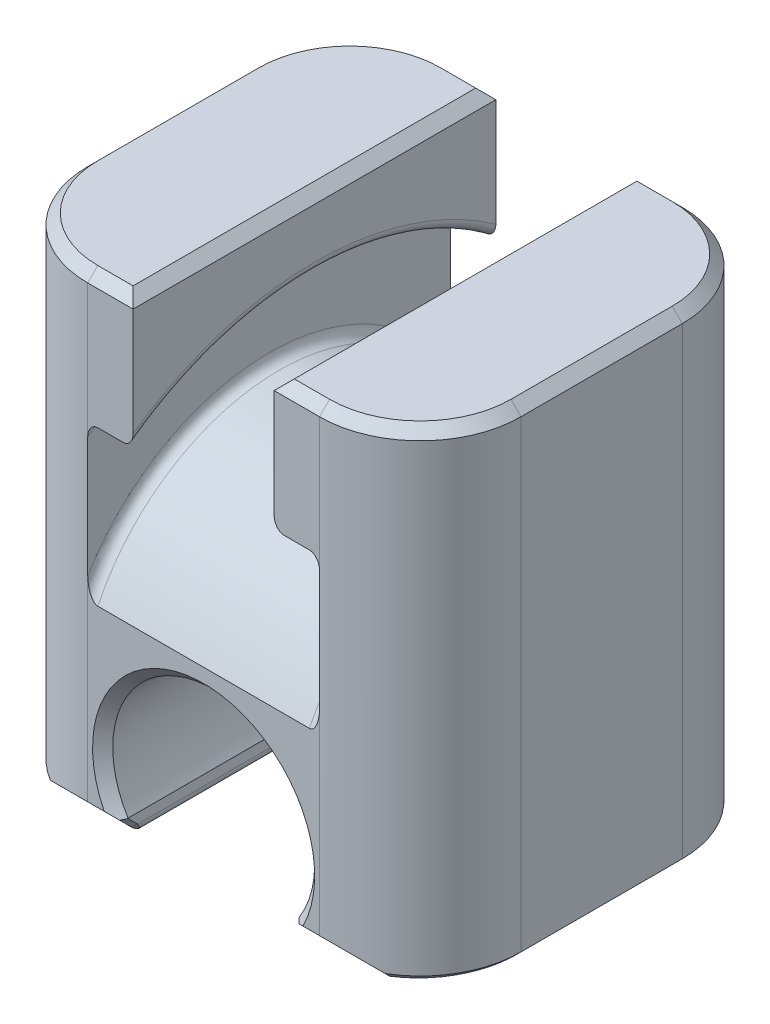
ISO-10303-21;
HEADER;
FILE_DESCRIPTION(('STEP AP214'),'2;1');
FILE_NAME('part.step','',(''),(''),'','','');
FILE_SCHEMA(('AUTOMOTIVE_DESIGN { 1 0 10303 214 1 1 1 1 }'));
ENDSEC;
DATA;
#1=APPLICATION_CONTEXT('core data for automotive mechanical design processes');
#2=APPLICATION_PROTOCOL_DEFINITION('international standard','automotive_design',2000,#1);
#3=PRODUCT_CONTEXT('',#1,'mechanical');
#4=PRODUCT('Part','Part','',(#3));
#5=PRODUCT_RELATED_PRODUCT_CATEGORY('part','',(#4));
#6=PRODUCT_DEFINITION_FORMATION('','',#4);
#7=PRODUCT_DEFINITION_CONTEXT('part definition',#1,'design');
#8=PRODUCT_DEFINITION('design','',#6,#7);
#9=PRODUCT_DEFINITION_SHAPE('','',#8);
#10=(LENGTH_UNIT() NAMED_UNIT(*) SI_UNIT(.MILLI.,.METRE.));
#11=(NAMED_UNIT(*) PLANE_ANGLE_UNIT() SI_UNIT($,.RADIAN.));
#12=(NAMED_UNIT(*) SI_UNIT($,.STERADIAN.) SOLID_ANGLE_UNIT());
#13=UNCERTAINTY_MEASURE_WITH_UNIT(LENGTH_MEASURE(1.E-05),#10,'distance_accuracy_value','');
#14=(GEOMETRIC_REPRESENTATION_CONTEXT(3) GLOBAL_UNCERTAINTY_ASSIGNED_CONTEXT((#13)) GLOBAL_UNIT_ASSIGNED_CONTEXT((#10,
#11,#12)) REPRESENTATION_CONTEXT('',''));
#15=CARTESIAN_POINT('',(0.,0.,0.));
#16=DIRECTION('',(0.,0.,1.));
#17=DIRECTION('',(1.,0.,0.));
#18=AXIS2_PLACEMENT_3D('',#15,#16,#17);
#19=CARTESIAN_POINT('',(0.,0.,0.));
#20=DIRECTION('',(1.,0.,0.));
#21=DIRECTION('',(0.,0.,-1.));
#22=AXIS2_PLACEMENT_3D('',#19,#20,#21);
#23=CYLINDRICAL_SURFACE('',#22,10.);
#24=DIRECTION('',(1.,0.,0.));
#25=VECTOR('',#24,1.);
#26=CARTESIAN_POINT('',(0.,4.35889894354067,9.));
#27=LINE('',#26,#25);
#28=CARTESIAN_POINT('',(5.25,4.35889894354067,9.));
#29=VERTEX_POINT('',#28);
#30=CARTESIAN_POINT('',(-5.25,4.35889894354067,9.));
#31=VERTEX_POINT('',#30);
#32=EDGE_CURVE('E499',#29,#31,#27,.F.);
#33=ORIENTED_EDGE('',*,*,#32,.F.);
#34=CARTESIAN_POINT('',(5.25,0.,0.));
#35=DIRECTION('',(1.,0.,0.));
#36=DIRECTION('',(0.,0.,-1.));
#37=AXIS2_PLACEMENT_3D('',#34,#35,#36);
#38=CIRCLE('',#37,10.);
#39=CARTESIAN_POINT('',(5.25,4.35889894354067,-9.));
#40=VERTEX_POINT('',#39);
#41=EDGE_CURVE('E559',#29,#40,#38,.F.);
#42=ORIENTED_EDGE('',*,*,#41,.T.);
#43=DIRECTION('',(1.,0.,0.));
#44=VECTOR('',#43,1.);
#45=CARTESIAN_POINT('',(0.,4.35889894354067,-9.));
#46=LINE('',#45,#44);
#47=CARTESIAN_POINT('',(-5.25,4.35889894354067,-9.));
#48=VERTEX_POINT('',#47);
#49=EDGE_CURVE('E512',#48,#40,#46,.T.);
#50=ORIENTED_EDGE('',*,*,#49,.F.);
#51=CARTESIAN_POINT('',(-5.25,0.,0.));
#52=DIRECTION('',(-1.,0.,0.));
#53=DIRECTION('',(0.,0.,1.));
#54=AXIS2_PLACEMENT_3D('',#51,#52,#53);
#55=CIRCLE('',#54,10.);
#56=EDGE_CURVE('E556',#48,#31,#55,.F.);
#57=ORIENTED_EDGE('',*,*,#56,.T.);
#58=EDGE_LOOP('',(#33,#42,#50,#57));
#59=FACE_BOUND('',#58,.T.);
#60=CARTESIAN_POINT('',(0.7874,9.96194698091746,0.871557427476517));
#61=CARTESIAN_POINT('',(0.787398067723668,9.96579495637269,0.827570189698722));
#62=CARTESIAN_POINT('',(0.783673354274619,9.96935193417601,0.783527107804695));
#63=CARTESIAN_POINT('',(0.768869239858,9.9758027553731,0.69660951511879));
#64=CARTESIAN_POINT('',(0.757781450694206,9.97869583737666,0.653736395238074));
#65=CARTESIAN_POINT('',(0.728573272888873,9.98380398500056,0.570437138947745));
#66=CARTESIAN_POINT('',(0.710456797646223,9.9860194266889,0.530009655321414));
#67=CARTESIAN_POINT('',(0.667712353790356,9.98982112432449,0.452738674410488));
#68=CARTESIAN_POINT('',(0.643085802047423,9.99140751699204,0.415894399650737));
#69=CARTESIAN_POINT('',(0.587959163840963,9.9940464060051,0.346753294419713));
#70=CARTESIAN_POINT('',(0.557447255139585,9.99509781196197,0.314465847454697));
#71=CARTESIAN_POINT('',(0.491440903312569,9.99678047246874,0.255448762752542));
#72=CARTESIAN_POINT('',(0.455946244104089,9.99741170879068,0.228719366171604));
#73=CARTESIAN_POINT('',(0.380925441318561,9.99837965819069,0.181558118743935));
#74=CARTESIAN_POINT('',(0.341394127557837,9.99871598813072,0.161134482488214));
#75=CARTESIAN_POINT('',(0.259458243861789,9.99920508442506,0.12722775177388));
#76=CARTESIAN_POINT('',(0.217053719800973,9.99935785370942,0.113744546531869));
#77=CARTESIAN_POINT('',(0.130669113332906,9.99956175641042,0.094136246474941));
#78=CARTESIAN_POINT('',(0.0866925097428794,9.99961310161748,0.0879958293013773));
#79=CARTESIAN_POINT('',(-0.00166646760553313,9.99965415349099,0.0832036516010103));
#80=CARTESIAN_POINT('',(-0.046048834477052,9.99964386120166,0.0845517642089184));
#81=CARTESIAN_POINT('',(-0.133854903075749,9.9995529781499,0.0946849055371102));
#82=CARTESIAN_POINT('',(-0.177280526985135,9.99947254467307,0.103453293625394));
#83=CARTESIAN_POINT('',(-0.262046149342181,9.99918644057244,0.128147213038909));
#84=CARTESIAN_POINT('',(-0.303386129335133,9.99898076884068,0.144072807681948));
#85=CARTESIAN_POINT('',(-0.382859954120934,9.99835053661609,0.182639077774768));
#86=CARTESIAN_POINT('',(-0.420990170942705,9.99792573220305,0.205287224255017));
#87=CARTESIAN_POINT('',(-0.492922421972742,9.99673916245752,0.256638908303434));
#88=CARTESIAN_POINT('',(-0.526724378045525,9.99597739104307,0.285342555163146));
#89=CARTESIAN_POINT('',(-0.589137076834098,9.99398977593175,0.348070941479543));
#90=CARTESIAN_POINT('',(-0.617733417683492,9.99276267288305,0.382109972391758));
#91=CARTESIAN_POINT('',(-0.66881185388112,9.98973260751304,0.454479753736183));
#92=CARTESIAN_POINT('',(-0.691293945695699,9.98792964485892,0.492810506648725));
#93=CARTESIAN_POINT('',(-0.729504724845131,9.98366878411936,0.572673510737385));
#94=CARTESIAN_POINT('',(-0.745232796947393,9.9812108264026,0.614206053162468));
#95=CARTESIAN_POINT('',(-0.769479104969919,9.97561136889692,0.699280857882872));
#96=CARTESIAN_POINT('',(-0.777997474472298,9.97246988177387,0.742823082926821));
#97=CARTESIAN_POINT('',(-0.787564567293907,9.96554635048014,0.830551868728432));
#98=CARTESIAN_POINT('',(-0.788633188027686,9.96176604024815,0.874736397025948));
#99=CARTESIAN_POINT('',(-0.783322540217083,9.95365959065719,0.962604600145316));
#100=CARTESIAN_POINT('',(-0.776943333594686,9.94933345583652,1.00628827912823));
#101=CARTESIAN_POINT('',(-0.756934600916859,9.9403061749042,1.0918621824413));
#102=CARTESIAN_POINT('',(-0.743314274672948,9.93560551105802,1.13375460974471));
#103=CARTESIAN_POINT('',(-0.709219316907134,9.92604311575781,1.21463075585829));
#104=CARTESIAN_POINT('',(-0.688744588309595,9.92118138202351,1.25361443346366));
#105=CARTESIAN_POINT('',(-0.641471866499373,9.91154374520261,1.32766703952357));
#106=CARTESIAN_POINT('',(-0.61466066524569,9.90676804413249,1.36272756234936));
#107=CARTESIAN_POINT('',(-0.555495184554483,9.89758962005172,1.42786691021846));
#108=CARTESIAN_POINT('',(-0.523140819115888,9.89318690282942,1.4579456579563));
#109=CARTESIAN_POINT('',(-0.453721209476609,9.88501715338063,1.51234798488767));
#110=CARTESIAN_POINT('',(-0.416645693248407,9.88125155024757,1.53665867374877));
#111=CARTESIAN_POINT('',(-0.338887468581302,9.87461275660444,1.57875871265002));
#112=CARTESIAN_POINT('',(-0.298204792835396,9.87173955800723,1.5965481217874));
#113=CARTESIAN_POINT('',(-0.214433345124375,9.86708153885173,1.62508837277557));
#114=CARTESIAN_POINT('',(-0.171347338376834,9.86529549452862,1.63584712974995));
#115=CARTESIAN_POINT('',(-0.0839542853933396,9.86292952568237,1.65005267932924));
#116=CARTESIAN_POINT('',(-0.0396472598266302,9.86234958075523,1.65349959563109));
#117=CARTESIAN_POINT('',(0.0488012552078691,9.86243594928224,1.65298430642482));
#118=CARTESIAN_POINT('',(0.0929428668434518,9.86309887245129,1.64904225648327));
#119=CARTESIAN_POINT('',(0.179927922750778,9.8656184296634,1.63390057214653));
#120=CARTESIAN_POINT('',(0.222771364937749,9.86747506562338,1.62270092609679));
#121=CARTESIAN_POINT('',(0.30594563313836,9.87225514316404,1.5933605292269));
#122=CARTESIAN_POINT('',(0.346276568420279,9.87517853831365,1.57522008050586));
#123=CARTESIAN_POINT('',(0.423292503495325,9.88189718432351,1.53250559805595));
#124=CARTESIAN_POINT('',(0.459977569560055,9.88569241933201,1.50793168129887));
#125=CARTESIAN_POINT('',(0.528764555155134,9.89392132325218,1.45296010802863));
#126=CARTESIAN_POINT('',(0.56085433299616,9.89835662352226,1.42254750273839));
#127=CARTESIAN_POINT('',(0.619440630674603,9.90758612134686,1.35677471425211));
#128=CARTESIAN_POINT('',(0.645935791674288,9.91238040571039,1.32141333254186));
#129=CARTESIAN_POINT('',(0.692612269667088,9.92205762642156,1.2466731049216));
#130=CARTESIAN_POINT('',(0.71278273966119,9.92694070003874,1.20728750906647));
#131=CARTESIAN_POINT('',(0.746152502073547,9.93652457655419,1.12568210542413));
#132=CARTESIAN_POINT('',(0.75935984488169,9.94122558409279,1.08346563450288));
#133=CARTESIAN_POINT('',(0.775047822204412,9.94862305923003,1.01275800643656));
#134=CARTESIAN_POINT('',(0.779673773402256,9.95143689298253,0.984736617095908));
#135=CARTESIAN_POINT('',(0.785850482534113,9.95685658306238,0.928337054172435));
#136=CARTESIAN_POINT('',(0.787401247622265,9.95946243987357,0.899958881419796));
#137=CARTESIAN_POINT('',(0.7874,9.96194698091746,0.871557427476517));
#138=B_SPLINE_CURVE_WITH_KNOTS('',3,(#60,#61,#62,#63,#64,#65,#66,#67,#68,#69,#70,#71,#72,#73,
#74,#75,#76,#77,#78,#79,#80,#81,#82,#83,#84,#85,#86,#87,#88,#89,#90,#91,#92,#93,#94,#95,#96,#97,
#98,#99,#100,#101,#102,#103,#104,#105,#106,#107,#108,#109,#110,#111,#112,#113,#114,#115,#116,
#117,#118,#119,#120,#121,#122,#123,#124,#125,#126,#127,#128,#129,#130,#131,#132,#133,#134,#135,
#136,#137),.UNSPECIFIED.,.T.,.F.,(4,2,2,2,2,2,2,2,2,2,2,2,2,2,2,2,2,2,2,2,2,2,2,2,2,2,2,2,2,2,2,
2,2,2,2,2,2,2,4),(0.,0.132361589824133,0.264874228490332,0.397313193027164,0.529723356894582,
0.662402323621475,0.79508704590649,0.927943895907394,1.06079862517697,1.19337563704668,
1.3259504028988,1.45822864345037,1.59050805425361,1.72293502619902,1.85536438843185,
1.98815473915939,2.12094516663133,2.25374768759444,2.38654774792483,2.51899297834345,
2.65143710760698,2.78371336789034,2.91599150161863,3.04854783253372,3.18110622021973,
3.31395811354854,3.4468088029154,3.57950966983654,3.71220829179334,3.84454546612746,
3.97688285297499,4.10921448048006,4.24154370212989,4.37421635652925,4.50692119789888,
4.63985240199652,4.77262957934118,4.8580923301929,4.9435548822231),.UNSPECIFIED.);
#139=CARTESIAN_POINT('',(0.655540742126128,9.91444861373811,1.30526192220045));
#140=VERTEX_POINT('',#139);
#141=CARTESIAN_POINT('',(-0.655540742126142,9.91444861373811,1.30526192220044));
#142=VERTEX_POINT('',#141);
#143=EDGE_CURVE('E45',#140,#142,#138,.T.);
#144=ORIENTED_EDGE('',*,*,#143,.F.);
#145=CARTESIAN_POINT('',(0.7874,9.8480775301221,1.73648177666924));
#146=CARTESIAN_POINT('',(0.787398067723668,9.85574460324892,1.69299729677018));
#147=CARTESIAN_POINT('',(0.783673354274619,9.86312665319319,1.64943182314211));
#148=CARTESIAN_POINT('',(0.768869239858,9.87712829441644,1.56340720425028));
#149=CARTESIAN_POINT('',(0.757781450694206,9.88374700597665,1.52094937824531));
#150=CARTESIAN_POINT('',(0.728573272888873,9.89609572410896,1.43841230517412));
#151=CARTESIAN_POINT('',(0.710456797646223,9.90182622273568,1.39833174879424));
#152=CARTESIAN_POINT('',(0.667712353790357,9.91234806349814,1.32168614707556));
#153=CARTESIAN_POINT('',(0.643085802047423,9.91713960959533,1.28512033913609));
#154=CARTESIAN_POINT('',(0.587959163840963,9.92579450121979,1.2164723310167));
#155=CARTESIAN_POINT('',(0.557447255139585,9.92965594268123,1.18439938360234));
#156=CARTESIAN_POINT('',(0.491440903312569,9.93647587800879,1.12575353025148));
#157=CARTESIAN_POINT('',(0.455946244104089,9.93943433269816,1.09918086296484));
#158=CARTESIAN_POINT('',(0.380925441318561,9.94450897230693,1.05228344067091));
#159=CARTESIAN_POINT('',(0.341394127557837,9.94662405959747,1.03196683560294));
#160=CARTESIAN_POINT('',(0.259458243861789,9.9500664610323,0.998231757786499));
#161=CARTESIAN_POINT('',(0.217053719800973,9.9513937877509,0.984813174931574));
#162=CARTESIAN_POINT('',(0.130669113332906,9.95330589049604,0.965297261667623));
#163=CARTESIAN_POINT('',(0.0866925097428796,9.95389221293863,0.959184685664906));
#164=CARTESIAN_POINT('',(-0.0016664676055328,9.95435077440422,0.954414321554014));
#165=CARTESIAN_POINT('',(-0.0460488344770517,9.95422302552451,0.955756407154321));
#166=CARTESIAN_POINT('',(-0.133854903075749,9.95324932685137,0.9658430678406));
#167=CARTESIAN_POINT('',(-0.177280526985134,9.95240498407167,0.974571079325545));
#168=CARTESIAN_POINT('',(-0.26204614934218,9.94996775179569,0.999146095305));
#169=CARTESIAN_POINT('',(-0.303386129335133,9.94837485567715,1.01499316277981));
#170=CARTESIAN_POINT('',(-0.382859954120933,9.9443857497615,1.05335774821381));
#171=CARTESIAN_POINT('',(-0.420990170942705,9.94198864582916,1.0758826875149));
#172=CARTESIAN_POINT('',(-0.492922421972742,9.93633099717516,1.12693554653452));
#173=CARTESIAN_POINT('',(-0.526724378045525,9.93307043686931,1.15546357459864));
#174=CARTESIAN_POINT('',(-0.589137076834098,9.9256232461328,1.21778002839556));
#175=CARTESIAN_POINT('',(-0.617733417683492,9.92143411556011,1.25158258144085));
#176=CARTESIAN_POINT('',(-0.66881185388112,9.91210813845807,1.32341288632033));
#177=CARTESIAN_POINT('',(-0.691293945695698,9.906971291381,1.3614406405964));
#178=CARTESIAN_POINT('',(-0.72950472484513,9.89576612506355,1.4406283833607));
#179=CARTESIAN_POINT('',(-0.745232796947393,9.88969772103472,1.48178865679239));
#180=CARTESIAN_POINT('',(-0.769479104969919,9.87670481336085,1.56605170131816));
#181=CARTESIAN_POINT('',(-0.777997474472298,9.86978032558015,1.60915443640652));
#182=CARTESIAN_POINT('',(-0.787564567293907,9.85523707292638,1.69594596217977));
#183=CARTESIAN_POINT('',(-0.788633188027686,9.8476202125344,1.73963287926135));
#184=CARTESIAN_POINT('',(-0.783322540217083,9.83188639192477,1.82646019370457));
#185=CARTESIAN_POINT('',(-0.776943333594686,9.82376943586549,1.86960059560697));
#186=CARTESIAN_POINT('',(-0.75693460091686,9.80731824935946,1.95406208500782));
#187=CARTESIAN_POINT('',(-0.743314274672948,9.79898430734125,1.99538540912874));
#188=CARTESIAN_POINT('',(-0.709219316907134,9.78240947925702,2.07512037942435));
#189=CARTESIAN_POINT('',(-0.688744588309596,9.77416859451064,2.11353198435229));
#190=CARTESIAN_POINT('',(-0.641471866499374,9.75811352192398,2.18646282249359));
#191=CARTESIAN_POINT('',(-0.614660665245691,9.75030026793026,2.22097369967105));
#192=CARTESIAN_POINT('',(-0.555495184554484,9.73547950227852,2.28506522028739));
#193=CARTESIAN_POINT('',(-0.523140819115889,9.72847200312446,2.31464578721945));
#194=CARTESIAN_POINT('',(-0.45372120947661,9.71559186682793,2.36812905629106));
#195=CARTESIAN_POINT('',(-0.416645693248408,9.70972177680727,2.3920190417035));
#196=CARTESIAN_POINT('',(-0.338887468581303,9.69943898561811,2.43338026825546));
#197=CARTESIAN_POINT('',(-0.298204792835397,9.6950262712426,2.4508515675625));
#198=CARTESIAN_POINT('',(-0.214433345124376,9.68789853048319,2.47887724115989));
#199=CARTESIAN_POINT('',(-0.171347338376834,9.68518159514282,2.48943939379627));
#200=CARTESIAN_POINT('',(-0.0839542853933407,9.68158653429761,2.50338467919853));
#201=CARTESIAN_POINT('',(-0.0396472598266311,9.68070837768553,2.50676793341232));
#202=CARTESIAN_POINT('',(0.0488012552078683,9.68083932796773,2.50626213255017));
#203=CARTESIAN_POINT('',(0.092942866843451,9.68184330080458,2.50239286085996));
#204=CARTESIAN_POINT('',(0.179927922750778,9.68567295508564,2.48752838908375));
#205=CARTESIAN_POINT('',(0.222771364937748,9.68849863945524,2.47653317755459));
#206=CARTESIAN_POINT('',(0.30594563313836,9.69581771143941,2.44772104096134));
#207=CARTESIAN_POINT('',(0.346276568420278,9.70031102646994,2.42990441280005));
#208=CARTESIAN_POINT('',(0.423292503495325,9.71072691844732,2.38793804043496));
#209=CARTESIAN_POINT('',(0.459977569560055,9.71664946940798,2.36378841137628));
#210=CARTESIAN_POINT('',(0.528764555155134,9.72963814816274,2.30974321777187));
#211=CARTESIAN_POINT('',(0.56085433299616,9.7367072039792,2.27983290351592));
#212=CARTESIAN_POINT('',(0.619440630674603,9.75163405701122,2.21511480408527));
#213=CARTESIAN_POINT('',(0.645935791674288,9.75949204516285,2.18030583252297));
#214=CARTESIAN_POINT('',(0.692612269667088,9.77564648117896,2.10669343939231));
#215=CARTESIAN_POINT('',(0.71278273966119,9.78394365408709,2.06788330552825));
#216=CARTESIAN_POINT('',(0.746152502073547,9.80060344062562,1.98742372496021));
#217=CARTESIAN_POINT('',(0.75935984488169,9.8089659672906,1.94577762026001));
#218=CARTESIAN_POINT('',(0.775047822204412,9.82249786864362,1.87598378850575));
#219=CARTESIAN_POINT('',(0.779673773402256,9.82774321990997,1.84831427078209));
#220=CARTESIAN_POINT('',(0.785850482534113,9.83805783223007,1.7926016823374));
#221=CARTESIAN_POINT('',(0.787401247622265,9.84312709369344,1.76455861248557));
#222=CARTESIAN_POINT('',(0.7874,9.8480775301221,1.73648177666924));
#223=B_SPLINE_CURVE_WITH_KNOTS('',3,(#145,#146,#147,#148,#149,#150,#151,#152,#153,#154,#155,
#156,#157,#158,#159,#160,#161,#162,#163,#164,#165,#166,#167,#168,#169,#170,#171,#172,#173,#174,
#175,#176,#177,#178,#179,#180,#181,#182,#183,#184,#185,#186,#187,#188,#189,#190,#191,#192,#193,
#194,#195,#196,#197,#198,#199,#200,#201,#202,#203,#204,#205,#206,#207,#208,#209,#210,#211,#212,
#213,#214,#215,#216,#217,#218,#219,#220,#221,#222),.UNSPECIFIED.,.T.,.F.,(4,2,2,2,2,2,2,2,2,2,2,
2,2,2,2,2,2,2,2,2,2,2,2,2,2,2,2,2,2,2,2,2,2,2,2,2,2,2,4),(0.,0.132361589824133,
0.264874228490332,0.397313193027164,0.529723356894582,0.662402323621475,0.79508704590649,
0.927943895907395,1.06079862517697,1.19337563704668,1.3259504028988,1.45822864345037,
1.59050805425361,1.72293502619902,1.85536438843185,1.98815473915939,2.12094516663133,
2.25374768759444,2.38654774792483,2.51899297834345,2.65143710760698,2.78371336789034,
2.91599150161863,3.04854783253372,3.18110622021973,3.31395811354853,3.4468088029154,
3.57950966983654,3.71220829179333,3.84454546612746,3.97688285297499,4.10921448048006,
4.24154370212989,4.37421635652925,4.50692119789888,4.63985240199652,4.77262957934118,
4.8580923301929,4.94355488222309),.UNSPECIFIED.);
#224=EDGE_CURVE('E406',#142,#140,#223,.T.);
#225=ORIENTED_EDGE('',*,*,#224,.F.);
#226=EDGE_LOOP('',(#144,#225));
#227=FACE_BOUND('',#226,.T.);
#228=ADVANCED_FACE('F37',(#59,#227),#23,.T.);
#229=CARTESIAN_POINT('',(0.,0.,0.));
#230=DIRECTION('',(0.,-0.996194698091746,-0.0871557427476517));
#231=DIRECTION('',(0.,0.0871557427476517,-0.996194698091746));
#232=AXIS2_PLACEMENT_3D('',#229,#230,#231);
#233=CYLINDRICAL_SURFACE('',#232,0.7874);
#234=CARTESIAN_POINT('',(0.,9.46384963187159,0.827979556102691));
#235=DIRECTION('',(0.,-0.996194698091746,-0.0871557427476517));
#236=DIRECTION('',(0.,0.0871557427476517,-0.996194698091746));
#237=AXIS2_PLACEMENT_3D('',#234,#235,#236);
#238=CIRCLE('',#237,0.7874);
#239=CARTESIAN_POINT('',(-0.669296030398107,9.42769926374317,1.24118015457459));
#240=VERTEX_POINT('',#239);
#241=CARTESIAN_POINT('',(0.669296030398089,9.42769926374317,1.24118015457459));
#242=VERTEX_POINT('',#241);
#243=EDGE_CURVE('E404',#240,#242,#238,.T.);
#244=ORIENTED_EDGE('',*,*,#243,.T.);
#245=CARTESIAN_POINT('',(0.,0.,0.));
#246=DIRECTION('',(0.,-0.130526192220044,0.991444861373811));
#247=DIRECTION('',(0.,-0.991444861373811,-0.130526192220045));
#248=AXIS2_PLACEMENT_3D('',#245,#246,#247);
#249=ELLIPSE('',#248,18.0516061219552,0.7874);
#250=EDGE_CURVE('E399',#242,#140,#249,.T.);
#251=ORIENTED_EDGE('',*,*,#250,.T.);
#252=ORIENTED_EDGE('',*,*,#143,.T.);
#253=EDGE_CURVE('E396',#142,#240,#249,.T.);
#254=ORIENTED_EDGE('',*,*,#253,.T.);
#255=EDGE_LOOP('',(#244,#251,#252,#254));
#256=FACE_BOUND('',#255,.T.);
#257=ADVANCED_FACE('F403',(#256),#233,.F.);
#258=CARTESIAN_POINT('',(0.,9.39522320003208,1.61238326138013));
#259=DIRECTION('',(0.,0.996194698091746,0.0871557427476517));
#260=DIRECTION('',(0.,-0.0871557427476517,0.996194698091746));
#261=AXIS2_PLACEMENT_3D('',#258,#259,#260);
#262=PLANE('',#261);
#263=ORIENTED_EDGE('',*,*,#243,.F.);
#264=DIRECTION('',(1.,0.,0.));
#265=VECTOR('',#264,1.);
#266=CARTESIAN_POINT('',(0.,9.42769926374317,1.24118015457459));
#267=LINE('',#266,#265);
#268=EDGE_CURVE('E11',#240,#242,#267,.T.);
#269=ORIENTED_EDGE('',*,*,#268,.T.);
#270=EDGE_LOOP('',(#263,#269));
#271=FACE_BOUND('',#270,.T.);
#272=ADVANCED_FACE('F408',(#271),#262,.T.);
#273=CARTESIAN_POINT('',(10.75,-5.5,9.));
#274=DIRECTION('',(0.,1.,0.));
#275=DIRECTION('',(0.,0.,1.));
#276=AXIS2_PLACEMENT_3D('',#273,#274,#275);
#277=PLANE('',#276);
#278=DIRECTION('',(0.,0.,-1.));
#279=VECTOR('',#278,1.);
#280=CARTESIAN_POINT('',(-4.95,-5.5,9.));
#281=LINE('',#280,#279);
#282=CARTESIAN_POINT('',(-4.95,-5.5,7.71715728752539));
#283=VERTEX_POINT('',#282);
#284=CARTESIAN_POINT('',(-4.95,-5.5,-7.71715728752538));
#285=VERTEX_POINT('',#284);
#286=EDGE_CURVE('E421',#283,#285,#281,.T.);
#287=ORIENTED_EDGE('',*,*,#286,.T.);
#288=DIRECTION('',(1.,0.,0.));
#289=VECTOR('',#288,1.);
#290=CARTESIAN_POINT('',(10.75,-5.5,-7.71715728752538));
#291=LINE('',#290,#289);
#292=CARTESIAN_POINT('',(-4.75,-5.5,-7.71715728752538));
#293=VERTEX_POINT('',#292);
#294=EDGE_CURVE('E1063',#285,#293,#291,.T.);
#295=ORIENTED_EDGE('',*,*,#294,.T.);
#296=DIRECTION('',(0.,0.,-1.));
#297=VECTOR('',#296,1.);
#298=CARTESIAN_POINT('',(-4.75,-5.5,9.));
#299=LINE('',#298,#297);
#300=CARTESIAN_POINT('',(-4.75,-5.5,7.71715728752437));
#301=VERTEX_POINT('',#300);
#302=EDGE_CURVE('E1079',#293,#301,#299,.F.);
#303=ORIENTED_EDGE('',*,*,#302,.T.);
#304=DIRECTION('',(-1.,0.,0.));
#305=VECTOR('',#304,1.);
#306=CARTESIAN_POINT('',(-8.99961536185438,-5.5,7.71715728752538));
#307=LINE('',#306,#305);
#308=EDGE_CURVE('E1067',#301,#283,#307,.T.);
#309=ORIENTED_EDGE('',*,*,#308,.T.);
#310=EDGE_LOOP('',(#287,#295,#303,#309));
#311=FACE_BOUND('',#310,.T.);
#312=ADVANCED_FACE('F637',(#311),#277,.F.);
#313=CARTESIAN_POINT('',(10.75,-5.5,-7.8));
#314=DIRECTION('',(0.,0.707106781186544,0.707106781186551));
#315=DIRECTION('',(0.,-0.707106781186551,0.707106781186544));
#316=AXIS2_PLACEMENT_3D('',#313,#314,#315);
#317=PLANE('',#316);
#318=DIRECTION('',(0.997264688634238,-0.0522644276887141,0.0522644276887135));
#319=VECTOR('',#318,1.);
#320=CARTESIAN_POINT('',(10.6642286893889,-6.31830705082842,-6.98169294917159));
#321=LINE('',#320,#319);
#322=CARTESIAN_POINT('',(-8.20950251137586,-5.32917671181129,-7.97082328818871));
#323=VERTEX_POINT('',#322);
#324=CARTESIAN_POINT('',(-6.06774710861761,-5.44142135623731,-7.85857864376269));
#325=VERTEX_POINT('',#324);
#326=EDGE_CURVE('E434',#323,#325,#321,.T.);
#327=ORIENTED_EDGE('',*,*,#326,.F.);
#328=CARTESIAN_POINT('',(-8.17734630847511,-5.44142135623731,-7.85857864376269));
#329=CARTESIAN_POINT('',(-8.19852968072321,-5.36792085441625,-7.93207914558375));
#330=CARTESIAN_POINT('',(-8.21946502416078,-5.2943854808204,-8.0056145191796));
#331=CARTESIAN_POINT('',(-8.26083964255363,-5.14724502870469,-8.1527549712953));
#332=CARTESIAN_POINT('',(-8.28127891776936,-5.07363995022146,-8.22636004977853));
#333=CARTESIAN_POINT('',(-8.30147016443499,-5.00000000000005,-8.29999999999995));
#334=B_SPLINE_CURVE_WITH_KNOTS('',3,(#328,#329,#330,#331,#332,#333),.UNSPECIFIED.,.F.,.F.,(4,2,
4),(0.,0.318243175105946,0.636486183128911),.UNSPECIFIED.);
#335=CARTESIAN_POINT('',(-8.30147016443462,-4.99999999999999,-8.3));
#336=VERTEX_POINT('',#335);
#337=EDGE_CURVE('E910',#323,#336,#334,.T.);
#338=ORIENTED_EDGE('',*,*,#337,.T.);
#339=CARTESIAN_POINT('',(-5.75,-9.30000000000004,-4.));
#340=DIRECTION('',(0.,0.707106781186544,0.707106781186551));
#341=DIRECTION('',(0.,-0.707106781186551,0.707106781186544));
#342=AXIS2_PLACEMENT_3D('',#339,#340,#341);
#343=ELLIPSE('',#342,7.07106781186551,5.);
#344=CARTESIAN_POINT('',(-5.75,-4.29999999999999,-9.));
#345=VERTEX_POINT('',#344);
#346=EDGE_CURVE('E472',#336,#345,#343,.F.);
#347=ORIENTED_EDGE('',*,*,#346,.T.);
#348=DIRECTION('',(-1.,0.,0.));
#349=VECTOR('',#348,1.);
#350=CARTESIAN_POINT('',(10.75,-4.29999999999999,-9.));
#351=LINE('',#350,#349);
#352=CARTESIAN_POINT('',(-4.93414979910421,-4.29999999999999,-9.));
#353=VERTEX_POINT('',#352);
#354=EDGE_CURVE('E468',#353,#345,#351,.T.);
#355=ORIENTED_EDGE('',*,*,#354,.F.);
#356=CARTESIAN_POINT('',(-4.93414979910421,-4.29999999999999,-9.));
#357=CARTESIAN_POINT('',(-4.87879920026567,-4.33429932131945,-8.96570067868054));
#358=CARTESIAN_POINT('',(-4.82304382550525,-4.368273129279,-8.93172687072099));
#359=CARTESIAN_POINT('',(-4.71072269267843,-4.43551696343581,-8.86448303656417));
#360=CARTESIAN_POINT('',(-4.65415721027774,-4.468787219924,-8.83121278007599));
#361=CARTESIAN_POINT('',(-4.54017640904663,-4.53459512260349,-8.7654048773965));
#362=CARTESIAN_POINT('',(-4.48276106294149,-4.56713274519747,-8.73286725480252));
#363=CARTESIAN_POINT('',(-4.36704485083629,-4.631439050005,-8.66856094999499));
#364=CARTESIAN_POINT('',(-4.30874369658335,-4.66320747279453,-8.63679252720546));
#365=CARTESIAN_POINT('',(-4.25,-4.69456283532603,-8.60543716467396));
#366=B_SPLINE_CURVE_WITH_KNOTS('',3,(#356,#357,#358,#359,#360,#361,#362,#363,#364,#365),
.UNSPECIFIED.,.F.,.F.,(4,2,2,2,4),(0.,0.220791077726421,0.441508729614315,0.662233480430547,
0.883031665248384),.UNSPECIFIED.);
#367=CARTESIAN_POINT('',(-4.45,-4.58529929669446,-8.71470070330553));
#368=VERTEX_POINT('',#367);
#369=EDGE_CURVE('E1673',#353,#368,#366,.T.);
#370=ORIENTED_EDGE('',*,*,#369,.T.);
#371=DIRECTION('',(0.,-0.707106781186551,0.707106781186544));
#372=VECTOR('',#371,1.);
#373=CARTESIAN_POINT('',(-4.45,-5.50000000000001,-7.79999999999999));
#374=LINE('',#373,#372);
#375=CARTESIAN_POINT('',(-4.45,-5.1414213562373,-8.1585786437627));
#376=VERTEX_POINT('',#375);
#377=EDGE_CURVE('E1108',#368,#376,#374,.T.);
#378=ORIENTED_EDGE('',*,*,#377,.T.);
#379=CARTESIAN_POINT('',(-4.75,-5.44142135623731,-7.85857864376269));
#380=CARTESIAN_POINT('',(-4.7303649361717,-5.44142267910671,-7.85857732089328));
#381=CARTESIAN_POINT('',(-4.71073068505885,-5.43948755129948,-7.86051244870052));
#382=CARTESIAN_POINT('',(-4.67221512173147,-5.43182632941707,-7.86817367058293));
#383=CARTESIAN_POINT('',(-4.65333540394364,-5.42609922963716,-7.87390077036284));
#384=CARTESIAN_POINT('',(-4.61705453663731,-5.41107120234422,-7.88892879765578));
#385=CARTESIAN_POINT('',(-4.59965488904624,-5.40177089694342,-7.89822910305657));
#386=CARTESIAN_POINT('',(-4.567002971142,-5.37995358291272,-7.92004641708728));
#387=CARTESIAN_POINT('',(-4.55175205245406,-5.3674374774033,-7.9325625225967));
#388=CARTESIAN_POINT('',(-4.523983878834,-5.33966930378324,-7.96033069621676));
#389=CARTESIAN_POINT('',(-4.51146777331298,-5.32441838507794,-7.97558161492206));
#390=CARTESIAN_POINT('',(-4.48965045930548,-5.29176646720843,-8.00823353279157));
#391=CARTESIAN_POINT('',(-4.48035015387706,-5.27436681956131,-8.02563318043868));
#392=CARTESIAN_POINT('',(-4.46532212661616,-5.23808595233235,-8.06191404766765));
#393=CARTESIAN_POINT('',(-4.45959502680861,-5.21920623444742,-8.08079376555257));
#394=CARTESIAN_POINT('',(-4.45193380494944,-5.18069067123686,-8.11930932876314));
#395=CARTESIAN_POINT('',(-4.44999867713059,-5.1610564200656,-8.13894357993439));
#396=CARTESIAN_POINT('',(-4.45,-5.1414213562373,-8.1585786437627));
#397=B_SPLINE_CURVE_WITH_KNOTS('',3,(#379,#380,#381,#382,#383,#384,#385,#386,#387,#388,#389,
#390,#391,#392,#393,#394,#395,#396),.UNSPECIFIED.,.F.,.F.,(4,2,2,2,2,2,2,2,4),(3.14159265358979,
3.33794219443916,3.53429173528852,3.73064127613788,3.92699081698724,4.12334035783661,
4.31968989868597,4.51603943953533,4.7123889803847),.UNSPECIFIED.);
#398=CARTESIAN_POINT('',(-4.75,-5.44142135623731,-7.85857864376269));
#399=VERTEX_POINT('',#398);
#400=EDGE_CURVE('E1104',#376,#399,#397,.F.);
#401=ORIENTED_EDGE('',*,*,#400,.T.);
#402=DIRECTION('',(-1.,0.,0.));
#403=VECTOR('',#402,1.);
#404=CARTESIAN_POINT('',(10.75,-5.44142135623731,-7.85857864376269));
#405=LINE('',#404,#403);
#406=EDGE_CURVE('E1100',#399,#325,#405,.T.);
#407=ORIENTED_EDGE('',*,*,#406,.T.);
#408=EDGE_LOOP('',(#327,#338,#347,#355,#370,#378,#401,#407));
#409=FACE_BOUND('',#408,.T.);
#410=ADVANCED_FACE('F816',(#409),#317,.F.);
#411=CARTESIAN_POINT('',(10.75,-5.5,7.8));
#412=DIRECTION('',(0.,-0.707106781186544,0.707106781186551));
#413=DIRECTION('',(0.,-0.707106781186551,-0.707106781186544));
#414=AXIS2_PLACEMENT_3D('',#411,#412,#413);
#415=PLANE('',#414);
#416=CARTESIAN_POINT('',(-8.30147016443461,-4.99999999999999,8.3));
#417=CARTESIAN_POINT('',(-8.28127891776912,-5.07363995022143,8.22636004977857));
#418=CARTESIAN_POINT('',(-8.26083964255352,-5.14724502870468,8.15275497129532));
#419=CARTESIAN_POINT('',(-8.2194650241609,-5.29438548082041,8.00561451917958));
#420=CARTESIAN_POINT('',(-8.19852968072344,-5.36792085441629,7.93207914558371));
#421=CARTESIAN_POINT('',(-8.17734630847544,-5.44142135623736,7.85857864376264));
#422=B_SPLINE_CURVE_WITH_KNOTS('',3,(#416,#417,#418,#419,#420,#421),.UNSPECIFIED.,.F.,.F.,(4,2,
4),(0.,0.318243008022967,0.636486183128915),.UNSPECIFIED.);
#423=CARTESIAN_POINT('',(-8.30147016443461,-4.99999999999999,8.3));
#424=VERTEX_POINT('',#423);
#425=CARTESIAN_POINT('',(-8.20950251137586,-5.32917671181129,7.97082328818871));
#426=VERTEX_POINT('',#425);
#427=EDGE_CURVE('E903',#424,#426,#422,.T.);
#428=ORIENTED_EDGE('',*,*,#427,.T.);
#429=DIRECTION('',(0.997264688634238,-0.0522644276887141,-0.0522644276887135));
#430=VECTOR('',#429,1.);
#431=CARTESIAN_POINT('',(10.6642286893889,-6.31830705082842,6.98169294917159));
#432=LINE('',#431,#430);
#433=CARTESIAN_POINT('',(-6.06774710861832,-5.44142135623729,7.85857864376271));
#434=VERTEX_POINT('',#433);
#435=EDGE_CURVE('E431',#426,#434,#432,.T.);
#436=ORIENTED_EDGE('',*,*,#435,.T.);
#437=DIRECTION('',(1.,0.,0.));
#438=VECTOR('',#437,1.);
#439=CARTESIAN_POINT('',(-4.75,-5.44142135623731,7.85857864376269));
#440=LINE('',#439,#438);
#441=CARTESIAN_POINT('',(-4.75,-5.44142135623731,7.85857864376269));
#442=VERTEX_POINT('',#441);
#443=EDGE_CURVE('E864',#434,#442,#440,.T.);
#444=ORIENTED_EDGE('',*,*,#443,.T.);
#445=CARTESIAN_POINT('',(-4.45,-5.14142135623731,8.15857864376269));
#446=CARTESIAN_POINT('',(-4.44999867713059,-5.1610564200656,8.13894357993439));
#447=CARTESIAN_POINT('',(-4.45193380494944,-5.18069067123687,8.11930932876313));
#448=CARTESIAN_POINT('',(-4.45959502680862,-5.21920623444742,8.08079376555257));
#449=CARTESIAN_POINT('',(-4.46532212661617,-5.23808595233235,8.06191404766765));
#450=CARTESIAN_POINT('',(-4.48035015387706,-5.27436681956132,8.02563318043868));
#451=CARTESIAN_POINT('',(-4.48965045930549,-5.29176646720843,8.00823353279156));
#452=CARTESIAN_POINT('',(-4.51146777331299,-5.32441838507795,7.97558161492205));
#453=CARTESIAN_POINT('',(-4.523983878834,-5.33966930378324,7.96033069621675));
#454=CARTESIAN_POINT('',(-4.55175205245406,-5.3674374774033,7.9325625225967));
#455=CARTESIAN_POINT('',(-4.567002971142,-5.37995358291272,7.92004641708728));
#456=CARTESIAN_POINT('',(-4.59965488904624,-5.40177089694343,7.89822910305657));
#457=CARTESIAN_POINT('',(-4.61705453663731,-5.41107120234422,7.88892879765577));
#458=CARTESIAN_POINT('',(-4.65333540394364,-5.42609922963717,7.87390077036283));
#459=CARTESIAN_POINT('',(-4.67221512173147,-5.43182632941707,7.86817367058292));
#460=CARTESIAN_POINT('',(-4.71073068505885,-5.43948755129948,7.86051244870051));
#461=CARTESIAN_POINT('',(-4.7303649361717,-5.44142267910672,7.85857732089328));
#462=CARTESIAN_POINT('',(-4.75,-5.44142135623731,7.85857864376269));
#463=B_SPLINE_CURVE_WITH_KNOTS('',3,(#445,#446,#447,#448,#449,#450,#451,#452,#453,#454,#455,
#456,#457,#458,#459,#460,#461,#462),.UNSPECIFIED.,.F.,.F.,(4,2,2,2,2,2,2,2,4),(0.,
0.196349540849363,0.392699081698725,0.589048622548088,0.78539816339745,0.981747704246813,
1.17809724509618,1.37444678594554,1.5707963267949),.UNSPECIFIED.);
#464=CARTESIAN_POINT('',(-4.45,-5.14142135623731,8.15857864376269));
#465=VERTEX_POINT('',#464);
#466=EDGE_CURVE('E1324',#442,#465,#463,.F.);
#467=ORIENTED_EDGE('',*,*,#466,.T.);
#468=DIRECTION('',(0.,0.707106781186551,0.707106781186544));
#469=VECTOR('',#468,1.);
#470=CARTESIAN_POINT('',(-4.45,-4.69456283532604,8.60543716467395));
#471=LINE('',#470,#469);
#472=CARTESIAN_POINT('',(-4.45,-4.58529929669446,8.71470070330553));
#473=VERTEX_POINT('',#472);
#474=EDGE_CURVE('E1325',#465,#473,#471,.T.);
#475=ORIENTED_EDGE('',*,*,#474,.T.);
#476=CARTESIAN_POINT('',(-4.25,-4.69456283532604,8.60543716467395));
#477=CARTESIAN_POINT('',(-4.30874369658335,-4.66320747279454,8.63679252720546));
#478=CARTESIAN_POINT('',(-4.36704485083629,-4.631439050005,8.66856094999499));
#479=CARTESIAN_POINT('',(-4.48276106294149,-4.56713274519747,8.73286725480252));
#480=CARTESIAN_POINT('',(-4.54017640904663,-4.53459512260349,8.7654048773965));
#481=CARTESIAN_POINT('',(-4.65415721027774,-4.468787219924,8.83121278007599));
#482=CARTESIAN_POINT('',(-4.71072269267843,-4.43551696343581,8.86448303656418));
#483=CARTESIAN_POINT('',(-4.82304382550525,-4.36827312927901,8.93172687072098));
#484=CARTESIAN_POINT('',(-4.87879920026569,-4.33429932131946,8.96570067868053));
#485=CARTESIAN_POINT('',(-4.93414979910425,-4.30000000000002,8.99999999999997));
#486=B_SPLINE_CURVE_WITH_KNOTS('',3,(#476,#477,#478,#479,#480,#481,#482,#483,#484,#485),
.UNSPECIFIED.,.F.,.F.,(4,2,2,2,4),(0.,0.220798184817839,0.441522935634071,0.662240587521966,
0.883031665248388),.UNSPECIFIED.);
#487=CARTESIAN_POINT('',(-4.93414979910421,-4.29999999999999,9.));
#488=VERTEX_POINT('',#487);
#489=EDGE_CURVE('E836',#473,#488,#486,.T.);
#490=ORIENTED_EDGE('',*,*,#489,.T.);
#491=DIRECTION('',(-1.,0.,0.));
#492=VECTOR('',#491,1.);
#493=CARTESIAN_POINT('',(10.75,-4.29999999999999,9.));
#494=LINE('',#493,#492);
#495=CARTESIAN_POINT('',(-5.75,-4.29999999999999,9.));
#496=VERTEX_POINT('',#495);
#497=EDGE_CURVE('E458',#488,#496,#494,.T.);
#498=ORIENTED_EDGE('',*,*,#497,.T.);
#499=CARTESIAN_POINT('',(-5.75,-9.30000000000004,4.));
#500=DIRECTION('',(0.,-0.707106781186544,0.707106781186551));
#501=DIRECTION('',(0.,0.707106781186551,0.707106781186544));
#502=AXIS2_PLACEMENT_3D('',#499,#500,#501);
#503=ELLIPSE('',#502,7.07106781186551,5.);
#504=EDGE_CURVE('E463',#424,#496,#503,.F.);
#505=ORIENTED_EDGE('',*,*,#504,.F.);
#506=EDGE_LOOP('',(#428,#436,#444,#467,#475,#490,#498,#505));
#507=FACE_BOUND('',#506,.T.);
#508=ADVANCED_FACE('F811',(#507),#415,.T.);
#509=CARTESIAN_POINT('',(10.75,-5.44142135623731,-7.85857864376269));
#510=DIRECTION('',(0.,0.923879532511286,0.38268343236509));
#511=DIRECTION('',(-1.,0.,0.));
#512=AXIS2_PLACEMENT_3D('',#509,#510,#511);
#513=PLANE('',#512);
#514=ORIENTED_EDGE('',*,*,#294,.F.);
#515=DIRECTION('',(0.99075248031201,-0.0519231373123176,0.125353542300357));
#516=VECTOR('',#515,1.);
#517=CARTESIAN_POINT('',(10.440393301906,-6.30657633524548,-5.76990975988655));
#518=LINE('',#517,#516);
#519=EDGE_CURVE('E439',#285,#325,#518,.F.);
#520=ORIENTED_EDGE('',*,*,#519,.T.);
#521=ORIENTED_EDGE('',*,*,#406,.F.);
#522=CARTESIAN_POINT('',(-4.75,-5.5,-7.71715728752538));
#523=CARTESIAN_POINT('',(-4.75,-5.44142135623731,-7.85857864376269));
#524=B_SPLINE_CURVE_WITH_KNOTS('',1,(#522,#523),.UNSPECIFIED.,.F.,.F.,(2,2),(0.,1.),.UNSPECIFIED.);
#525=EDGE_CURVE('E1187',#399,#293,#524,.F.);
#526=ORIENTED_EDGE('',*,*,#525,.T.);
#527=EDGE_LOOP('',(#514,#520,#521,#526));
#528=FACE_BOUND('',#527,.T.);
#529=ADVANCED_FACE('F815',(#528),#513,.F.);
#530=CARTESIAN_POINT('',(10.75,-5.5,7.71715728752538));
#531=DIRECTION('',(0.,-0.923879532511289,0.382683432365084));
#532=DIRECTION('',(1.,0.,0.));
#533=AXIS2_PLACEMENT_3D('',#530,#531,#532);
#534=PLANE('',#533);
#535=ORIENTED_EDGE('',*,*,#443,.F.);
#536=DIRECTION('',(0.990752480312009,-0.0519231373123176,-0.12535354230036));
#537=VECTOR('',#536,1.);
#538=CARTESIAN_POINT('',(10.4609704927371,-6.30765474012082,5.76730626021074));
#539=LINE('',#538,#537);
#540=EDGE_CURVE('E436',#434,#283,#539,.T.);
#541=ORIENTED_EDGE('',*,*,#540,.T.);
#542=ORIENTED_EDGE('',*,*,#308,.F.);
#543=CARTESIAN_POINT('',(-4.75,-5.44142135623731,7.85857864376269));
#544=CARTESIAN_POINT('',(-4.75,-5.5,7.71715728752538));
#545=B_SPLINE_CURVE_WITH_KNOTS('',1,(#543,#544),.UNSPECIFIED.,.F.,.F.,(2,2),(0.,1.),.UNSPECIFIED.);
#546=EDGE_CURVE('E1267',#301,#442,#545,.F.);
#547=ORIENTED_EDGE('',*,*,#546,.T.);
#548=EDGE_LOOP('',(#535,#541,#542,#547));
#549=FACE_BOUND('',#548,.T.);
#550=ADVANCED_FACE('F924',(#549),#534,.T.);
#551=CARTESIAN_POINT('',(-5.75,-5.5,-4.));
#552=DIRECTION('',(0.,1.,0.));
#553=DIRECTION('',(0.,0.,1.));
#554=AXIS2_PLACEMENT_3D('',#551,#552,#553);
#555=CONICAL_SURFACE('',#554,4.5,0.785398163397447);
#556=ORIENTED_EDGE('',*,*,#337,.F.);
#557=CARTESIAN_POINT('',(-5.98868784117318,-5.44556467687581,-4.));
#558=DIRECTION('',(-0.052335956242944,-0.998629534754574,0.));
#559=DIRECTION('',(-0.998629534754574,0.052335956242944,0.));
#560=AXIS2_PLACEMENT_3D('',#557,#558,#559);
#561=ELLIPSE('',#560,4.56068558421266,4.5481764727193);
#562=CARTESIAN_POINT('',(-10.5431231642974,-5.20687683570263,-4.));
#563=VERTEX_POINT('',#562);
#564=EDGE_CURVE('E428',#323,#563,#561,.F.);
#565=ORIENTED_EDGE('',*,*,#564,.T.);
#566=DIRECTION('',(0.707106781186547,-0.707106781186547,0.));
#567=VECTOR('',#566,1.);
#568=CARTESIAN_POINT('',(-10.75,-4.99999999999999,-4.));
#569=LINE('',#568,#567);
#570=CARTESIAN_POINT('',(-10.75,-4.99999999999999,-4.));
#571=VERTEX_POINT('',#570);
#572=EDGE_CURVE('E1608',#571,#563,#569,.T.);
#573=ORIENTED_EDGE('',*,*,#572,.F.);
#574=CARTESIAN_POINT('',(-5.75,-4.99999999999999,-4.));
#575=DIRECTION('',(0.,1.,0.));
#576=DIRECTION('',(0.,0.,1.));
#577=AXIS2_PLACEMENT_3D('',#574,#575,#576);
#578=CIRCLE('',#577,5.);
#579=EDGE_CURVE('E917',#336,#571,#578,.T.);
#580=ORIENTED_EDGE('',*,*,#579,.F.);
#581=EDGE_LOOP('',(#556,#565,#573,#580));
#582=FACE_BOUND('',#581,.T.);
#583=ADVANCED_FACE('F919',(#582),#555,.T.);
#584=CARTESIAN_POINT('',(-10.25,-5.5,9.));
#585=DIRECTION('',(-0.707106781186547,-0.707106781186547,0.));
#586=DIRECTION('',(0.,0.,1.));
#587=AXIS2_PLACEMENT_3D('',#584,#585,#586);
#588=PLANE('',#587);
#589=ORIENTED_EDGE('',*,*,#572,.T.);
#590=DIRECTION('',(0.,0.,1.));
#591=VECTOR('',#590,1.);
#592=CARTESIAN_POINT('',(-10.5431231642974,-5.20687683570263,9.));
#593=LINE('',#592,#591);
#594=CARTESIAN_POINT('',(-10.5431231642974,-5.20687683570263,4.));
#595=VERTEX_POINT('',#594);
#596=EDGE_CURVE('E424',#563,#595,#593,.T.);
#597=ORIENTED_EDGE('',*,*,#596,.T.);
#598=DIRECTION('',(0.707106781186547,-0.707106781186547,0.));
#599=VECTOR('',#598,1.);
#600=CARTESIAN_POINT('',(-10.75,-4.99999999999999,4.));
#601=LINE('',#600,#599);
#602=CARTESIAN_POINT('',(-10.75,-4.99999999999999,4.));
#603=VERTEX_POINT('',#602);
#604=EDGE_CURVE('E457',#603,#595,#601,.T.);
#605=ORIENTED_EDGE('',*,*,#604,.F.);
#606=DIRECTION('',(0.,0.,1.));
#607=VECTOR('',#606,1.);
#608=CARTESIAN_POINT('',(-10.75,-4.99999999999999,4.));
#609=LINE('',#608,#607);
#610=EDGE_CURVE('E1003',#571,#603,#609,.T.);
#611=ORIENTED_EDGE('',*,*,#610,.F.);
#612=EDGE_LOOP('',(#589,#597,#605,#611));
#613=FACE_BOUND('',#612,.T.);
#614=ADVANCED_FACE('F923',(#613),#588,.T.);
#615=CARTESIAN_POINT('',(-5.75,-5.5,4.));
#616=DIRECTION('',(0.,1.,0.));
#617=DIRECTION('',(0.,0.,1.));
#618=AXIS2_PLACEMENT_3D('',#615,#616,#617);
#619=CONICAL_SURFACE('',#618,4.5,0.785398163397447);
#620=ORIENTED_EDGE('',*,*,#604,.T.);
#621=CARTESIAN_POINT('',(-5.98868784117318,-5.44556467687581,4.));
#622=DIRECTION('',(-0.052335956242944,-0.998629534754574,0.));
#623=DIRECTION('',(-0.998629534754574,0.052335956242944,0.));
#624=AXIS2_PLACEMENT_3D('',#621,#622,#623);
#625=ELLIPSE('',#624,4.56068558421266,4.5481764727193);
#626=EDGE_CURVE('E1062',#595,#426,#625,.F.);
#627=ORIENTED_EDGE('',*,*,#626,.T.);
#628=ORIENTED_EDGE('',*,*,#427,.F.);
#629=CARTESIAN_POINT('',(-5.75,-4.99999999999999,4.));
#630=DIRECTION('',(0.,1.,0.));
#631=DIRECTION('',(0.,0.,1.));
#632=AXIS2_PLACEMENT_3D('',#629,#630,#631);
#633=CIRCLE('',#632,5.);
#634=EDGE_CURVE('E902',#603,#424,#633,.T.);
#635=ORIENTED_EDGE('',*,*,#634,.F.);
#636=EDGE_LOOP('',(#620,#627,#628,#635));
#637=FACE_BOUND('',#636,.T.);
#638=ADVANCED_FACE('F887',(#637),#619,.T.);
#639=CARTESIAN_POINT('',(10.75,-5.5,9.));
#640=DIRECTION('',(0.,0.,-1.));
#641=DIRECTION('',(-1.,0.,0.));
#642=AXIS2_PLACEMENT_3D('',#639,#640,#641);
#643=PLANE('',#642);
#644=ORIENTED_EDGE('',*,*,#497,.F.);
#645=CARTESIAN_POINT('',(0.,-1.8476,9.));
#646=DIRECTION('',(0.,0.,-1.));
#647=DIRECTION('',(-1.,0.,0.));
#648=AXIS2_PLACEMENT_3D('',#645,#646,#647);
#649=CIRCLE('',#648,5.51);
#650=CARTESIAN_POINT('',(4.93414979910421,-4.29999999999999,9.));
#651=VERTEX_POINT('',#650);
#652=EDGE_CURVE('E1509',#488,#651,#649,.T.);
#653=ORIENTED_EDGE('',*,*,#652,.T.);
#654=CARTESIAN_POINT('',(5.75,-4.29999999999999,9.));
#655=VERTEX_POINT('',#654);
#656=EDGE_CURVE('E461',#655,#651,#494,.T.);
#657=ORIENTED_EDGE('',*,*,#656,.F.);
#658=DIRECTION('',(0.,-1.,0.));
#659=VECTOR('',#658,1.);
#660=CARTESIAN_POINT('',(5.75,-5.5,9.));
#661=LINE('',#660,#659);
#662=CARTESIAN_POINT('',(5.75,5.40832691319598,9.));
#663=VERTEX_POINT('',#662);
#664=EDGE_CURVE('E543',#655,#663,#661,.F.);
#665=ORIENTED_EDGE('',*,*,#664,.T.);
#666=CARTESIAN_POINT('',(5.75,5.40832691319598,9.));
#667=CARTESIAN_POINT('',(5.7499579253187,5.35513539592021,9.));
#668=CARTESIAN_POINT('',(5.7477459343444,5.30194243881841,9.));
#669=CARTESIAN_POINT('',(5.73896291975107,5.19574657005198,9.));
#670=CARTESIAN_POINT('',(5.73237796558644,5.1427448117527,9.));
#671=CARTESIAN_POINT('',(5.71488360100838,5.03779112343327,9.));
#672=CARTESIAN_POINT('',(5.70400086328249,4.98583475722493,9.));
#673=CARTESIAN_POINT('',(5.67757858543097,4.88317328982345,9.));
#674=CARTESIAN_POINT('',(5.66204661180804,4.83246629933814,9.));
#675=CARTESIAN_POINT('',(5.63296878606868,4.75328198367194,9.));
#676=CARTESIAN_POINT('',(5.62118660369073,4.7241552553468,9.));
#677=CARTESIAN_POINT('',(5.59534041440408,4.66674973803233,9.));
#678=CARTESIAN_POINT('',(5.58126589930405,4.63847560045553,9.));
#679=CARTESIAN_POINT('',(5.54657363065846,4.57644424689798,9.));
#680=CARTESIAN_POINT('',(5.52520092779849,4.54310332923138,9.));
#681=CARTESIAN_POINT('',(5.47699384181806,4.48064920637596,9.));
#682=CARTESIAN_POINT('',(5.45020366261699,4.45150486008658,9.));
#683=CARTESIAN_POINT('',(5.40794085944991,4.41694789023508,9.));
#684=CARTESIAN_POINT('',(5.39548912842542,4.40787922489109,9.));
#685=CARTESIAN_POINT('',(5.36942082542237,4.39157247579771,9.));
#686=CARTESIAN_POINT('',(5.35580504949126,4.38433315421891,9.));
#687=CARTESIAN_POINT('',(5.32954353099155,4.37313800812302,9.));
#688=CARTESIAN_POINT('',(5.31703643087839,4.36886112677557,9.));
#689=CARTESIAN_POINT('',(5.29149329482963,4.36247935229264,9.));
#690=CARTESIAN_POINT('',(5.27845878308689,4.36036860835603,9.));
#691=CARTESIAN_POINT('',(5.26024258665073,4.35907763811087,9.));
#692=CARTESIAN_POINT('',(5.25512039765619,4.35889522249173,9.));
#693=CARTESIAN_POINT('',(5.25,4.35889894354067,9.));
#694=B_SPLINE_CURVE_WITH_KNOTS('',3,(#666,#667,#668,#669,#670,#671,#672,#673,#674,#675,#676,
#677,#678,#679,#680,#681,#682,#683,#684,#685,#686,#687,#688,#689,#690,#691,#692,#693),
.UNSPECIFIED.,.F.,.F.,(4,2,2,2,2,2,2,2,2,2,2,2,2,4),(0.,0.159535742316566,0.319582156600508,
0.478650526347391,0.637461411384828,0.731648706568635,0.82628058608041,0.944786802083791,
1.06236248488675,1.10845988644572,1.15452601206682,1.1940215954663,1.23341021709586,
1.24877384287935),.UNSPECIFIED.);
#695=EDGE_CURVE('E573',#663,#29,#694,.T.);
#696=ORIENTED_EDGE('',*,*,#695,.T.);
#697=ORIENTED_EDGE('',*,*,#32,.T.);
#698=CARTESIAN_POINT('',(-5.25,4.35889894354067,9.));
#699=CARTESIAN_POINT('',(-5.26354732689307,4.35886120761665,9.));
#700=CARTESIAN_POINT('',(-5.27704398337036,4.36016027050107,9.));
#701=CARTESIAN_POINT('',(-5.30344613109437,4.36507849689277,9.));
#702=CARTESIAN_POINT('',(-5.31635680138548,4.36866937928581,9.));
#703=CARTESIAN_POINT('',(-5.34466164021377,4.37900924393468,9.));
#704=CARTESIAN_POINT('',(-5.35984219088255,4.38633241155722,9.));
#705=CARTESIAN_POINT('',(-5.38888467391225,4.40332291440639,9.));
#706=CARTESIAN_POINT('',(-5.40273937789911,4.41300218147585,9.));
#707=CARTESIAN_POINT('',(-5.43756602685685,4.44076812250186,9.));
#708=CARTESIAN_POINT('',(-5.45740105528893,4.4602644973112,9.));
#709=CARTESIAN_POINT('',(-5.49405275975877,4.50186811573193,9.));
#710=CARTESIAN_POINT('',(-5.51086284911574,4.52398088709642,9.));
#711=CARTESIAN_POINT('',(-5.54204155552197,4.56986426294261,9.));
#712=CARTESIAN_POINT('',(-5.55640859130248,4.59363592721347,9.));
#713=CARTESIAN_POINT('',(-5.58311320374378,4.64230188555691,9.));
#714=CARTESIAN_POINT('',(-5.5954488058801,4.66719724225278,9.));
#715=CARTESIAN_POINT('',(-5.62995975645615,4.74325911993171,9.));
#716=CARTESIAN_POINT('',(-5.64952209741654,4.79561534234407,9.));
#717=CARTESIAN_POINT('',(-5.68068976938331,4.8944428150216,9.));
#718=CARTESIAN_POINT('',(-5.69303058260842,4.9406938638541,9.));
#719=CARTESIAN_POINT('',(-5.71403667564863,5.03406568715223,9.));
#720=CARTESIAN_POINT('',(-5.72269887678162,5.08118715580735,9.));
#721=CARTESIAN_POINT('',(-5.73637343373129,5.17490327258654,9.));
#722=CARTESIAN_POINT('',(-5.7414611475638,5.22148705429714,9.));
#723=CARTESIAN_POINT('',(-5.74825931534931,5.31482172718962,9.));
#724=CARTESIAN_POINT('',(-5.74997542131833,5.36157220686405,9.));
#725=CARTESIAN_POINT('',(-5.75,5.40832691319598,9.));
#726=B_SPLINE_CURVE_WITH_KNOTS('',3,(#698,#699,#700,#701,#702,#703,#704,#705,#706,#707,#708,
#709,#710,#711,#712,#713,#714,#715,#716,#717,#718,#719,#720,#721,#722,#723,#724,#725),
.UNSPECIFIED.,.F.,.F.,(4,2,2,2,2,2,2,2,2,2,2,2,2,4),(0.,0.0404980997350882,0.0805058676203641,
0.130787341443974,0.181328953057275,0.26429826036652,0.347446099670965,0.430647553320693,
0.513929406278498,0.681146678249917,0.824616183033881,0.968205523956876,1.1086686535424,
1.24889611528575),.UNSPECIFIED.);
#727=CARTESIAN_POINT('',(-5.75,5.40832691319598,9.));
#728=VERTEX_POINT('',#727);
#729=EDGE_CURVE('E622',#31,#728,#726,.T.);
#730=ORIENTED_EDGE('',*,*,#729,.T.);
#731=DIRECTION('',(0.,-1.,0.));
#732=VECTOR('',#731,1.);
#733=CARTESIAN_POINT('',(-5.75,-5.5,9.));
#734=LINE('',#733,#732);
#735=EDGE_CURVE('E535',#728,#496,#734,.T.);
#736=ORIENTED_EDGE('',*,*,#735,.T.);
#737=EDGE_LOOP('',(#644,#653,#657,#665,#696,#697,#730,#736));
#738=FACE_BOUND('',#737,.T.);
#739=ADVANCED_FACE('F709',(#738),#643,.F.);
#740=DIRECTION('',(1.,0.,0.));
#741=VECTOR('',#740,1.);
#742=CARTESIAN_POINT('',(10.75,-5.5,-7.71715728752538));
#743=LINE('',#742,#741);
#744=CARTESIAN_POINT('',(4.75,-5.5,-7.71715728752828));
#745=VERTEX_POINT('',#744);
#746=CARTESIAN_POINT('',(4.95,-5.5,-7.71715728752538));
#747=VERTEX_POINT('',#746);
#748=EDGE_CURVE('E1619',#745,#747,#743,.T.);
#749=ORIENTED_EDGE('',*,*,#748,.T.);
#750=DIRECTION('',(0.,0.,-1.));
#751=VECTOR('',#750,1.);
#752=CARTESIAN_POINT('',(4.95,-5.5,9.));
#753=LINE('',#752,#751);
#754=CARTESIAN_POINT('',(4.95,-5.5,7.71715728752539));
#755=VERTEX_POINT('',#754);
#756=EDGE_CURVE('E442',#755,#747,#753,.T.);
#757=ORIENTED_EDGE('',*,*,#756,.F.);
#758=DIRECTION('',(-1.,0.,0.));
#759=VECTOR('',#758,1.);
#760=CARTESIAN_POINT('',(4.75,-5.5,7.71715728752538));
#761=LINE('',#760,#759);
#762=CARTESIAN_POINT('',(4.75,-5.5,7.71715728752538));
#763=VERTEX_POINT('',#762);
#764=EDGE_CURVE('E1440',#755,#763,#761,.T.);
#765=ORIENTED_EDGE('',*,*,#764,.T.);
#766=DIRECTION('',(0.,0.,-1.));
#767=VECTOR('',#766,1.);
#768=CARTESIAN_POINT('',(4.75,-5.5,9.));
#769=LINE('',#768,#767);
#770=EDGE_CURVE('E1096',#763,#745,#769,.T.);
#771=ORIENTED_EDGE('',*,*,#770,.T.);
#772=EDGE_LOOP('',(#749,#757,#765,#771));
#773=FACE_BOUND('',#772,.T.);
#774=ADVANCED_FACE('F1627',(#773),#277,.F.);
#775=CARTESIAN_POINT('',(5.75,-5.5,4.));
#776=DIRECTION('',(0.,-1.,0.));
#777=DIRECTION('',(0.,0.,-1.));
#778=AXIS2_PLACEMENT_3D('',#775,#776,#777);
#779=CYLINDRICAL_SURFACE('',#778,5.);
#780=DIRECTION('',(0.,-1.,0.));
#781=VECTOR('',#780,1.);
#782=CARTESIAN_POINT('',(10.75,-5.5,4.));
#783=LINE('',#782,#781);
#784=CARTESIAN_POINT('',(10.75,18.,4.));
#785=VERTEX_POINT('',#784);
#786=CARTESIAN_POINT('',(10.75,-5.,4.));
#787=VERTEX_POINT('',#786);
#788=EDGE_CURVE('E521',#785,#787,#783,.T.);
#789=ORIENTED_EDGE('',*,*,#788,.F.);
#790=CARTESIAN_POINT('',(5.75,18.,4.));
#791=DIRECTION('',(0.,-1.,0.));
#792=DIRECTION('',(0.,0.,-1.));
#793=AXIS2_PLACEMENT_3D('',#790,#791,#792);
#794=CIRCLE('',#793,5.);
#795=CARTESIAN_POINT('',(5.75,18.,9.));
#796=VERTEX_POINT('',#795);
#797=EDGE_CURVE('E1029',#785,#796,#794,.T.);
#798=ORIENTED_EDGE('',*,*,#797,.T.);
#799=DIRECTION('',(0.,-1.,0.));
#800=VECTOR('',#799,1.);
#801=CARTESIAN_POINT('',(5.75,-5.5,9.));
#802=LINE('',#801,#800);
#803=CARTESIAN_POINT('',(5.75,11.3943143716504,9.));
#804=VERTEX_POINT('',#803);
#805=EDGE_CURVE('E540',#804,#796,#802,.F.);
#806=ORIENTED_EDGE('',*,*,#805,.F.);
#807=DIRECTION('',(0.,-1.,0.));
#808=VECTOR('',#807,1.);
#809=CARTESIAN_POINT('',(5.75,-5.5,9.));
#810=LINE('',#809,#808);
#811=EDGE_CURVE('E502',#804,#663,#810,.T.);
#812=ORIENTED_EDGE('',*,*,#811,.T.);
#813=ORIENTED_EDGE('',*,*,#664,.F.);
#814=CARTESIAN_POINT('',(5.75,-9.30000000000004,4.));
#815=DIRECTION('',(0.,-0.707106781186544,0.707106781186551));
#816=DIRECTION('',(0.,-0.707106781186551,-0.707106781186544));
#817=AXIS2_PLACEMENT_3D('',#814,#815,#816);
#818=ELLIPSE('',#817,7.07106781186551,5.);
#819=CARTESIAN_POINT('',(8.30147016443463,-5.,8.3));
#820=VERTEX_POINT('',#819);
#821=EDGE_CURVE('E465',#655,#820,#818,.F.);
#822=ORIENTED_EDGE('',*,*,#821,.T.);
#823=CARTESIAN_POINT('',(5.75,-5.,4.));
#824=DIRECTION('',(0.,1.,0.));
#825=DIRECTION('',(0.,0.,1.));
#826=AXIS2_PLACEMENT_3D('',#823,#824,#825);
#827=CIRCLE('',#826,5.);
#828=EDGE_CURVE('E863',#820,#787,#827,.T.);
#829=ORIENTED_EDGE('',*,*,#828,.T.);
#830=EDGE_LOOP('',(#789,#798,#806,#812,#813,#822,#829));
#831=FACE_BOUND('',#830,.T.);
#832=ADVANCED_FACE('F1545',(#831),#779,.T.);
#833=CARTESIAN_POINT('',(-5.75,-5.5,4.));
#834=DIRECTION('',(0.,1.,0.));
#835=DIRECTION('',(0.,0.,1.));
#836=AXIS2_PLACEMENT_3D('',#833,#834,#835);
#837=CYLINDRICAL_SURFACE('',#836,5.);
#838=DIRECTION('',(0.,-1.,0.));
#839=VECTOR('',#838,1.);
#840=CARTESIAN_POINT('',(-5.75,-5.5,9.));
#841=LINE('',#840,#839);
#842=CARTESIAN_POINT('',(-5.75,18.,9.));
#843=VERTEX_POINT('',#842);
#844=CARTESIAN_POINT('',(-5.75,11.3943143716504,9.));
#845=VERTEX_POINT('',#844);
#846=EDGE_CURVE('E538',#843,#845,#841,.T.);
#847=ORIENTED_EDGE('',*,*,#846,.F.);
#848=CARTESIAN_POINT('',(-5.75,18.,4.));
#849=DIRECTION('',(0.,-1.,0.));
#850=DIRECTION('',(0.,0.,-1.));
#851=AXIS2_PLACEMENT_3D('',#848,#849,#850);
#852=CIRCLE('',#851,5.);
#853=CARTESIAN_POINT('',(-10.75,18.,4.));
#854=VERTEX_POINT('',#853);
#855=EDGE_CURVE('E1008',#843,#854,#852,.T.);
#856=ORIENTED_EDGE('',*,*,#855,.T.);
#857=DIRECTION('',(0.,-1.,0.));
#858=VECTOR('',#857,1.);
#859=CARTESIAN_POINT('',(-10.75,18.5,4.));
#860=LINE('',#859,#858);
#861=EDGE_CURVE('E547',#603,#854,#860,.F.);
#862=ORIENTED_EDGE('',*,*,#861,.F.);
#863=ORIENTED_EDGE('',*,*,#634,.T.);
#864=ORIENTED_EDGE('',*,*,#504,.T.);
#865=ORIENTED_EDGE('',*,*,#735,.F.);
#866=DIRECTION('',(0.,1.,0.));
#867=VECTOR('',#866,1.);
#868=CARTESIAN_POINT('',(-5.75,-5.5,9.));
#869=LINE('',#868,#867);
#870=EDGE_CURVE('E496',#728,#845,#869,.T.);
#871=ORIENTED_EDGE('',*,*,#870,.T.);
#872=EDGE_LOOP('',(#847,#856,#862,#863,#864,#865,#871));
#873=FACE_BOUND('',#872,.T.);
#874=ADVANCED_FACE('F1054',(#873),#837,.T.);
#875=CARTESIAN_POINT('',(-4.25,-4.5004475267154,9.));
#876=DIRECTION('',(-1.,0.,0.));
#877=DIRECTION('',(0.,-1.,0.));
#878=AXIS2_PLACEMENT_3D('',#875,#876,#877);
#879=PLANE('',#878);
#880=DIRECTION('',(0.,0.,-1.));
#881=VECTOR('',#880,1.);
#882=CARTESIAN_POINT('',(-4.25,-5.,9.));
#883=LINE('',#882,#881);
#884=CARTESIAN_POINT('',(-4.25,-5.,8.01715728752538));
#885=VERTEX_POINT('',#884);
#886=CARTESIAN_POINT('',(-4.25,-5.,-8.01715728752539));
#887=VERTEX_POINT('',#886);
#888=EDGE_CURVE('E1075',#885,#887,#883,.T.);
#889=ORIENTED_EDGE('',*,*,#888,.T.);
#890=DIRECTION('',(0.,0.707106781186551,-0.707106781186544));
#891=VECTOR('',#890,1.);
#892=CARTESIAN_POINT('',(-4.24999999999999,-13.2588024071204,0.241645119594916));
#893=LINE('',#892,#891);
#894=CARTESIAN_POINT('',(-4.25,-4.51136684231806,-8.50579044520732));
#895=VERTEX_POINT('',#894);
#896=EDGE_CURVE('E1326',#887,#895,#893,.T.);
#897=ORIENTED_EDGE('',*,*,#896,.T.);
#898=CARTESIAN_POINT('',(-4.25,-4.69456283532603,-8.60543716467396));
#899=CARTESIAN_POINT('',(-4.25,-4.66239368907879,-8.58752666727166));
#900=CARTESIAN_POINT('',(-4.25,-4.63013284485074,-8.56978499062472));
#901=CARTESIAN_POINT('',(-4.25,-4.56542774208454,-8.53463926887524));
#902=CARTESIAN_POINT('',(-4.25,-4.53298348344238,-8.5172352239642));
#903=CARTESIAN_POINT('',(-4.25,-4.5004475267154,-8.5));
#904=B_SPLINE_CURVE_WITH_KNOTS('',3,(#898,#899,#900,#901,#902,#903),.UNSPECIFIED.,.F.,.F.,(4,2,
4),(0.,0.110452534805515,0.220905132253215),.UNSPECIFIED.);
#905=CARTESIAN_POINT('',(-4.25,-4.5004475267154,-8.5));
#906=VERTEX_POINT('',#905);
#907=EDGE_CURVE('E1550',#895,#906,#904,.T.);
#908=ORIENTED_EDGE('',*,*,#907,.T.);
#909=DIRECTION('',(0.,0.,-1.));
#910=VECTOR('',#909,1.);
#911=CARTESIAN_POINT('',(-4.25,-4.5004475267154,9.));
#912=LINE('',#911,#910);
#913=CARTESIAN_POINT('',(-4.25,-4.5004475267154,8.49999999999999));
#914=VERTEX_POINT('',#913);
#915=EDGE_CURVE('E477',#914,#906,#912,.T.);
#916=ORIENTED_EDGE('',*,*,#915,.F.);
#917=CARTESIAN_POINT('',(-4.25,-4.5004475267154,8.49999999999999));
#918=CARTESIAN_POINT('',(-4.25,-4.53298348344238,8.51723522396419));
#919=CARTESIAN_POINT('',(-4.25,-4.56542774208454,8.53463926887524));
#920=CARTESIAN_POINT('',(-4.25,-4.63013284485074,8.56978499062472));
#921=CARTESIAN_POINT('',(-4.25,-4.6623936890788,8.58752666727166));
#922=CARTESIAN_POINT('',(-4.25,-4.69456283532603,8.60543716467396));
#923=B_SPLINE_CURVE_WITH_KNOTS('',3,(#917,#918,#919,#920,#921,#922),.UNSPECIFIED.,.F.,.F.,(4,2,
4),(0.,0.110452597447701,0.220905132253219),.UNSPECIFIED.);
#924=CARTESIAN_POINT('',(-4.25,-4.51136684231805,8.50579044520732));
#925=VERTEX_POINT('',#924);
#926=EDGE_CURVE('E1556',#914,#925,#923,.T.);
#927=ORIENTED_EDGE('',*,*,#926,.T.);
#928=DIRECTION('',(0.,-0.707106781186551,-0.707106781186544));
#929=VECTOR('',#928,1.);
#930=CARTESIAN_POINT('',(-4.25,-4.85857864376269,8.15857864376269));
#931=LINE('',#930,#929);
#932=EDGE_CURVE('E1328',#925,#885,#931,.T.);
#933=ORIENTED_EDGE('',*,*,#932,.T.);
#934=EDGE_LOOP('',(#889,#897,#908,#916,#927,#933));
#935=FACE_BOUND('',#934,.T.);
#936=ADVANCED_FACE('F1534',(#935),#879,.F.);
#937=CARTESIAN_POINT('',(4.25,-5.5,9.));
#938=DIRECTION('',(1.,0.,0.));
#939=DIRECTION('',(0.,1.,0.));
#940=AXIS2_PLACEMENT_3D('',#937,#938,#939);
#941=PLANE('',#940);
#942=CARTESIAN_POINT('',(4.25,-4.5004475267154,-8.5));
#943=CARTESIAN_POINT('',(4.25,-4.53298348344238,-8.5172352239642));
#944=CARTESIAN_POINT('',(4.25,-4.56542774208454,-8.53463926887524));
#945=CARTESIAN_POINT('',(4.25,-4.63013284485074,-8.56978499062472));
#946=CARTESIAN_POINT('',(4.25,-4.66239368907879,-8.58752666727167));
#947=CARTESIAN_POINT('',(4.25,-4.69456283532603,-8.60543716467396));
#948=B_SPLINE_CURVE_WITH_KNOTS('',3,(#942,#943,#944,#945,#946,#947),.UNSPECIFIED.,.F.,.F.,(4,2,
4),(0.,0.1104525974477,0.220905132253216),.UNSPECIFIED.);
#949=CARTESIAN_POINT('',(4.25,-4.5004475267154,-8.5));
#950=VERTEX_POINT('',#949);
#951=CARTESIAN_POINT('',(4.25,-4.51136684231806,-8.50579044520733));
#952=VERTEX_POINT('',#951);
#953=EDGE_CURVE('E1517',#950,#952,#948,.T.);
#954=ORIENTED_EDGE('',*,*,#953,.T.);
#955=DIRECTION('',(0.,-0.707106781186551,0.707106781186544));
#956=VECTOR('',#955,1.);
#957=CARTESIAN_POINT('',(4.24999999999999,-13.7585786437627,0.741421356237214));
#958=LINE('',#957,#956);
#959=CARTESIAN_POINT('',(4.25,-5.,-8.0171572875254));
#960=VERTEX_POINT('',#959);
#961=EDGE_CURVE('E1461',#952,#960,#958,.T.);
#962=ORIENTED_EDGE('',*,*,#961,.T.);
#963=DIRECTION('',(0.,0.,-1.));
#964=VECTOR('',#963,1.);
#965=CARTESIAN_POINT('',(4.25,-5.,9.));
#966=LINE('',#965,#964);
#967=CARTESIAN_POINT('',(4.25,-5.,8.01715728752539));
#968=VERTEX_POINT('',#967);
#969=EDGE_CURVE('E1507',#960,#968,#966,.F.);
#970=ORIENTED_EDGE('',*,*,#969,.T.);
#971=DIRECTION('',(0.,0.707106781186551,0.707106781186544));
#972=VECTOR('',#971,1.);
#973=CARTESIAN_POINT('',(4.25,-4.55314147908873,8.46401580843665));
#974=LINE('',#973,#972);
#975=CARTESIAN_POINT('',(4.25,-4.51136684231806,8.50579044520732));
#976=VERTEX_POINT('',#975);
#977=EDGE_CURVE('E1475',#968,#976,#974,.T.);
#978=ORIENTED_EDGE('',*,*,#977,.T.);
#979=CARTESIAN_POINT('',(4.25,-4.69456283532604,8.60543716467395));
#980=CARTESIAN_POINT('',(4.25,-4.6623936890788,8.58752666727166));
#981=CARTESIAN_POINT('',(4.25,-4.63013284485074,8.56978499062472));
#982=CARTESIAN_POINT('',(4.25,-4.56542774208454,8.53463926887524));
#983=CARTESIAN_POINT('',(4.25,-4.53298348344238,8.51723522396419));
#984=CARTESIAN_POINT('',(4.25,-4.5004475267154,8.49999999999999));
#985=B_SPLINE_CURVE_WITH_KNOTS('',3,(#979,#980,#981,#982,#983,#984),.UNSPECIFIED.,.F.,.F.,(4,2,
4),(0.,0.110452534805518,0.220905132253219),.UNSPECIFIED.);
#986=CARTESIAN_POINT('',(4.25,-4.5004475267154,8.49999999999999));
#987=VERTEX_POINT('',#986);
#988=EDGE_CURVE('E1518',#976,#987,#985,.T.);
#989=ORIENTED_EDGE('',*,*,#988,.T.);
#990=DIRECTION('',(0.,0.,-1.));
#991=VECTOR('',#990,1.);
#992=CARTESIAN_POINT('',(4.25,-4.5004475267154,9.));
#993=LINE('',#992,#991);
#994=EDGE_CURVE('E478',#987,#950,#993,.T.);
#995=ORIENTED_EDGE('',*,*,#994,.T.);
#996=EDGE_LOOP('',(#954,#962,#970,#978,#989,#995));
#997=FACE_BOUND('',#996,.T.);
#998=ADVANCED_FACE('F1531',(#997),#941,.F.);
#999=CARTESIAN_POINT('',(0.,-1.8476,9.));
#1000=DIRECTION('',(0.,0.,-1.));
#1001=DIRECTION('',(-1.,0.,0.));
#1002=AXIS2_PLACEMENT_3D('',#999,#1000,#1001);
#1003=CYLINDRICAL_SURFACE('',#1002,5.01);
#1004=CARTESIAN_POINT('',(0.,3.1624,6.2874));
#1005=CARTESIAN_POINT('',(0.0439383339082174,3.16239927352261,6.28739820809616));
#1006=CARTESIAN_POINT('',(0.0879015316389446,3.16181594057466,6.28370982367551));
#1007=CARTESIAN_POINT('',(0.174597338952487,3.1595450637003,6.26905847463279));
#1008=CARTESIAN_POINT('',(0.217328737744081,3.15785646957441,6.25808859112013));
#1009=CARTESIAN_POINT('',(0.300293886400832,3.15356467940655,6.22921160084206));
#1010=CARTESIAN_POINT('',(0.340529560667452,3.150962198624,6.21130991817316));
#1011=CARTESIAN_POINT('',(0.417420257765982,3.14512961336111,6.16909115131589));
#1012=CARTESIAN_POINT('',(0.454075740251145,3.14189958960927,6.14477489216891));
#1013=CARTESIAN_POINT('',(0.523084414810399,3.13513978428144,6.09019603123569));
#1014=CARTESIAN_POINT('',(0.555402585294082,3.13160790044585,6.05988940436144));
#1015=CARTESIAN_POINT('',(0.614516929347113,3.12465874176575,5.99428485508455));
#1016=CARTESIAN_POINT('',(0.641312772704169,3.12124147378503,5.95898663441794));
#1017=CARTESIAN_POINT('',(0.688759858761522,3.1148880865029,5.88416334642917));
#1018=CARTESIAN_POINT('',(0.709376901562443,3.11195468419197,5.84461634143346));
#1019=CARTESIAN_POINT('',(0.743662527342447,3.10693006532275,5.76256687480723));
#1020=CARTESIAN_POINT('',(0.757331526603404,3.1048387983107,5.72006459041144));
#1021=CARTESIAN_POINT('',(0.777223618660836,3.10175601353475,5.63368062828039));
#1022=CARTESIAN_POINT('',(0.783506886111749,3.10075561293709,5.58981313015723));
#1023=CARTESIAN_POINT('',(0.78863563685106,3.09994090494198,5.50163591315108));
#1024=CARTESIAN_POINT('',(0.787481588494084,3.10012652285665,5.45732622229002));
#1025=CARTESIAN_POINT('',(0.777817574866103,3.10165476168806,5.36994935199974));
#1026=CARTESIAN_POINT('',(0.769374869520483,3.10298680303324,5.3268745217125));
#1027=CARTESIAN_POINT('',(0.745478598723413,3.10664126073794,5.24276050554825));
#1028=CARTESIAN_POINT('',(0.730024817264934,3.10896370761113,5.20172138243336));
#1029=CARTESIAN_POINT('',(0.69247585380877,3.11434887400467,5.12264046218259));
#1030=CARTESIAN_POINT('',(0.670352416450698,3.11741473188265,5.08461230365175));
#1031=CARTESIAN_POINT('',(0.620112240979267,3.12393904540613,5.01278257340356));
#1032=CARTESIAN_POINT('',(0.591995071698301,3.12739752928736,4.97898130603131));
#1033=CARTESIAN_POINT('',(0.530197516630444,3.13436404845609,4.91617523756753));
#1034=CARTESIAN_POINT('',(0.496459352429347,3.13787221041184,4.8872272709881));
#1035=CARTESIAN_POINT('',(0.424573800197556,3.14450755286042,4.83539534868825));
#1036=CARTESIAN_POINT('',(0.38642638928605,3.14763473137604,4.81251142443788));
#1037=CARTESIAN_POINT('',(0.306754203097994,3.15315949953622,4.77345331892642));
#1038=CARTESIAN_POINT('',(0.265227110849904,3.15555658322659,4.75728378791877));
#1039=CARTESIAN_POINT('',(0.180000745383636,3.15934692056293,4.73216426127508));
#1040=CARTESIAN_POINT('',(0.136301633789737,3.16074024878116,4.72321372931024));
#1041=CARTESIAN_POINT('',(0.0484619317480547,3.1623561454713,4.71286246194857));
#1042=CARTESIAN_POINT('',(0.00433075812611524,3.16259082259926,4.71138363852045));
#1043=CARTESIAN_POINT('',(-0.0835491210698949,3.16189602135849,4.7158101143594));
#1044=CARTESIAN_POINT('',(-0.127297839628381,3.16096658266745,4.72171516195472));
#1045=CARTESIAN_POINT('',(-0.212932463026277,3.15805547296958,4.74067681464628));
#1046=CARTESIAN_POINT('',(-0.254827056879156,3.15607943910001,4.75369511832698));
#1047=CARTESIAN_POINT('',(-0.33583901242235,3.15129590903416,4.78647316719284));
#1048=CARTESIAN_POINT('',(-0.374956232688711,3.14848837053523,4.8062332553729));
#1049=CARTESIAN_POINT('',(-0.449644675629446,3.14232351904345,4.85211533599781));
#1050=CARTESIAN_POINT('',(-0.485185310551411,3.13896202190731,4.8782865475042));
#1051=CARTESIAN_POINT('',(-0.551398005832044,3.13207573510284,4.93617978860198));
#1052=CARTESIAN_POINT('',(-0.582069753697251,3.12855093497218,4.96790217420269));
#1053=CARTESIAN_POINT('',(-0.637960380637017,3.12169659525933,5.03634601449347));
#1054=CARTESIAN_POINT('',(-0.66312673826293,3.11836913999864,5.07311059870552));
#1055=CARTESIAN_POINT('',(-0.706926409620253,3.11232398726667,5.15039122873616));
#1056=CARTESIAN_POINT('',(-0.725559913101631,3.10960627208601,5.19090716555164));
#1057=CARTESIAN_POINT('',(-0.755684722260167,3.10510363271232,5.27438786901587));
#1058=CARTESIAN_POINT('',(-0.767203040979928,3.1033151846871,5.31734268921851));
#1059=CARTESIAN_POINT('',(-0.782856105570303,3.10086442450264,5.4046075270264));
#1060=CARTESIAN_POINT('',(-0.786991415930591,3.10020202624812,5.44891744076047));
#1061=CARTESIAN_POINT('',(-0.787746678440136,3.1000817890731,5.53711078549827));
#1062=CARTESIAN_POINT('',(-0.784449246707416,3.10061070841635,5.58099351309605));
#1063=CARTESIAN_POINT('',(-0.77061033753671,3.10278463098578,5.66757182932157));
#1064=CARTESIAN_POINT('',(-0.760068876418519,3.10442963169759,5.71026742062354));
#1065=CARTESIAN_POINT('',(-0.732071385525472,3.10864556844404,5.79323280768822));
#1066=CARTESIAN_POINT('',(-0.714621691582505,3.11121565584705,5.83350478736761));
#1067=CARTESIAN_POINT('',(-0.673311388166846,3.11699312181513,5.91056295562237));
#1068=CARTESIAN_POINT('',(-0.649450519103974,3.12020052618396,5.94734900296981));
#1069=CARTESIAN_POINT('',(-0.595697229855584,3.12693356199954,6.01680987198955));
#1070=CARTESIAN_POINT('',(-0.565743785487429,3.13046219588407,6.04943718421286));
#1071=CARTESIAN_POINT('',(-0.500784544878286,3.13741550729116,6.10923117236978));
#1072=CARTESIAN_POINT('',(-0.465777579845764,3.14084016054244,6.13639658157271));
#1073=CARTESIAN_POINT('',(-0.391453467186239,3.14722358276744,6.18464469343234));
#1074=CARTESIAN_POINT('',(-0.352111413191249,3.15017939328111,6.20568941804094));
#1075=CARTESIAN_POINT('',(-0.270421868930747,3.15526320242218,6.24084000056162));
#1076=CARTESIAN_POINT('',(-0.228077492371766,3.15739204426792,6.25495293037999));
#1077=CARTESIAN_POINT('',(-0.154627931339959,3.1601049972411,6.27269517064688));
#1078=CARTESIAN_POINT('',(-0.123972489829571,3.16096112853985,6.27820088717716));
#1079=CARTESIAN_POINT('',(-0.0622155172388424,3.16210888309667,6.28555391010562));
#1080=CARTESIAN_POINT('',(-0.0311139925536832,3.16240051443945,6.28740126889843));
#1081=CARTESIAN_POINT('',(0.,3.1624,6.2874));
#1082=B_SPLINE_CURVE_WITH_KNOTS('',3,(#1004,#1005,#1006,#1007,#1008,#1009,#1010,#1011,#1012,
#1013,#1014,#1015,#1016,#1017,#1018,#1019,#1020,#1021,#1022,#1023,#1024,#1025,#1026,#1027,#1028,
#1029,#1030,#1031,#1032,#1033,#1034,#1035,#1036,#1037,#1038,#1039,#1040,#1041,#1042,#1043,#1044,
#1045,#1046,#1047,#1048,#1049,#1050,#1051,#1052,#1053,#1054,#1055,#1056,#1057,#1058,#1059,#1060,
#1061,#1062,#1063,#1064,#1065,#1066,#1067,#1068,#1069,#1070,#1071,#1072,#1073,#1074,#1075,#1076,
#1077,#1078,#1079,#1080,#1081),.UNSPECIFIED.,.T.,.F.,(4,2,2,2,2,2,2,2,2,2,2,2,2,2,2,2,2,2,2,2,2,
2,2,2,2,2,2,2,2,2,2,2,2,2,2,2,2,2,4),(0.,0.131701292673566,0.263527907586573,0.395251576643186,
0.526958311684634,0.65967162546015,0.792392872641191,0.925835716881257,1.05927056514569,
1.19161055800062,1.32394221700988,1.45506561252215,1.58619304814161,1.71788399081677,
1.84958441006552,1.98273314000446,2.11588256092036,2.24912404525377,2.38235562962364,
2.51419186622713,2.64602360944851,2.77715239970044,2.90828786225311,3.0404634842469,
3.17264758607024,3.3060424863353,3.43943351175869,3.57231495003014,3.70518622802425,
3.83658791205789,3.96798930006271,4.09927045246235,4.23055692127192,4.36322958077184,
4.49593297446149,4.62944301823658,4.76281656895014,4.85607936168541,4.94934081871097),.UNSPECIFIED.);
#1083=CARTESIAN_POINT('',(0.,3.1624,6.2874));
#1084=VERTEX_POINT('',#1083);
#1085=EDGE_CURVE('E412',#1084,#1084,#1082,.T.);
#1086=ORIENTED_EDGE('',*,*,#1085,.T.);
#1087=EDGE_LOOP('',(#1086));
#1088=FACE_BOUND('',#1087,.T.);
#1089=ORIENTED_EDGE('',*,*,#994,.F.);
#1090=CARTESIAN_POINT('',(0.,-1.8476,8.49999999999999));
#1091=DIRECTION('',(0.,0.,-1.));
#1092=DIRECTION('',(-1.,0.,0.));
#1093=AXIS2_PLACEMENT_3D('',#1090,#1091,#1092);
#1094=CIRCLE('',#1093,5.01);
#1095=EDGE_CURVE('E1565',#987,#914,#1094,.F.);
#1096=ORIENTED_EDGE('',*,*,#1095,.T.);
#1097=ORIENTED_EDGE('',*,*,#915,.T.);
#1098=CARTESIAN_POINT('',(0.,-1.8476,-8.5));
#1099=DIRECTION('',(0.,0.,1.));
#1100=DIRECTION('',(1.,0.,0.));
#1101=AXIS2_PLACEMENT_3D('',#1098,#1099,#1100);
#1102=CIRCLE('',#1101,5.01);
#1103=EDGE_CURVE('E1520',#906,#950,#1102,.F.);
#1104=ORIENTED_EDGE('',*,*,#1103,.T.);
#1105=EDGE_LOOP('',(#1089,#1096,#1097,#1104));
#1106=FACE_BOUND('',#1105,.T.);
#1107=ADVANCED_FACE('F789',(#1088,#1106),#1003,.F.);
#1108=DIRECTION('',(0.,1.,0.));
#1109=VECTOR('',#1108,1.);
#1110=CARTESIAN_POINT('',(-3.5,-5.5,9.));
#1111=LINE('',#1110,#1109);
#1112=CARTESIAN_POINT('',(-3.5,12.6439867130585,9.));
#1113=VERTEX_POINT('',#1112);
#1114=CARTESIAN_POINT('',(-3.5,18.,9.));
#1115=VERTEX_POINT('',#1114);
#1116=EDGE_CURVE('E485',#1113,#1115,#1111,.T.);
#1117=ORIENTED_EDGE('',*,*,#1116,.T.);
#1118=DIRECTION('',(-1.,0.,0.));
#1119=VECTOR('',#1118,1.);
#1120=CARTESIAN_POINT('',(10.75,18.,9.));
#1121=LINE('',#1120,#1119);
#1122=EDGE_CURVE('E747',#1115,#843,#1121,.T.);
#1123=ORIENTED_EDGE('',*,*,#1122,.T.);
#1124=ORIENTED_EDGE('',*,*,#846,.T.);
#1125=CARTESIAN_POINT('',(-5.75,11.3943143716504,9.));
#1126=CARTESIAN_POINT('',(-5.74998593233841,11.4365211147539,9.));
#1127=CARTESIAN_POINT('',(-5.74670465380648,11.4788120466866,9.));
#1128=CARTESIAN_POINT('',(-5.73334201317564,11.5625755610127,9.));
#1129=CARTESIAN_POINT('',(-5.72321675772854,11.6040410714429,9.));
#1130=CARTESIAN_POINT('',(-5.69803844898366,11.6782675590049,9.));
#1131=CARTESIAN_POINT('',(-5.68400807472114,11.7113733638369,9.));
#1132=CARTESIAN_POINT('',(-5.65078236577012,11.7748290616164,9.));
#1133=CARTESIAN_POINT('',(-5.63160071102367,11.805185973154,9.));
#1134=CARTESIAN_POINT('',(-5.59228200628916,11.8563849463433,9.));
#1135=CARTESIAN_POINT('',(-5.57305964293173,11.8779283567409,9.));
#1136=CARTESIAN_POINT('',(-5.53134425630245,11.9176039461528,9.));
#1137=CARTESIAN_POINT('',(-5.50885353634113,11.9357385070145,9.));
#1138=CARTESIAN_POINT('',(-5.46452846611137,11.965270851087,9.));
#1139=CARTESIAN_POINT('',(-5.44309521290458,11.9772697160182,9.));
#1140=CARTESIAN_POINT('',(-5.39853759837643,11.9975174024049,9.));
#1141=CARTESIAN_POINT('',(-5.37541605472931,12.0057723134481,9.));
#1142=CARTESIAN_POINT('',(-5.33517209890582,12.0162259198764,9.));
#1143=CARTESIAN_POINT('',(-5.31832268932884,12.0194973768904,9.));
#1144=CARTESIAN_POINT('',(-5.28432027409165,12.0238863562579,9.));
#1145=CARTESIAN_POINT('',(-5.2671668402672,12.0250005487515,9.));
#1146=CARTESIAN_POINT('',(-5.25,12.024990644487,9.));
#1147=B_SPLINE_CURVE_WITH_KNOTS('',3,(#1125,#1126,#1127,#1128,#1129,#1130,#1131,#1132,#1133,
#1134,#1135,#1136,#1137,#1138,#1139,#1140,#1141,#1142,#1143,#1144,#1145,#1146),.UNSPECIFIED.,
.F.,.F.,(4,2,2,2,2,2,2,2,2,2,4),(0.,0.126636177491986,0.254092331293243,0.361546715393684,
0.468718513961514,0.555004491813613,0.641229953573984,0.714613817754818,0.787877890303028,
0.839239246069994,0.890679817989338),.UNSPECIFIED.);
#1148=CARTESIAN_POINT('',(-5.25,12.024990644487,9.));
#1149=VERTEX_POINT('',#1148);
#1150=EDGE_CURVE('E693',#845,#1149,#1147,.T.);
#1151=ORIENTED_EDGE('',*,*,#1150,.T.);
#1152=DIRECTION('',(1.,0.,0.));
#1153=VECTOR('',#1152,1.);
#1154=CARTESIAN_POINT('',(0.,12.024990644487,9.));
#1155=LINE('',#1154,#1153);
#1156=CARTESIAN_POINT('',(-4.,12.024990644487,9.));
#1157=VERTEX_POINT('',#1156);
#1158=EDGE_CURVE('E493',#1149,#1157,#1155,.T.);
#1159=ORIENTED_EDGE('',*,*,#1158,.T.);
#1160=CARTESIAN_POINT('',(-4.,12.024990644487,9.));
#1161=CARTESIAN_POINT('',(-3.97577643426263,12.0249452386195,9.));
#1162=CARTESIAN_POINT('',(-3.95159366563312,12.0271861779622,9.));
#1163=CARTESIAN_POINT('',(-3.9041372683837,12.0358608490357,9.));
#1164=CARTESIAN_POINT('',(-3.88085901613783,12.0422690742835,9.));
#1165=CARTESIAN_POINT('',(-3.83576581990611,12.0588929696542,9.));
#1166=CARTESIAN_POINT('',(-3.81394854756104,12.0691024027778,9.));
#1167=CARTESIAN_POINT('',(-3.77215401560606,12.0927974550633,9.));
#1168=CARTESIAN_POINT('',(-3.75217927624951,12.1062874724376,9.));
#1169=CARTESIAN_POINT('',(-3.71300043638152,12.1370619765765,9.));
#1170=CARTESIAN_POINT('',(-3.69395798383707,12.1545510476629,9.));
#1171=CARTESIAN_POINT('',(-3.65851177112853,12.1920067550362,9.));
#1172=CARTESIAN_POINT('',(-3.64210863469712,12.2119739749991,9.));
#1173=CARTESIAN_POINT('',(-3.60911780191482,12.2578413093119,9.));
#1174=CARTESIAN_POINT('',(-3.59309333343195,12.2841461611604,9.));
#1175=CARTESIAN_POINT('',(-3.5648575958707,12.3387404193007,9.));
#1176=CARTESIAN_POINT('',(-3.55265068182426,12.3670320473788,9.));
#1177=CARTESIAN_POINT('',(-3.53003250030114,12.4305606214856,9.));
#1178=CARTESIAN_POINT('',(-3.52042367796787,12.4660834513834,9.));
#1179=CARTESIAN_POINT('',(-3.50656418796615,12.5381090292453,9.));
#1180=CARTESIAN_POINT('',(-3.50230602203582,12.5746103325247,9.));
#1181=CARTESIAN_POINT('',(-3.50023793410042,12.6221224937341,9.));
#1182=CARTESIAN_POINT('',(-3.5000000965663,12.6330565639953,9.));
#1183=CARTESIAN_POINT('',(-3.5,12.6439867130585,9.));
#1184=B_SPLINE_CURVE_WITH_KNOTS('',3,(#1160,#1161,#1162,#1163,#1164,#1165,#1166,#1167,#1168,
#1169,#1170,#1171,#1172,#1173,#1174,#1175,#1176,#1177,#1178,#1179,#1180,#1181,#1182,#1183),
.UNSPECIFIED.,.F.,.F.,(4,2,2,2,2,2,2,2,2,2,2,4),(0.,0.0725028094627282,0.144565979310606,
0.216511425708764,0.288553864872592,0.365834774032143,0.443133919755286,0.535198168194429,
0.627367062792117,0.737341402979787,0.847161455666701,0.879959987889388),.UNSPECIFIED.);
#1185=EDGE_CURVE('E681',#1157,#1113,#1184,.T.);
#1186=ORIENTED_EDGE('',*,*,#1185,.T.);
#1187=EDGE_LOOP('',(#1117,#1123,#1124,#1151,#1159,#1186));
#1188=FACE_BOUND('',#1187,.T.);
#1189=ADVANCED_FACE('F1052',(#1188),#643,.F.);
#1190=CARTESIAN_POINT('',(10.75,-5.5,-9.));
#1191=DIRECTION('',(0.,0.,1.));
#1192=DIRECTION('',(0.,-1.,0.));
#1193=AXIS2_PLACEMENT_3D('',#1190,#1191,#1192);
#1194=PLANE('',#1193);
#1195=DIRECTION('',(0.,1.,0.));
#1196=VECTOR('',#1195,1.);
#1197=CARTESIAN_POINT('',(3.5,-5.5,-9.));
#1198=LINE('',#1197,#1196);
#1199=CARTESIAN_POINT('',(3.5,12.6439867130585,-9.));
#1200=VERTEX_POINT('',#1199);
#1201=CARTESIAN_POINT('',(3.5,18.,-9.));
#1202=VERTEX_POINT('',#1201);
#1203=EDGE_CURVE('E488',#1200,#1202,#1198,.T.);
#1204=ORIENTED_EDGE('',*,*,#1203,.T.);
#1205=DIRECTION('',(1.,0.,0.));
#1206=VECTOR('',#1205,1.);
#1207=CARTESIAN_POINT('',(10.75,18.,-9.));
#1208=LINE('',#1207,#1206);
#1209=CARTESIAN_POINT('',(5.75,18.,-9.));
#1210=VERTEX_POINT('',#1209);
#1211=EDGE_CURVE('E1036',#1202,#1210,#1208,.T.);
#1212=ORIENTED_EDGE('',*,*,#1211,.T.);
#1213=DIRECTION('',(0.,1.,0.));
#1214=VECTOR('',#1213,1.);
#1215=CARTESIAN_POINT('',(5.75,-5.5,-9.));
#1216=LINE('',#1215,#1214);
#1217=CARTESIAN_POINT('',(5.75,11.3943143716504,-9.));
#1218=VERTEX_POINT('',#1217);
#1219=EDGE_CURVE('E533',#1210,#1218,#1216,.F.);
#1220=ORIENTED_EDGE('',*,*,#1219,.T.);
#1221=CARTESIAN_POINT('',(5.75,11.3943143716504,-9.));
#1222=CARTESIAN_POINT('',(5.74998593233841,11.4365211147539,-9.));
#1223=CARTESIAN_POINT('',(5.74670465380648,11.4788120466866,-9.));
#1224=CARTESIAN_POINT('',(5.73334201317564,11.5625755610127,-9.));
#1225=CARTESIAN_POINT('',(5.72321675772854,11.6040410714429,-9.));
#1226=CARTESIAN_POINT('',(5.69803844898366,11.6782675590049,-9.));
#1227=CARTESIAN_POINT('',(5.68400807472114,11.711373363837,-9.));
#1228=CARTESIAN_POINT('',(5.65078236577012,11.7748290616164,-9.));
#1229=CARTESIAN_POINT('',(5.63160071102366,11.805185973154,-9.));
#1230=CARTESIAN_POINT('',(5.59228200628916,11.8563849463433,-9.));
#1231=CARTESIAN_POINT('',(5.57305964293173,11.8779283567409,-9.));
#1232=CARTESIAN_POINT('',(5.53134425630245,11.9176039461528,-9.));
#1233=CARTESIAN_POINT('',(5.50885353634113,11.9357385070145,-9.));
#1234=CARTESIAN_POINT('',(5.46452846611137,11.965270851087,-9.));
#1235=CARTESIAN_POINT('',(5.44309521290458,11.9772697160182,-9.));
#1236=CARTESIAN_POINT('',(5.39853759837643,11.9975174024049,-9.));
#1237=CARTESIAN_POINT('',(5.37541605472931,12.0057723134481,-9.));
#1238=CARTESIAN_POINT('',(5.33517209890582,12.0162259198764,-9.));
#1239=CARTESIAN_POINT('',(5.31832268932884,12.0194973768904,-9.));
#1240=CARTESIAN_POINT('',(5.28432027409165,12.0238863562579,-9.));
#1241=CARTESIAN_POINT('',(5.2671668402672,12.0250005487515,-9.));
#1242=CARTESIAN_POINT('',(5.25,12.024990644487,-9.));
#1243=B_SPLINE_CURVE_WITH_KNOTS('',3,(#1221,#1222,#1223,#1224,#1225,#1226,#1227,#1228,#1229,
#1230,#1231,#1232,#1233,#1234,#1235,#1236,#1237,#1238,#1239,#1240,#1241,#1242),.UNSPECIFIED.,
.F.,.F.,(4,2,2,2,2,2,2,2,2,2,4),(0.,0.126636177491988,0.254092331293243,0.36154671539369,
0.468718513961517,0.555004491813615,0.641229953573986,0.714613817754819,0.787877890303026,
0.839239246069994,0.89067981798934),.UNSPECIFIED.);
#1244=CARTESIAN_POINT('',(5.25,12.024990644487,-9.));
#1245=VERTEX_POINT('',#1244);
#1246=EDGE_CURVE('E616',#1218,#1245,#1243,.T.);
#1247=ORIENTED_EDGE('',*,*,#1246,.T.);
#1248=DIRECTION('',(1.,0.,0.));
#1249=VECTOR('',#1248,1.);
#1250=CARTESIAN_POINT('',(0.,12.024990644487,-9.));
#1251=LINE('',#1250,#1249);
#1252=CARTESIAN_POINT('',(4.,12.024990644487,-9.));
#1253=VERTEX_POINT('',#1252);
#1254=EDGE_CURVE('E518',#1245,#1253,#1251,.F.);
#1255=ORIENTED_EDGE('',*,*,#1254,.T.);
#1256=CARTESIAN_POINT('',(4.,12.024990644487,-9.));
#1257=CARTESIAN_POINT('',(3.97577643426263,12.0249452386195,-9.));
#1258=CARTESIAN_POINT('',(3.95159366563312,12.0271861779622,-9.));
#1259=CARTESIAN_POINT('',(3.9041372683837,12.0358608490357,-9.));
#1260=CARTESIAN_POINT('',(3.88085901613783,12.0422690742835,-9.));
#1261=CARTESIAN_POINT('',(3.83576581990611,12.0588929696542,-9.));
#1262=CARTESIAN_POINT('',(3.81394854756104,12.0691024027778,-9.));
#1263=CARTESIAN_POINT('',(3.77215401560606,12.0927974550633,-9.));
#1264=CARTESIAN_POINT('',(3.75217927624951,12.1062874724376,-9.));
#1265=CARTESIAN_POINT('',(3.71300043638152,12.1370619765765,-9.));
#1266=CARTESIAN_POINT('',(3.69395798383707,12.1545510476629,-9.));
#1267=CARTESIAN_POINT('',(3.65851177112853,12.1920067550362,-9.));
#1268=CARTESIAN_POINT('',(3.64210863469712,12.2119739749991,-9.));
#1269=CARTESIAN_POINT('',(3.60911780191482,12.2578413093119,-9.));
#1270=CARTESIAN_POINT('',(3.59309333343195,12.2841461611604,-9.));
#1271=CARTESIAN_POINT('',(3.5648575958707,12.3387404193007,-9.));
#1272=CARTESIAN_POINT('',(3.55265068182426,12.3670320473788,-9.));
#1273=CARTESIAN_POINT('',(3.53003250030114,12.4305606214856,-9.));
#1274=CARTESIAN_POINT('',(3.52042367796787,12.4660834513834,-9.));
#1275=CARTESIAN_POINT('',(3.50656418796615,12.5381090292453,-9.));
#1276=CARTESIAN_POINT('',(3.50230602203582,12.5746103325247,-9.));
#1277=CARTESIAN_POINT('',(3.50023793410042,12.6221224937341,-9.));
#1278=CARTESIAN_POINT('',(3.5000000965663,12.6330565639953,-9.));
#1279=CARTESIAN_POINT('',(3.5,12.6439867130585,-9.));
#1280=B_SPLINE_CURVE_WITH_KNOTS('',3,(#1256,#1257,#1258,#1259,#1260,#1261,#1262,#1263,#1264,
#1265,#1266,#1267,#1268,#1269,#1270,#1271,#1272,#1273,#1274,#1275,#1276,#1277,#1278,#1279),
.UNSPECIFIED.,.F.,.F.,(4,2,2,2,2,2,2,2,2,2,2,4),(0.,0.0725028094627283,0.144565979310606,
0.216511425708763,0.288553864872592,0.365834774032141,0.443133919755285,0.535198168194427,
0.627367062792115,0.737341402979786,0.847161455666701,0.879959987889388),.UNSPECIFIED.);
#1281=EDGE_CURVE('E1080',#1253,#1200,#1280,.T.);
#1282=ORIENTED_EDGE('',*,*,#1281,.T.);
#1283=EDGE_LOOP('',(#1204,#1212,#1220,#1247,#1255,#1282));
#1284=FACE_BOUND('',#1283,.T.);
#1285=ADVANCED_FACE('F634',(#1284),#1194,.F.);
#1286=CARTESIAN_POINT('',(5.75,-4.29999999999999,-9.));
#1287=VERTEX_POINT('',#1286);
#1288=CARTESIAN_POINT('',(4.93414979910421,-4.29999999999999,-9.));
#1289=VERTEX_POINT('',#1288);
#1290=EDGE_CURVE('E471',#1287,#1289,#351,.T.);
#1291=ORIENTED_EDGE('',*,*,#1290,.T.);
#1292=CARTESIAN_POINT('',(0.,-1.8476,-9.));
#1293=DIRECTION('',(0.,0.,1.));
#1294=DIRECTION('',(0.,-1.,0.));
#1295=AXIS2_PLACEMENT_3D('',#1292,#1293,#1294);
#1296=CIRCLE('',#1295,5.51);
#1297=EDGE_CURVE('E1669',#1289,#353,#1296,.T.);
#1298=ORIENTED_EDGE('',*,*,#1297,.T.);
#1299=ORIENTED_EDGE('',*,*,#354,.T.);
#1300=DIRECTION('',(0.,1.,0.));
#1301=VECTOR('',#1300,1.);
#1302=CARTESIAN_POINT('',(-5.75,18.5,-9.));
#1303=LINE('',#1302,#1301);
#1304=CARTESIAN_POINT('',(-5.75,5.40832691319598,-9.));
#1305=VERTEX_POINT('',#1304);
#1306=EDGE_CURVE('E528',#345,#1305,#1303,.T.);
#1307=ORIENTED_EDGE('',*,*,#1306,.T.);
#1308=CARTESIAN_POINT('',(-5.75,5.40832691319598,-9.));
#1309=CARTESIAN_POINT('',(-5.7499579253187,5.35513539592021,-9.));
#1310=CARTESIAN_POINT('',(-5.7477459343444,5.30194243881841,-9.));
#1311=CARTESIAN_POINT('',(-5.73896291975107,5.19574657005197,-9.));
#1312=CARTESIAN_POINT('',(-5.73237796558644,5.14274481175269,-9.));
#1313=CARTESIAN_POINT('',(-5.71488360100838,5.03779112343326,-9.));
#1314=CARTESIAN_POINT('',(-5.70400086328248,4.98583475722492,-9.));
#1315=CARTESIAN_POINT('',(-5.67757858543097,4.88317328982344,-9.));
#1316=CARTESIAN_POINT('',(-5.66204661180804,4.83246629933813,-9.));
#1317=CARTESIAN_POINT('',(-5.63296878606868,4.75328198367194,-9.));
#1318=CARTESIAN_POINT('',(-5.62118660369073,4.72415525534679,-9.));
#1319=CARTESIAN_POINT('',(-5.59534041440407,4.66674973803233,-9.));
#1320=CARTESIAN_POINT('',(-5.58126589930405,4.63847560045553,-9.));
#1321=CARTESIAN_POINT('',(-5.54657363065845,4.57644424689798,-9.));
#1322=CARTESIAN_POINT('',(-5.52520092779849,4.54310332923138,-9.));
#1323=CARTESIAN_POINT('',(-5.47699384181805,4.48064920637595,-9.));
#1324=CARTESIAN_POINT('',(-5.45020366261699,4.45150486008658,-9.));
#1325=CARTESIAN_POINT('',(-5.40794085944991,4.41694789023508,-9.));
#1326=CARTESIAN_POINT('',(-5.39548912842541,4.40787922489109,-9.));
#1327=CARTESIAN_POINT('',(-5.36942082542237,4.39157247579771,-9.));
#1328=CARTESIAN_POINT('',(-5.35580504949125,4.38433315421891,-9.));
#1329=CARTESIAN_POINT('',(-5.32954353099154,4.37313800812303,-9.));
#1330=CARTESIAN_POINT('',(-5.31703643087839,4.36886112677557,-9.));
#1331=CARTESIAN_POINT('',(-5.29149329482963,4.36247935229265,-9.));
#1332=CARTESIAN_POINT('',(-5.27845878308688,4.36036860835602,-9.));
#1333=CARTESIAN_POINT('',(-5.26024258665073,4.35907763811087,-9.));
#1334=CARTESIAN_POINT('',(-5.25512039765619,4.35889522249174,-9.));
#1335=CARTESIAN_POINT('',(-5.25,4.35889894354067,-9.));
#1336=B_SPLINE_CURVE_WITH_KNOTS('',3,(#1308,#1309,#1310,#1311,#1312,#1313,#1314,#1315,#1316,
#1317,#1318,#1319,#1320,#1321,#1322,#1323,#1324,#1325,#1326,#1327,#1328,#1329,#1330,#1331,#1332,
#1333,#1334,#1335),.UNSPECIFIED.,.F.,.F.,(4,2,2,2,2,2,2,2,2,2,2,2,2,4),(0.,0.159535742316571,
0.319582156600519,0.4786505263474,0.637461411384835,0.731648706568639,0.826280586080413,
0.944786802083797,1.06236248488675,1.10845988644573,1.15452601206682,1.19402159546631,
1.23341021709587,1.24877384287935),.UNSPECIFIED.);
#1337=EDGE_CURVE('E644',#1305,#48,#1336,.T.);
#1338=ORIENTED_EDGE('',*,*,#1337,.T.);
#1339=ORIENTED_EDGE('',*,*,#49,.T.);
#1340=CARTESIAN_POINT('',(5.25,4.35889894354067,-9.));
#1341=CARTESIAN_POINT('',(5.26354732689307,4.35886120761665,-9.));
#1342=CARTESIAN_POINT('',(5.27704398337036,4.36016027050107,-9.));
#1343=CARTESIAN_POINT('',(5.30344613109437,4.36507849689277,-9.));
#1344=CARTESIAN_POINT('',(5.31635680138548,4.36866937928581,-9.));
#1345=CARTESIAN_POINT('',(5.34466164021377,4.37900924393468,-9.));
#1346=CARTESIAN_POINT('',(5.35984219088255,4.38633241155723,-9.));
#1347=CARTESIAN_POINT('',(5.38888467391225,4.4033229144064,-9.));
#1348=CARTESIAN_POINT('',(5.40273937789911,4.41300218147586,-9.));
#1349=CARTESIAN_POINT('',(5.43756602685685,4.44076812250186,-9.));
#1350=CARTESIAN_POINT('',(5.45740105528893,4.4602644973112,-9.));
#1351=CARTESIAN_POINT('',(5.49405275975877,4.50186811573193,-9.));
#1352=CARTESIAN_POINT('',(5.51086284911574,4.52398088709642,-9.));
#1353=CARTESIAN_POINT('',(5.54204155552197,4.56986426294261,-9.));
#1354=CARTESIAN_POINT('',(5.55640859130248,4.59363592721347,-9.));
#1355=CARTESIAN_POINT('',(5.58311320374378,4.64230188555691,-9.));
#1356=CARTESIAN_POINT('',(5.5954488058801,4.66719724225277,-9.));
#1357=CARTESIAN_POINT('',(5.62995975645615,4.74325911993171,-9.));
#1358=CARTESIAN_POINT('',(5.64952209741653,4.79561534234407,-9.));
#1359=CARTESIAN_POINT('',(5.68068976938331,4.8944428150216,-9.));
#1360=CARTESIAN_POINT('',(5.69303058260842,4.9406938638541,-9.));
#1361=CARTESIAN_POINT('',(5.71403667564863,5.03406568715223,-9.));
#1362=CARTESIAN_POINT('',(5.72269887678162,5.08118715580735,-9.));
#1363=CARTESIAN_POINT('',(5.73637343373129,5.17490327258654,-9.));
#1364=CARTESIAN_POINT('',(5.7414611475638,5.22148705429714,-9.));
#1365=CARTESIAN_POINT('',(5.74825931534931,5.31482172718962,-9.));
#1366=CARTESIAN_POINT('',(5.74997542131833,5.36157220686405,-9.));
#1367=CARTESIAN_POINT('',(5.75,5.40832691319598,-9.));
#1368=B_SPLINE_CURVE_WITH_KNOTS('',3,(#1340,#1341,#1342,#1343,#1344,#1345,#1346,#1347,#1348,
#1349,#1350,#1351,#1352,#1353,#1354,#1355,#1356,#1357,#1358,#1359,#1360,#1361,#1362,#1363,#1364,
#1365,#1366,#1367),.UNSPECIFIED.,.F.,.F.,(4,2,2,2,2,2,2,2,2,2,2,2,2,4),(0.,0.0404980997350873,
0.0805058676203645,0.130787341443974,0.181328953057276,0.264298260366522,0.347446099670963,
0.430647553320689,0.513929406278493,0.68114667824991,0.824616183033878,0.968205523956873,
1.1086686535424,1.24889611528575),.UNSPECIFIED.);
#1369=CARTESIAN_POINT('',(5.75,5.40832691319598,-9.));
#1370=VERTEX_POINT('',#1369);
#1371=EDGE_CURVE('E581',#40,#1370,#1368,.T.);
#1372=ORIENTED_EDGE('',*,*,#1371,.T.);
#1373=DIRECTION('',(0.,1.,0.));
#1374=VECTOR('',#1373,1.);
#1375=CARTESIAN_POINT('',(5.75,-5.5,-9.));
#1376=LINE('',#1375,#1374);
#1377=EDGE_CURVE('E530',#1370,#1287,#1376,.F.);
#1378=ORIENTED_EDGE('',*,*,#1377,.T.);
#1379=EDGE_LOOP('',(#1291,#1298,#1299,#1307,#1338,#1339,#1372,#1378));
#1380=FACE_BOUND('',#1379,.T.);
#1381=ADVANCED_FACE('F635',(#1380),#1194,.F.);
#1382=CARTESIAN_POINT('',(10.75,18.5,9.));
#1383=DIRECTION('',(0.,-1.,0.));
#1384=DIRECTION('',(0.,0.,-1.));
#1385=AXIS2_PLACEMENT_3D('',#1382,#1383,#1384);
#1386=PLANE('',#1385);
#1387=DIRECTION('',(1.,0.,0.));
#1388=VECTOR('',#1387,1.);
#1389=CARTESIAN_POINT('',(10.75,18.5,8.5));
#1390=LINE('',#1389,#1388);
#1391=CARTESIAN_POINT('',(4.,18.5,8.5));
#1392=VERTEX_POINT('',#1391);
#1393=CARTESIAN_POINT('',(5.75,18.5,8.5));
#1394=VERTEX_POINT('',#1393);
#1395=EDGE_CURVE('E1024',#1392,#1394,#1390,.T.);
#1396=ORIENTED_EDGE('',*,*,#1395,.T.);
#1397=CARTESIAN_POINT('',(5.75,18.5,4.));
#1398=DIRECTION('',(0.,-1.,0.));
#1399=DIRECTION('',(0.,0.,-1.));
#1400=AXIS2_PLACEMENT_3D('',#1397,#1398,#1399);
#1401=CIRCLE('',#1400,4.5);
#1402=CARTESIAN_POINT('',(10.25,18.5,4.));
#1403=VERTEX_POINT('',#1402);
#1404=EDGE_CURVE('E1026',#1394,#1403,#1401,.F.);
#1405=ORIENTED_EDGE('',*,*,#1404,.T.);
#1406=DIRECTION('',(0.,0.,-1.));
#1407=VECTOR('',#1406,1.);
#1408=CARTESIAN_POINT('',(10.25,18.5,9.));
#1409=LINE('',#1408,#1407);
#1410=CARTESIAN_POINT('',(10.25,18.5,-4.));
#1411=VERTEX_POINT('',#1410);
#1412=EDGE_CURVE('E1012',#1403,#1411,#1409,.T.);
#1413=ORIENTED_EDGE('',*,*,#1412,.T.);
#1414=CARTESIAN_POINT('',(5.75,18.5,-4.));
#1415=DIRECTION('',(0.,-1.,0.));
#1416=DIRECTION('',(0.,0.,-1.));
#1417=AXIS2_PLACEMENT_3D('',#1414,#1415,#1416);
#1418=CIRCLE('',#1417,4.5);
#1419=CARTESIAN_POINT('',(5.75,18.5,-8.5));
#1420=VERTEX_POINT('',#1419);
#1421=EDGE_CURVE('E1014',#1411,#1420,#1418,.F.);
#1422=ORIENTED_EDGE('',*,*,#1421,.T.);
#1423=DIRECTION('',(-1.,0.,0.));
#1424=VECTOR('',#1423,1.);
#1425=CARTESIAN_POINT('',(10.75,18.5,-8.5));
#1426=LINE('',#1425,#1424);
#1427=CARTESIAN_POINT('',(4.,18.5,-8.5));
#1428=VERTEX_POINT('',#1427);
#1429=EDGE_CURVE('E1020',#1420,#1428,#1426,.T.);
#1430=ORIENTED_EDGE('',*,*,#1429,.T.);
#1431=DIRECTION('',(0.,0.,1.));
#1432=VECTOR('',#1431,1.);
#1433=CARTESIAN_POINT('',(4.,18.5,9.));
#1434=LINE('',#1433,#1432);
#1435=EDGE_CURVE('E1022',#1428,#1392,#1434,.T.);
#1436=ORIENTED_EDGE('',*,*,#1435,.T.);
#1437=EDGE_LOOP('',(#1396,#1405,#1413,#1422,#1430,#1436));
#1438=FACE_BOUND('',#1437,.T.);
#1439=ADVANCED_FACE('F1806',(#1438),#1386,.F.);
#1440=ORIENTED_EDGE('',*,*,#805,.T.);
#1441=DIRECTION('',(-1.,0.,0.));
#1442=VECTOR('',#1441,1.);
#1443=CARTESIAN_POINT('',(10.75,18.,9.));
#1444=LINE('',#1443,#1442);
#1445=CARTESIAN_POINT('',(3.5,18.,9.));
#1446=VERTEX_POINT('',#1445);
#1447=EDGE_CURVE('E1032',#796,#1446,#1444,.T.);
#1448=ORIENTED_EDGE('',*,*,#1447,.T.);
#1449=DIRECTION('',(0.,-1.,0.));
#1450=VECTOR('',#1449,1.);
#1451=CARTESIAN_POINT('',(3.5,-5.5,9.));
#1452=LINE('',#1451,#1450);
#1453=CARTESIAN_POINT('',(3.5,12.6439867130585,9.));
#1454=VERTEX_POINT('',#1453);
#1455=EDGE_CURVE('E491',#1446,#1454,#1452,.T.);
#1456=ORIENTED_EDGE('',*,*,#1455,.T.);
#1457=CARTESIAN_POINT('',(3.5,12.6439867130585,9.));
#1458=CARTESIAN_POINT('',(3.50001531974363,12.6017425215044,9.));
#1459=CARTESIAN_POINT('',(3.50355696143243,12.5594496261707,9.));
#1460=CARTESIAN_POINT('',(3.51781889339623,12.4756592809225,9.));
#1461=CARTESIAN_POINT('',(3.52861132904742,12.4341741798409,9.));
#1462=CARTESIAN_POINT('',(3.55722593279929,12.3545713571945,9.));
#1463=CARTESIAN_POINT('',(3.57490905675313,12.3164042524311,9.));
#1464=CARTESIAN_POINT('',(3.61734465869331,12.2443592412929,9.));
#1465=CARTESIAN_POINT('',(3.64206202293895,12.2104612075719,9.));
#1466=CARTESIAN_POINT('',(3.68877409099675,12.1594928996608,9.));
#1467=CARTESIAN_POINT('',(3.70882096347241,12.1406269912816,9.));
#1468=CARTESIAN_POINT('',(3.75174441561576,12.1063840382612,9.));
#1469=CARTESIAN_POINT('',(3.77462117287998,12.091007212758,9.));
#1470=CARTESIAN_POINT('',(3.82298850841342,12.0644769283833,9.));
#1471=CARTESIAN_POINT('',(3.84850025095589,12.0533616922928,9.));
#1472=CARTESIAN_POINT('',(3.90118902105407,12.0363711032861,9.));
#1473=CARTESIAN_POINT('',(3.92836112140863,12.0304809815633,9.));
#1474=CARTESIAN_POINT('',(3.9631392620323,12.0266209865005,9.));
#1475=CARTESIAN_POINT('',(3.97050275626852,12.0260097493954,9.));
#1476=CARTESIAN_POINT('',(3.98524291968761,12.02519524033,9.));
#1477=CARTESIAN_POINT('',(3.99261956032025,12.0249914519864,9.));
#1478=CARTESIAN_POINT('',(4.,12.024990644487,9.));
#1479=B_SPLINE_CURVE_WITH_KNOTS('',3,(#1457,#1458,#1459,#1460,#1461,#1462,#1463,#1464,#1465,
#1466,#1467,#1468,#1469,#1470,#1471,#1472,#1473,#1474,#1475,#1476,#1477,#1478),.UNSPECIFIED.,
.F.,.F.,(4,2,2,2,2,2,2,2,2,2,4),(0.,0.126670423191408,0.254620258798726,0.380111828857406,
0.504987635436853,0.587262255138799,0.66954204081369,0.752543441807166,0.835309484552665,
0.857468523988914,0.879599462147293),.UNSPECIFIED.);
#1480=CARTESIAN_POINT('',(4.,12.024990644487,9.));
#1481=VERTEX_POINT('',#1480);
#1482=EDGE_CURVE('E2361',#1454,#1481,#1479,.T.);
#1483=ORIENTED_EDGE('',*,*,#1482,.T.);
#1484=DIRECTION('',(1.,0.,0.));
#1485=VECTOR('',#1484,1.);
#1486=CARTESIAN_POINT('',(0.,12.024990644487,9.));
#1487=LINE('',#1486,#1485);
#1488=CARTESIAN_POINT('',(5.25,12.024990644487,9.));
#1489=VERTEX_POINT('',#1488);
#1490=EDGE_CURVE('E505',#1481,#1489,#1487,.T.);
#1491=ORIENTED_EDGE('',*,*,#1490,.T.);
#1492=CARTESIAN_POINT('',(5.25,12.024990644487,9.));
#1493=CARTESIAN_POINT('',(5.27413745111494,12.0250345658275,9.));
#1494=CARTESIAN_POINT('',(5.2982365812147,12.0228106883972,9.));
#1495=CARTESIAN_POINT('',(5.34553778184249,12.0141922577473,9.));
#1496=CARTESIAN_POINT('',(5.36874427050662,12.0078221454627,9.));
#1497=CARTESIAN_POINT('',(5.41370409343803,11.991280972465,9.));
#1498=CARTESIAN_POINT('',(5.4354595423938,11.9811155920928,9.));
#1499=CARTESIAN_POINT('',(5.47712675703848,11.9575042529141,9.));
#1500=CARTESIAN_POINT('',(5.4970361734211,11.9440541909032,9.));
#1501=CARTESIAN_POINT('',(5.53599067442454,11.9134175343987,9.));
#1502=CARTESIAN_POINT('',(5.55488321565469,11.8960381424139,9.));
#1503=CARTESIAN_POINT('',(5.59004090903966,11.8588164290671,9.));
#1504=CARTESIAN_POINT('',(5.60630536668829,11.8389734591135,9.));
#1505=CARTESIAN_POINT('',(5.63898849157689,11.7934400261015,9.));
#1506=CARTESIAN_POINT('',(5.65485439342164,11.7673534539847,9.));
#1507=CARTESIAN_POINT('',(5.6828536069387,11.713242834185,9.));
#1508=CARTESIAN_POINT('',(5.69498307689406,11.6852168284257,9.));
#1509=CARTESIAN_POINT('',(5.71774147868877,11.6218755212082,9.));
#1510=CARTESIAN_POINT('',(5.72753050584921,11.5862585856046,9.));
#1511=CARTESIAN_POINT('',(5.74193866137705,11.5140382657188,9.));
#1512=CARTESIAN_POINT('',(5.74656243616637,11.4774357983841,9.));
#1513=CARTESIAN_POINT('',(5.7495576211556,11.4252576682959,9.));
#1514=CARTESIAN_POINT('',(5.74999925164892,11.4097824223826,9.));
#1515=CARTESIAN_POINT('',(5.75,11.3943143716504,9.));
#1516=B_SPLINE_CURVE_WITH_KNOTS('',3,(#1492,#1493,#1494,#1495,#1496,#1497,#1498,#1499,#1500,
#1501,#1502,#1503,#1504,#1505,#1506,#1507,#1508,#1509,#1510,#1511,#1512,#1513,#1514,#1515),
.UNSPECIFIED.,.F.,.F.,(4,2,2,2,2,2,2,2,2,2,2,4),(0.,0.0722496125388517,0.144077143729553,
0.215797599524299,0.287608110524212,0.364335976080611,0.441084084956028,0.532349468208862,
0.62370837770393,0.734112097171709,0.844416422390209,0.890832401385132),.UNSPECIFIED.);
#1517=EDGE_CURVE('E610',#1489,#804,#1516,.T.);
#1518=ORIENTED_EDGE('',*,*,#1517,.T.);
#1519=EDGE_LOOP('',(#1440,#1448,#1456,#1483,#1491,#1518));
#1520=FACE_BOUND('',#1519,.T.);
#1521=ADVANCED_FACE('F588',(#1520),#643,.F.);
#1522=DIRECTION('',(0.,1.,0.));
#1523=VECTOR('',#1522,1.);
#1524=CARTESIAN_POINT('',(-5.75,18.5,-9.));
#1525=LINE('',#1524,#1523);
#1526=CARTESIAN_POINT('',(-5.75,11.3943143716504,-9.));
#1527=VERTEX_POINT('',#1526);
#1528=CARTESIAN_POINT('',(-5.75,18.,-9.));
#1529=VERTEX_POINT('',#1528);
#1530=EDGE_CURVE('E525',#1527,#1529,#1525,.T.);
#1531=ORIENTED_EDGE('',*,*,#1530,.T.);
#1532=DIRECTION('',(1.,0.,0.));
#1533=VECTOR('',#1532,1.);
#1534=CARTESIAN_POINT('',(10.75,18.,-9.));
#1535=LINE('',#1534,#1533);
#1536=CARTESIAN_POINT('',(-3.5,18.,-9.));
#1537=VERTEX_POINT('',#1536);
#1538=EDGE_CURVE('E725',#1529,#1537,#1535,.T.);
#1539=ORIENTED_EDGE('',*,*,#1538,.T.);
#1540=DIRECTION('',(0.,-1.,0.));
#1541=VECTOR('',#1540,1.);
#1542=CARTESIAN_POINT('',(-3.5,-5.5,-9.));
#1543=LINE('',#1542,#1541);
#1544=CARTESIAN_POINT('',(-3.5,12.6439867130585,-9.));
#1545=VERTEX_POINT('',#1544);
#1546=EDGE_CURVE('E481',#1537,#1545,#1543,.T.);
#1547=ORIENTED_EDGE('',*,*,#1546,.T.);
#1548=CARTESIAN_POINT('',(-3.5,12.6439867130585,-9.));
#1549=CARTESIAN_POINT('',(-3.50001531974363,12.6017425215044,-9.));
#1550=CARTESIAN_POINT('',(-3.50355696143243,12.5594496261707,-9.));
#1551=CARTESIAN_POINT('',(-3.51781889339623,12.4756592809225,-9.));
#1552=CARTESIAN_POINT('',(-3.52861132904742,12.4341741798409,-9.));
#1553=CARTESIAN_POINT('',(-3.55722593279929,12.3545713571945,-9.));
#1554=CARTESIAN_POINT('',(-3.57490905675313,12.3164042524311,-9.));
#1555=CARTESIAN_POINT('',(-3.61734465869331,12.2443592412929,-9.));
#1556=CARTESIAN_POINT('',(-3.64206202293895,12.2104612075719,-9.));
#1557=CARTESIAN_POINT('',(-3.68877409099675,12.1594928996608,-9.));
#1558=CARTESIAN_POINT('',(-3.70882096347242,12.1406269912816,-9.));
#1559=CARTESIAN_POINT('',(-3.75174441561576,12.1063840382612,-9.));
#1560=CARTESIAN_POINT('',(-3.77462117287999,12.091007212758,-9.));
#1561=CARTESIAN_POINT('',(-3.82298850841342,12.0644769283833,-9.));
#1562=CARTESIAN_POINT('',(-3.84850025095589,12.0533616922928,-9.));
#1563=CARTESIAN_POINT('',(-3.90118902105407,12.0363711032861,-9.));
#1564=CARTESIAN_POINT('',(-3.92836112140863,12.0304809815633,-9.));
#1565=CARTESIAN_POINT('',(-3.9631392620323,12.0266209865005,-9.));
#1566=CARTESIAN_POINT('',(-3.97050275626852,12.0260097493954,-9.));
#1567=CARTESIAN_POINT('',(-3.98524291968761,12.02519524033,-9.));
#1568=CARTESIAN_POINT('',(-3.99261956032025,12.0249914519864,-9.));
#1569=CARTESIAN_POINT('',(-4.,12.024990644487,-9.));
#1570=B_SPLINE_CURVE_WITH_KNOTS('',3,(#1548,#1549,#1550,#1551,#1552,#1553,#1554,#1555,#1556,
#1557,#1558,#1559,#1560,#1561,#1562,#1563,#1564,#1565,#1566,#1567,#1568,#1569),.UNSPECIFIED.,
.F.,.F.,(4,2,2,2,2,2,2,2,2,2,4),(0.,0.126670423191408,0.254620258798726,0.380111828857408,
0.504987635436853,0.587262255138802,0.669542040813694,0.75254344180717,0.83530948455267,
0.857468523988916,0.879599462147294),.UNSPECIFIED.);
#1571=CARTESIAN_POINT('',(-4.,12.024990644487,-9.));
#1572=VERTEX_POINT('',#1571);
#1573=EDGE_CURVE('E658',#1545,#1572,#1570,.T.);
#1574=ORIENTED_EDGE('',*,*,#1573,.T.);
#1575=DIRECTION('',(1.,0.,0.));
#1576=VECTOR('',#1575,1.);
#1577=CARTESIAN_POINT('',(0.,12.024990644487,-9.));
#1578=LINE('',#1577,#1576);
#1579=CARTESIAN_POINT('',(-5.25,12.024990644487,-9.));
#1580=VERTEX_POINT('',#1579);
#1581=EDGE_CURVE('E507',#1572,#1580,#1578,.F.);
#1582=ORIENTED_EDGE('',*,*,#1581,.T.);
#1583=CARTESIAN_POINT('',(-5.25,12.024990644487,-9.));
#1584=CARTESIAN_POINT('',(-5.27413745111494,12.0250345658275,-9.));
#1585=CARTESIAN_POINT('',(-5.2982365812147,12.0228106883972,-9.));
#1586=CARTESIAN_POINT('',(-5.34553778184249,12.0141922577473,-9.));
#1587=CARTESIAN_POINT('',(-5.36874427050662,12.0078221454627,-9.));
#1588=CARTESIAN_POINT('',(-5.41370409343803,11.991280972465,-9.));
#1589=CARTESIAN_POINT('',(-5.4354595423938,11.9811155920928,-9.));
#1590=CARTESIAN_POINT('',(-5.47712675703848,11.9575042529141,-9.));
#1591=CARTESIAN_POINT('',(-5.4970361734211,11.9440541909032,-9.));
#1592=CARTESIAN_POINT('',(-5.53599067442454,11.9134175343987,-9.));
#1593=CARTESIAN_POINT('',(-5.55488321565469,11.8960381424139,-9.));
#1594=CARTESIAN_POINT('',(-5.59004090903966,11.8588164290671,-9.));
#1595=CARTESIAN_POINT('',(-5.60630536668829,11.8389734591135,-9.));
#1596=CARTESIAN_POINT('',(-5.63898849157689,11.7934400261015,-9.));
#1597=CARTESIAN_POINT('',(-5.65485439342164,11.7673534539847,-9.));
#1598=CARTESIAN_POINT('',(-5.6828536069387,11.713242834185,-9.));
#1599=CARTESIAN_POINT('',(-5.69498307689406,11.6852168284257,-9.));
#1600=CARTESIAN_POINT('',(-5.71774147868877,11.6218755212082,-9.));
#1601=CARTESIAN_POINT('',(-5.72753050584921,11.5862585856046,-9.));
#1602=CARTESIAN_POINT('',(-5.74193866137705,11.5140382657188,-9.));
#1603=CARTESIAN_POINT('',(-5.74656243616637,11.4774357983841,-9.));
#1604=CARTESIAN_POINT('',(-5.7495576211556,11.4252576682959,-9.));
#1605=CARTESIAN_POINT('',(-5.74999925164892,11.4097824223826,-9.));
#1606=CARTESIAN_POINT('',(-5.75,11.3943143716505,-9.));
#1607=B_SPLINE_CURVE_WITH_KNOTS('',3,(#1583,#1584,#1585,#1586,#1587,#1588,#1589,#1590,#1591,
#1592,#1593,#1594,#1595,#1596,#1597,#1598,#1599,#1600,#1601,#1602,#1603,#1604,#1605,#1606),
.UNSPECIFIED.,.F.,.F.,(4,2,2,2,2,2,2,2,2,2,2,4),(0.,0.0722496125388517,0.144077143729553,
0.2157975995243,0.287608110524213,0.364335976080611,0.441084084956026,0.532349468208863,
0.623708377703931,0.73411209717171,0.844416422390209,0.89083240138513),.UNSPECIFIED.);
#1608=EDGE_CURVE('E651',#1580,#1527,#1607,.T.);
#1609=ORIENTED_EDGE('',*,*,#1608,.T.);
#1610=EDGE_LOOP('',(#1531,#1539,#1547,#1574,#1582,#1609));
#1611=FACE_BOUND('',#1610,.T.);
#1612=ADVANCED_FACE('F628',(#1611),#1194,.F.);
#1613=DIRECTION('',(-1.,0.,0.));
#1614=VECTOR('',#1613,1.);
#1615=CARTESIAN_POINT('',(10.75,18.5,-8.49999999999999));
#1616=LINE('',#1615,#1614);
#1617=CARTESIAN_POINT('',(-4.00000000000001,18.5,-8.49999999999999));
#1618=VERTEX_POINT('',#1617);
#1619=CARTESIAN_POINT('',(-5.75,18.5,-8.49999999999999));
#1620=VERTEX_POINT('',#1619);
#1621=EDGE_CURVE('E750',#1618,#1620,#1616,.T.);
#1622=ORIENTED_EDGE('',*,*,#1621,.T.);
#1623=CARTESIAN_POINT('',(-5.75,18.5,-4.));
#1624=DIRECTION('',(0.,-1.,0.));
#1625=DIRECTION('',(0.,0.,-1.));
#1626=AXIS2_PLACEMENT_3D('',#1623,#1624,#1625);
#1627=CIRCLE('',#1626,4.5);
#1628=CARTESIAN_POINT('',(-10.25,18.5,-4.));
#1629=VERTEX_POINT('',#1628);
#1630=EDGE_CURVE('E1043',#1620,#1629,#1627,.F.);
#1631=ORIENTED_EDGE('',*,*,#1630,.T.);
#1632=DIRECTION('',(0.,0.,1.));
#1633=VECTOR('',#1632,1.);
#1634=CARTESIAN_POINT('',(-10.25,18.5,4.));
#1635=LINE('',#1634,#1633);
#1636=CARTESIAN_POINT('',(-10.25,18.5,4.));
#1637=VERTEX_POINT('',#1636);
#1638=EDGE_CURVE('E1058',#1629,#1637,#1635,.T.);
#1639=ORIENTED_EDGE('',*,*,#1638,.T.);
#1640=CARTESIAN_POINT('',(-5.75,18.5,4.));
#1641=DIRECTION('',(0.,-1.,0.));
#1642=DIRECTION('',(0.,0.,-1.));
#1643=AXIS2_PLACEMENT_3D('',#1640,#1641,#1642);
#1644=CIRCLE('',#1643,4.5);
#1645=CARTESIAN_POINT('',(-5.75,18.5,8.5));
#1646=VERTEX_POINT('',#1645);
#1647=EDGE_CURVE('E1009',#1637,#1646,#1644,.F.);
#1648=ORIENTED_EDGE('',*,*,#1647,.T.);
#1649=DIRECTION('',(1.,0.,0.));
#1650=VECTOR('',#1649,1.);
#1651=CARTESIAN_POINT('',(10.75,18.5,8.5));
#1652=LINE('',#1651,#1650);
#1653=CARTESIAN_POINT('',(-4.00000000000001,18.5,8.5));
#1654=VERTEX_POINT('',#1653);
#1655=EDGE_CURVE('E1056',#1646,#1654,#1652,.T.);
#1656=ORIENTED_EDGE('',*,*,#1655,.T.);
#1657=DIRECTION('',(0.,0.,-1.));
#1658=VECTOR('',#1657,1.);
#1659=CARTESIAN_POINT('',(-4.00000000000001,18.5,9.));
#1660=LINE('',#1659,#1658);
#1661=EDGE_CURVE('E1047',#1654,#1618,#1660,.T.);
#1662=ORIENTED_EDGE('',*,*,#1661,.T.);
#1663=EDGE_LOOP('',(#1622,#1631,#1639,#1648,#1656,#1662));
#1664=FACE_BOUND('',#1663,.T.);
#1665=ADVANCED_FACE('F632',(#1664),#1386,.F.);
#1666=CARTESIAN_POINT('',(10.75,-5.5,9.));
#1667=DIRECTION('',(-1.,0.,0.));
#1668=DIRECTION('',(0.,0.,1.));
#1669=AXIS2_PLACEMENT_3D('',#1666,#1667,#1668);
#1670=PLANE('',#1669);
#1671=DIRECTION('',(0.,1.,0.));
#1672=VECTOR('',#1671,1.);
#1673=CARTESIAN_POINT('',(10.75,-5.5,-4.));
#1674=LINE('',#1673,#1672);
#1675=CARTESIAN_POINT('',(10.75,-5.,-4.));
#1676=VERTEX_POINT('',#1675);
#1677=CARTESIAN_POINT('',(10.75,18.,-4.));
#1678=VERTEX_POINT('',#1677);
#1679=EDGE_CURVE('E523',#1676,#1678,#1674,.T.);
#1680=ORIENTED_EDGE('',*,*,#1679,.T.);
#1681=DIRECTION('',(0.,0.,1.));
#1682=VECTOR('',#1681,1.);
#1683=CARTESIAN_POINT('',(10.75,18.,9.00000000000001));
#1684=LINE('',#1683,#1682);
#1685=EDGE_CURVE('E1039',#1678,#785,#1684,.T.);
#1686=ORIENTED_EDGE('',*,*,#1685,.T.);
#1687=ORIENTED_EDGE('',*,*,#788,.T.);
#1688=DIRECTION('',(0.,0.,-1.));
#1689=VECTOR('',#1688,1.);
#1690=CARTESIAN_POINT('',(10.75,-5.,9.));
#1691=LINE('',#1690,#1689);
#1692=EDGE_CURVE('E898',#787,#1676,#1691,.T.);
#1693=ORIENTED_EDGE('',*,*,#1692,.T.);
#1694=EDGE_LOOP('',(#1680,#1686,#1687,#1693));
#1695=FACE_BOUND('',#1694,.T.);
#1696=ADVANCED_FACE('F991',(#1695),#1670,.F.);
#1697=CARTESIAN_POINT('',(-10.75,-5.5,9.));
#1698=DIRECTION('',(-1.,0.,0.));
#1699=DIRECTION('',(0.,0.,1.));
#1700=AXIS2_PLACEMENT_3D('',#1697,#1698,#1699);
#1701=PLANE('',#1700);
#1702=ORIENTED_EDGE('',*,*,#861,.T.);
#1703=DIRECTION('',(0.,0.,-1.));
#1704=VECTOR('',#1703,1.);
#1705=CARTESIAN_POINT('',(-10.75,18.,-4.));
#1706=LINE('',#1705,#1704);
#1707=CARTESIAN_POINT('',(-10.75,18.,-4.));
#1708=VERTEX_POINT('',#1707);
#1709=EDGE_CURVE('E1001',#854,#1708,#1706,.T.);
#1710=ORIENTED_EDGE('',*,*,#1709,.T.);
#1711=DIRECTION('',(0.,1.,0.));
#1712=VECTOR('',#1711,1.);
#1713=CARTESIAN_POINT('',(-10.75,-5.5,-4.));
#1714=LINE('',#1713,#1712);
#1715=EDGE_CURVE('E545',#1708,#571,#1714,.F.);
#1716=ORIENTED_EDGE('',*,*,#1715,.T.);
#1717=ORIENTED_EDGE('',*,*,#610,.T.);
#1718=EDGE_LOOP('',(#1702,#1710,#1716,#1717));
#1719=FACE_BOUND('',#1718,.T.);
#1720=ADVANCED_FACE('F984',(#1719),#1701,.T.);
#1721=CARTESIAN_POINT('',(0.,0.,0.));
#1722=DIRECTION('',(1.,0.,0.));
#1723=DIRECTION('',(0.,0.,-1.));
#1724=AXIS2_PLACEMENT_3D('',#1721,#1722,#1723);
#1725=CYLINDRICAL_SURFACE('',#1724,15.02);
#1726=ORIENTED_EDGE('',*,*,#1490,.F.);
#1727=CARTESIAN_POINT('',(4.,0.,0.));
#1728=DIRECTION('',(1.,0.,0.));
#1729=DIRECTION('',(0.,0.,-1.));
#1730=AXIS2_PLACEMENT_3D('',#1727,#1728,#1729);
#1731=CIRCLE('',#1730,15.02);
#1732=EDGE_CURVE('E2360',#1481,#1253,#1731,.F.);
#1733=ORIENTED_EDGE('',*,*,#1732,.T.);
#1734=ORIENTED_EDGE('',*,*,#1254,.F.);
#1735=CARTESIAN_POINT('',(5.25,0.,0.));
#1736=DIRECTION('',(1.,0.,0.));
#1737=DIRECTION('',(0.,0.,-1.));
#1738=AXIS2_PLACEMENT_3D('',#1735,#1736,#1737);
#1739=CIRCLE('',#1738,15.02);
#1740=EDGE_CURVE('E561',#1245,#1489,#1739,.T.);
#1741=ORIENTED_EDGE('',*,*,#1740,.T.);
#1742=EDGE_LOOP('',(#1726,#1733,#1734,#1741));
#1743=FACE_BOUND('',#1742,.T.);
#1744=ADVANCED_FACE('F980',(#1743),#1725,.F.);
#1745=CARTESIAN_POINT('',(5.75,0.,-15.02));
#1746=DIRECTION('',(1.,0.,0.));
#1747=DIRECTION('',(0.,0.,-1.));
#1748=AXIS2_PLACEMENT_3D('',#1745,#1746,#1747);
#1749=PLANE('',#1748);
#1750=DIRECTION('',(0.,1.,0.));
#1751=VECTOR('',#1750,1.);
#1752=CARTESIAN_POINT('',(5.75,-5.5,-9.));
#1753=LINE('',#1752,#1751);
#1754=EDGE_CURVE('E515',#1370,#1218,#1753,.T.);
#1755=ORIENTED_EDGE('',*,*,#1754,.F.);
#1756=CARTESIAN_POINT('',(5.75,0.,0.));
#1757=DIRECTION('',(1.,0.,0.));
#1758=DIRECTION('',(0.,0.,-1.));
#1759=AXIS2_PLACEMENT_3D('',#1756,#1757,#1758);
#1760=CIRCLE('',#1759,10.5);
#1761=EDGE_CURVE('E553',#1370,#663,#1760,.T.);
#1762=ORIENTED_EDGE('',*,*,#1761,.T.);
#1763=ORIENTED_EDGE('',*,*,#811,.F.);
#1764=CARTESIAN_POINT('',(5.75,0.,0.));
#1765=DIRECTION('',(1.,0.,0.));
#1766=DIRECTION('',(0.,0.,-1.));
#1767=AXIS2_PLACEMENT_3D('',#1764,#1765,#1766);
#1768=CIRCLE('',#1767,14.52);
#1769=EDGE_CURVE('E550',#804,#1218,#1768,.F.);
#1770=ORIENTED_EDGE('',*,*,#1769,.T.);
#1771=EDGE_LOOP('',(#1755,#1762,#1763,#1770));
#1772=FACE_BOUND('',#1771,.T.);
#1773=ADVANCED_FACE('F976',(#1772),#1749,.F.);
#1774=CARTESIAN_POINT('',(-5.75,0.,-10.));
#1775=DIRECTION('',(-1.,0.,0.));
#1776=DIRECTION('',(0.,0.,1.));
#1777=AXIS2_PLACEMENT_3D('',#1774,#1775,#1776);
#1778=PLANE('',#1777);
#1779=ORIENTED_EDGE('',*,*,#870,.F.);
#1780=CARTESIAN_POINT('',(-5.75,0.,0.));
#1781=DIRECTION('',(-1.,0.,0.));
#1782=DIRECTION('',(0.,0.,1.));
#1783=AXIS2_PLACEMENT_3D('',#1780,#1781,#1782);
#1784=CIRCLE('',#1783,10.5);
#1785=EDGE_CURVE('E567',#728,#1305,#1784,.T.);
#1786=ORIENTED_EDGE('',*,*,#1785,.T.);
#1787=DIRECTION('',(0.,-1.,0.));
#1788=VECTOR('',#1787,1.);
#1789=CARTESIAN_POINT('',(-5.75,-5.5,-9.));
#1790=LINE('',#1789,#1788);
#1791=EDGE_CURVE('E509',#1527,#1305,#1790,.T.);
#1792=ORIENTED_EDGE('',*,*,#1791,.F.);
#1793=CARTESIAN_POINT('',(-5.75,0.,0.));
#1794=DIRECTION('',(-1.,0.,0.));
#1795=DIRECTION('',(0.,0.,1.));
#1796=AXIS2_PLACEMENT_3D('',#1793,#1794,#1795);
#1797=CIRCLE('',#1796,14.52);
#1798=EDGE_CURVE('E564',#1527,#845,#1797,.F.);
#1799=ORIENTED_EDGE('',*,*,#1798,.T.);
#1800=EDGE_LOOP('',(#1779,#1786,#1792,#1799));
#1801=FACE_BOUND('',#1800,.T.);
#1802=ADVANCED_FACE('F716',(#1801),#1778,.F.);
#1803=CARTESIAN_POINT('',(0.,0.,0.));
#1804=DIRECTION('',(1.,0.,0.));
#1805=DIRECTION('',(0.,0.,-1.));
#1806=AXIS2_PLACEMENT_3D('',#1803,#1804,#1805);
#1807=CYLINDRICAL_SURFACE('',#1806,15.02);
#1808=ORIENTED_EDGE('',*,*,#1581,.F.);
#1809=CARTESIAN_POINT('',(-4.,0.,0.));
#1810=DIRECTION('',(-1.,0.,0.));
#1811=DIRECTION('',(0.,0.,1.));
#1812=AXIS2_PLACEMENT_3D('',#1809,#1810,#1811);
#1813=CIRCLE('',#1812,15.02);
#1814=EDGE_CURVE('E686',#1572,#1157,#1813,.F.);
#1815=ORIENTED_EDGE('',*,*,#1814,.T.);
#1816=ORIENTED_EDGE('',*,*,#1158,.F.);
#1817=CARTESIAN_POINT('',(-5.25,0.,0.));
#1818=DIRECTION('',(-1.,0.,0.));
#1819=DIRECTION('',(0.,0.,1.));
#1820=AXIS2_PLACEMENT_3D('',#1817,#1818,#1819);
#1821=CIRCLE('',#1820,15.02);
#1822=EDGE_CURVE('E570',#1149,#1580,#1821,.T.);
#1823=ORIENTED_EDGE('',*,*,#1822,.T.);
#1824=EDGE_LOOP('',(#1808,#1815,#1816,#1823));
#1825=FACE_BOUND('',#1824,.T.);
#1826=ADVANCED_FACE('F989',(#1825),#1807,.F.);
#1827=CARTESIAN_POINT('',(3.5,0.,-22.132));
#1828=DIRECTION('',(1.,0.,0.));
#1829=DIRECTION('',(0.,0.,-1.));
#1830=AXIS2_PLACEMENT_3D('',#1827,#1828,#1829);
#1831=PLANE('',#1830);
#1832=ORIENTED_EDGE('',*,*,#1455,.F.);
#1833=DIRECTION('',(0.,0.,-1.));
#1834=VECTOR('',#1833,1.);
#1835=CARTESIAN_POINT('',(3.5,18.,-22.132));
#1836=LINE('',#1835,#1834);
#1837=EDGE_CURVE('E1034',#1446,#1202,#1836,.T.);
#1838=ORIENTED_EDGE('',*,*,#1837,.T.);
#1839=ORIENTED_EDGE('',*,*,#1203,.F.);
#1840=CARTESIAN_POINT('',(3.5,0.,0.));
#1841=DIRECTION('',(1.,0.,0.));
#1842=DIRECTION('',(0.,0.,-1.));
#1843=AXIS2_PLACEMENT_3D('',#1840,#1841,#1842);
#1844=CIRCLE('',#1843,15.52);
#1845=EDGE_CURVE('E666',#1200,#1454,#1844,.T.);
#1846=ORIENTED_EDGE('',*,*,#1845,.T.);
#1847=EDGE_LOOP('',(#1832,#1838,#1839,#1846));
#1848=FACE_BOUND('',#1847,.T.);
#1849=ADVANCED_FACE('F986',(#1848),#1831,.F.);
#1850=CARTESIAN_POINT('',(-3.5,0.,-15.02));
#1851=DIRECTION('',(-1.,0.,0.));
#1852=DIRECTION('',(0.,0.,1.));
#1853=AXIS2_PLACEMENT_3D('',#1850,#1851,#1852);
#1854=PLANE('',#1853);
#1855=ORIENTED_EDGE('',*,*,#1546,.F.);
#1856=DIRECTION('',(0.,0.,1.));
#1857=VECTOR('',#1856,1.);
#1858=CARTESIAN_POINT('',(-3.5,18.,-15.02));
#1859=LINE('',#1858,#1857);
#1860=EDGE_CURVE('E731',#1537,#1115,#1859,.T.);
#1861=ORIENTED_EDGE('',*,*,#1860,.T.);
#1862=ORIENTED_EDGE('',*,*,#1116,.F.);
#1863=CARTESIAN_POINT('',(-3.5,0.,0.));
#1864=DIRECTION('',(-1.,0.,0.));
#1865=DIRECTION('',(0.,0.,1.));
#1866=AXIS2_PLACEMENT_3D('',#1863,#1864,#1865);
#1867=CIRCLE('',#1866,15.52);
#1868=EDGE_CURVE('E667',#1113,#1545,#1867,.T.);
#1869=ORIENTED_EDGE('',*,*,#1868,.T.);
#1870=EDGE_LOOP('',(#1855,#1861,#1862,#1869));
#1871=FACE_BOUND('',#1870,.T.);
#1872=ADVANCED_FACE('F735',(#1871),#1854,.F.);
#1873=CARTESIAN_POINT('',(5.75,-5.5,-4.));
#1874=DIRECTION('',(0.,1.,0.));
#1875=DIRECTION('',(0.,0.,1.));
#1876=AXIS2_PLACEMENT_3D('',#1873,#1874,#1875);
#1877=CYLINDRICAL_SURFACE('',#1876,5.);
#1878=ORIENTED_EDGE('',*,*,#1219,.F.);
#1879=CARTESIAN_POINT('',(5.75,18.,-4.));
#1880=DIRECTION('',(0.,-1.,0.));
#1881=DIRECTION('',(0.,0.,-1.));
#1882=AXIS2_PLACEMENT_3D('',#1879,#1880,#1881);
#1883=CIRCLE('',#1882,5.);
#1884=EDGE_CURVE('E59',#1210,#1678,#1883,.T.);
#1885=ORIENTED_EDGE('',*,*,#1884,.T.);
#1886=ORIENTED_EDGE('',*,*,#1679,.F.);
#1887=CARTESIAN_POINT('',(5.75,-5.,-4.));
#1888=DIRECTION('',(0.,1.,0.));
#1889=DIRECTION('',(0.,0.,1.));
#1890=AXIS2_PLACEMENT_3D('',#1887,#1888,#1889);
#1891=CIRCLE('',#1890,5.);
#1892=CARTESIAN_POINT('',(8.30147016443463,-5.,-8.3));
#1893=VERTEX_POINT('',#1892);
#1894=EDGE_CURVE('E899',#1676,#1893,#1891,.T.);
#1895=ORIENTED_EDGE('',*,*,#1894,.T.);
#1896=CARTESIAN_POINT('',(5.75,-9.30000000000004,-4.));
#1897=DIRECTION('',(0.,0.707106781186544,0.707106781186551));
#1898=DIRECTION('',(0.,0.707106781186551,-0.707106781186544));
#1899=AXIS2_PLACEMENT_3D('',#1896,#1897,#1898);
#1900=ELLIPSE('',#1899,7.07106781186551,5.);
#1901=EDGE_CURVE('E474',#1287,#1893,#1900,.F.);
#1902=ORIENTED_EDGE('',*,*,#1901,.F.);
#1903=ORIENTED_EDGE('',*,*,#1377,.F.);
#1904=ORIENTED_EDGE('',*,*,#1754,.T.);
#1905=EDGE_LOOP('',(#1878,#1885,#1886,#1895,#1902,#1903,#1904));
#1906=FACE_BOUND('',#1905,.T.);
#1907=ADVANCED_FACE('F1642',(#1906),#1877,.T.);
#1908=CARTESIAN_POINT('',(-5.75,-5.5,-4.));
#1909=DIRECTION('',(0.,-1.,0.));
#1910=DIRECTION('',(0.,0.,-1.));
#1911=AXIS2_PLACEMENT_3D('',#1908,#1909,#1910);
#1912=CYLINDRICAL_SURFACE('',#1911,5.);
#1913=ORIENTED_EDGE('',*,*,#1715,.F.);
#1914=CARTESIAN_POINT('',(-5.75,18.,-4.));
#1915=DIRECTION('',(0.,-1.,0.));
#1916=DIRECTION('',(0.,0.,-1.));
#1917=AXIS2_PLACEMENT_3D('',#1914,#1915,#1916);
#1918=CIRCLE('',#1917,5.);
#1919=EDGE_CURVE('E723',#1708,#1529,#1918,.T.);
#1920=ORIENTED_EDGE('',*,*,#1919,.T.);
#1921=ORIENTED_EDGE('',*,*,#1530,.F.);
#1922=ORIENTED_EDGE('',*,*,#1791,.T.);
#1923=ORIENTED_EDGE('',*,*,#1306,.F.);
#1924=ORIENTED_EDGE('',*,*,#346,.F.);
#1925=ORIENTED_EDGE('',*,*,#579,.T.);
#1926=EDGE_LOOP('',(#1913,#1920,#1921,#1922,#1923,#1924,#1925));
#1927=FACE_BOUND('',#1926,.T.);
#1928=ADVANCED_FACE('F598',(#1927),#1912,.T.);
#1929=CARTESIAN_POINT('',(5.25,0.,0.));
#1930=DIRECTION('',(1.,0.,0.));
#1931=DIRECTION('',(0.,0.,-1.));
#1932=AXIS2_PLACEMENT_3D('',#1929,#1930,#1931);
#1933=TOROIDAL_SURFACE('',#1932,10.5,0.5);
#1934=ORIENTED_EDGE('',*,*,#1371,.F.);
#1935=ORIENTED_EDGE('',*,*,#41,.F.);
#1936=ORIENTED_EDGE('',*,*,#695,.F.);
#1937=ORIENTED_EDGE('',*,*,#1761,.F.);
#1938=EDGE_LOOP('',(#1934,#1935,#1936,#1937));
#1939=FACE_BOUND('',#1938,.T.);
#1940=ADVANCED_FACE('F592',(#1939),#1933,.F.);
#1941=CARTESIAN_POINT('',(5.25,0.,0.));
#1942=DIRECTION('',(1.,0.,0.));
#1943=DIRECTION('',(0.,0.,-1.));
#1944=AXIS2_PLACEMENT_3D('',#1941,#1942,#1943);
#1945=TOROIDAL_SURFACE('',#1944,14.52,0.5);
#1946=ORIENTED_EDGE('',*,*,#1246,.F.);
#1947=ORIENTED_EDGE('',*,*,#1769,.F.);
#1948=ORIENTED_EDGE('',*,*,#1517,.F.);
#1949=ORIENTED_EDGE('',*,*,#1740,.F.);
#1950=EDGE_LOOP('',(#1946,#1947,#1948,#1949));
#1951=FACE_BOUND('',#1950,.T.);
#1952=ADVANCED_FACE('F597',(#1951),#1945,.F.);
#1953=CARTESIAN_POINT('',(-5.25,0.,0.));
#1954=DIRECTION('',(-1.,0.,0.));
#1955=DIRECTION('',(0.,0.,1.));
#1956=AXIS2_PLACEMENT_3D('',#1953,#1954,#1955);
#1957=TOROIDAL_SURFACE('',#1956,10.5,0.5);
#1958=ORIENTED_EDGE('',*,*,#1337,.F.);
#1959=ORIENTED_EDGE('',*,*,#1785,.F.);
#1960=ORIENTED_EDGE('',*,*,#729,.F.);
#1961=ORIENTED_EDGE('',*,*,#56,.F.);
#1962=EDGE_LOOP('',(#1958,#1959,#1960,#1961));
#1963=FACE_BOUND('',#1962,.T.);
#1964=ADVANCED_FACE('F605',(#1963),#1957,.F.);
#1965=CARTESIAN_POINT('',(-5.25,0.,0.));
#1966=DIRECTION('',(-1.,0.,0.));
#1967=DIRECTION('',(0.,0.,1.));
#1968=AXIS2_PLACEMENT_3D('',#1965,#1966,#1967);
#1969=TOROIDAL_SURFACE('',#1968,14.52,0.5);
#1970=ORIENTED_EDGE('',*,*,#1608,.F.);
#1971=ORIENTED_EDGE('',*,*,#1822,.F.);
#1972=ORIENTED_EDGE('',*,*,#1150,.F.);
#1973=ORIENTED_EDGE('',*,*,#1798,.F.);
#1974=EDGE_LOOP('',(#1970,#1971,#1972,#1973));
#1975=FACE_BOUND('',#1974,.T.);
#1976=ADVANCED_FACE('F675',(#1975),#1969,.F.);
#1977=CARTESIAN_POINT('',(-4.,0.,0.));
#1978=DIRECTION('',(-1.,0.,0.));
#1979=DIRECTION('',(0.,0.,1.));
#1980=AXIS2_PLACEMENT_3D('',#1977,#1978,#1979);
#1981=TOROIDAL_SURFACE('',#1980,15.52,0.5);
#1982=ORIENTED_EDGE('',*,*,#1573,.F.);
#1983=ORIENTED_EDGE('',*,*,#1868,.F.);
#1984=ORIENTED_EDGE('',*,*,#1185,.F.);
#1985=ORIENTED_EDGE('',*,*,#1814,.F.);
#1986=EDGE_LOOP('',(#1982,#1983,#1984,#1985));
#1987=FACE_BOUND('',#1986,.T.);
#1988=ADVANCED_FACE('F670',(#1987),#1981,.T.);
#1989=CARTESIAN_POINT('',(4.,0.,0.));
#1990=DIRECTION('',(1.,0.,0.));
#1991=DIRECTION('',(0.,0.,-1.));
#1992=AXIS2_PLACEMENT_3D('',#1989,#1990,#1991);
#1993=TOROIDAL_SURFACE('',#1992,15.52,0.5);
#1994=ORIENTED_EDGE('',*,*,#1281,.F.);
#1995=ORIENTED_EDGE('',*,*,#1732,.F.);
#1996=ORIENTED_EDGE('',*,*,#1482,.F.);
#1997=ORIENTED_EDGE('',*,*,#1845,.F.);
#1998=EDGE_LOOP('',(#1994,#1995,#1996,#1997));
#1999=FACE_BOUND('',#1998,.T.);
#2000=ADVANCED_FACE('F674',(#1999),#1993,.T.);
#2001=CARTESIAN_POINT('',(8.30147016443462,-5.,-8.3));
#2002=CARTESIAN_POINT('',(8.28127891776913,-5.07363995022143,-8.22636004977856));
#2003=CARTESIAN_POINT('',(8.26083964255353,-5.14724502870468,-8.15275497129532));
#2004=CARTESIAN_POINT('',(8.21946502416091,-5.29438548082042,-8.00561451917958));
#2005=CARTESIAN_POINT('',(8.19852968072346,-5.36792085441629,-7.93207914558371));
#2006=CARTESIAN_POINT('',(8.17734630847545,-5.44142135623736,-7.85857864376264));
#2007=B_SPLINE_CURVE_WITH_KNOTS('',3,(#2001,#2002,#2003,#2004,#2005,#2006),.UNSPECIFIED.,.F.,
.F.,(4,2,4),(0.,0.318243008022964,0.636486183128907),.UNSPECIFIED.);
#2008=CARTESIAN_POINT('',(8.20950251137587,-5.32917671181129,-7.97082328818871));
#2009=VERTEX_POINT('',#2008);
#2010=EDGE_CURVE('E891',#1893,#2009,#2007,.T.);
#2011=ORIENTED_EDGE('',*,*,#2010,.T.);
#2012=DIRECTION('',(-0.997264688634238,-0.0522644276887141,0.0522644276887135));
#2013=VECTOR('',#2012,1.);
#2014=CARTESIAN_POINT('',(10.7183137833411,-5.19769548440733,-8.10230451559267));
#2015=LINE('',#2014,#2013);
#2016=CARTESIAN_POINT('',(6.06774710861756,-5.44142135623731,-7.85857864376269));
#2017=VERTEX_POINT('',#2016);
#2018=EDGE_CURVE('E450',#2009,#2017,#2015,.T.);
#2019=ORIENTED_EDGE('',*,*,#2018,.T.);
#2020=DIRECTION('',(-1.,0.,0.));
#2021=VECTOR('',#2020,1.);
#2022=CARTESIAN_POINT('',(10.75,-5.44142135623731,-7.85857864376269));
#2023=LINE('',#2022,#2021);
#2024=CARTESIAN_POINT('',(4.75,-5.44142135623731,-7.85857864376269));
#2025=VERTEX_POINT('',#2024);
#2026=EDGE_CURVE('E1620',#2017,#2025,#2023,.T.);
#2027=ORIENTED_EDGE('',*,*,#2026,.T.);
#2028=CARTESIAN_POINT('',(4.44999999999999,-5.1414213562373,-8.1585786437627));
#2029=CARTESIAN_POINT('',(4.44999867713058,-5.1610564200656,-8.1389435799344));
#2030=CARTESIAN_POINT('',(4.45193380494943,-5.18069067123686,-8.11930932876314));
#2031=CARTESIAN_POINT('',(4.45959502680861,-5.21920623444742,-8.08079376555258));
#2032=CARTESIAN_POINT('',(4.46532212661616,-5.23808595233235,-8.06191404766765));
#2033=CARTESIAN_POINT('',(4.48035015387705,-5.27436681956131,-8.02563318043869));
#2034=CARTESIAN_POINT('',(4.48965045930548,-5.29176646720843,-8.00823353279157));
#2035=CARTESIAN_POINT('',(4.51146777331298,-5.32441838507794,-7.97558161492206));
#2036=CARTESIAN_POINT('',(4.523983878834,-5.33966930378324,-7.96033069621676));
#2037=CARTESIAN_POINT('',(4.55175205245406,-5.3674374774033,-7.9325625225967));
#2038=CARTESIAN_POINT('',(4.56700297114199,-5.37995358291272,-7.92004641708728));
#2039=CARTESIAN_POINT('',(4.59965488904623,-5.40177089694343,-7.89822910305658));
#2040=CARTESIAN_POINT('',(4.6170545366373,-5.41107120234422,-7.88892879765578));
#2041=CARTESIAN_POINT('',(4.65333540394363,-5.42609922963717,-7.87390077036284));
#2042=CARTESIAN_POINT('',(4.67221512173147,-5.43182632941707,-7.86817367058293));
#2043=CARTESIAN_POINT('',(4.71073068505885,-5.43948755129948,-7.86051244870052));
#2044=CARTESIAN_POINT('',(4.7303649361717,-5.44142267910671,-7.85857732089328));
#2045=CARTESIAN_POINT('',(4.75,-5.44142135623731,-7.85857864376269));
#2046=B_SPLINE_CURVE_WITH_KNOTS('',3,(#2028,#2029,#2030,#2031,#2032,#2033,#2034,#2035,#2036,
#2037,#2038,#2039,#2040,#2041,#2042,#2043,#2044,#2045),.UNSPECIFIED.,.F.,.F.,(4,2,2,2,2,2,2,2,
4),(1.5707963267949,1.76714586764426,1.96349540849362,2.15984494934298,2.35619449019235,
2.55254403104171,2.74889357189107,2.94524311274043,3.14159265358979),.UNSPECIFIED.);
#2047=CARTESIAN_POINT('',(4.44999999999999,-5.1414213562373,-8.1585786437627));
#2048=VERTEX_POINT('',#2047);
#2049=EDGE_CURVE('E1406',#2025,#2048,#2046,.F.);
#2050=ORIENTED_EDGE('',*,*,#2049,.T.);
#2051=DIRECTION('',(0.,0.707106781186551,-0.707106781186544));
#2052=VECTOR('',#2051,1.);
#2053=CARTESIAN_POINT('',(4.44999999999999,-5.5,-7.8));
#2054=LINE('',#2053,#2052);
#2055=CARTESIAN_POINT('',(4.44999999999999,-4.58529929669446,-8.71470070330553));
#2056=VERTEX_POINT('',#2055);
#2057=EDGE_CURVE('E1675',#2048,#2056,#2054,.T.);
#2058=ORIENTED_EDGE('',*,*,#2057,.T.);
#2059=CARTESIAN_POINT('',(4.25,-4.69456283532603,-8.60543716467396));
#2060=CARTESIAN_POINT('',(4.30874369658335,-4.66320747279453,-8.63679252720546));
#2061=CARTESIAN_POINT('',(4.36704485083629,-4.631439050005,-8.66856094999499));
#2062=CARTESIAN_POINT('',(4.48276106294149,-4.56713274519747,-8.73286725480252));
#2063=CARTESIAN_POINT('',(4.54017640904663,-4.53459512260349,-8.7654048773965));
#2064=CARTESIAN_POINT('',(4.65415721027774,-4.468787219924,-8.83121278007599));
#2065=CARTESIAN_POINT('',(4.71072269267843,-4.43551696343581,-8.86448303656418));
#2066=CARTESIAN_POINT('',(4.82304382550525,-4.36827312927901,-8.93172687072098));
#2067=CARTESIAN_POINT('',(4.87879920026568,-4.33429932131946,-8.96570067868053));
#2068=CARTESIAN_POINT('',(4.93414979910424,-4.30000000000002,-8.99999999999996));
#2069=B_SPLINE_CURVE_WITH_KNOTS('',3,(#2059,#2060,#2061,#2062,#2063,#2064,#2065,#2066,#2067,
#2068),.UNSPECIFIED.,.F.,.F.,(4,2,2,2,4),(0.,0.220798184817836,0.441522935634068,
0.66224058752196,0.883031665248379),.UNSPECIFIED.);
#2070=EDGE_CURVE('E1564',#2056,#1289,#2069,.T.);
#2071=ORIENTED_EDGE('',*,*,#2070,.T.);
#2072=ORIENTED_EDGE('',*,*,#1290,.F.);
#2073=ORIENTED_EDGE('',*,*,#1901,.T.);
#2074=EDGE_LOOP('',(#2011,#2019,#2027,#2050,#2058,#2071,#2072,#2073));
#2075=FACE_BOUND('',#2074,.T.);
#2076=ADVANCED_FACE('F819',(#2075),#317,.F.);
#2077=DIRECTION('',(-0.997264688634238,-0.0522644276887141,-0.0522644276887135));
#2078=VECTOR('',#2077,1.);
#2079=CARTESIAN_POINT('',(10.7183137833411,-5.19769548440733,8.10230451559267));
#2080=LINE('',#2079,#2078);
#2081=CARTESIAN_POINT('',(8.20950251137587,-5.32917671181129,7.97082328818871));
#2082=VERTEX_POINT('',#2081);
#2083=CARTESIAN_POINT('',(6.06774710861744,-5.44142135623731,7.85857864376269));
#2084=VERTEX_POINT('',#2083);
#2085=EDGE_CURVE('E448',#2082,#2084,#2080,.T.);
#2086=ORIENTED_EDGE('',*,*,#2085,.F.);
#2087=CARTESIAN_POINT('',(8.17734630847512,-5.44142135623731,7.85857864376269));
#2088=CARTESIAN_POINT('',(8.19852968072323,-5.36792085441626,7.93207914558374));
#2089=CARTESIAN_POINT('',(8.21946502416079,-5.2943854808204,8.0056145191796));
#2090=CARTESIAN_POINT('',(8.26083964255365,-5.1472450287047,8.1527549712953));
#2091=CARTESIAN_POINT('',(8.28127891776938,-5.07363995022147,8.22636004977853));
#2092=CARTESIAN_POINT('',(8.30147016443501,-5.00000000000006,8.29999999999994));
#2093=B_SPLINE_CURVE_WITH_KNOTS('',3,(#2087,#2088,#2089,#2090,#2091,#2092),.UNSPECIFIED.,.F.,
.F.,(4,2,4),(0.,0.318243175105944,0.636486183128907),.UNSPECIFIED.);
#2094=EDGE_CURVE('E855',#2082,#820,#2093,.T.);
#2095=ORIENTED_EDGE('',*,*,#2094,.T.);
#2096=ORIENTED_EDGE('',*,*,#821,.F.);
#2097=ORIENTED_EDGE('',*,*,#656,.T.);
#2098=CARTESIAN_POINT('',(4.93414979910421,-4.29999999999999,9.));
#2099=CARTESIAN_POINT('',(4.87879920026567,-4.33429932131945,8.96570067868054));
#2100=CARTESIAN_POINT('',(4.82304382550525,-4.368273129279,8.93172687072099));
#2101=CARTESIAN_POINT('',(4.71072269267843,-4.43551696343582,8.86448303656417));
#2102=CARTESIAN_POINT('',(4.65415721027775,-4.468787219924,8.83121278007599));
#2103=CARTESIAN_POINT('',(4.54017640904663,-4.53459512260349,8.7654048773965));
#2104=CARTESIAN_POINT('',(4.48276106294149,-4.56713274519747,8.73286725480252));
#2105=CARTESIAN_POINT('',(4.36704485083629,-4.631439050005,8.66856094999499));
#2106=CARTESIAN_POINT('',(4.30874369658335,-4.66320747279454,8.63679252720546));
#2107=CARTESIAN_POINT('',(4.25,-4.69456283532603,8.60543716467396));
#2108=B_SPLINE_CURVE_WITH_KNOTS('',3,(#2098,#2099,#2100,#2101,#2102,#2103,#2104,#2105,#2106,
#2107),.UNSPECIFIED.,.F.,.F.,(4,2,2,2,4),(0.,0.220791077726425,0.441508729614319,
0.662233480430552,0.883031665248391),.UNSPECIFIED.);
#2109=CARTESIAN_POINT('',(4.45,-4.58529929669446,8.71470070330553));
#2110=VERTEX_POINT('',#2109);
#2111=EDGE_CURVE('E824',#651,#2110,#2108,.T.);
#2112=ORIENTED_EDGE('',*,*,#2111,.T.);
#2113=DIRECTION('',(0.,-0.707106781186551,-0.707106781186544));
#2114=VECTOR('',#2113,1.);
#2115=CARTESIAN_POINT('',(4.45,-5.,8.3));
#2116=LINE('',#2115,#2114);
#2117=CARTESIAN_POINT('',(4.45,-5.1414213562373,8.15857864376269));
#2118=VERTEX_POINT('',#2117);
#2119=EDGE_CURVE('E1448',#2110,#2118,#2116,.T.);
#2120=ORIENTED_EDGE('',*,*,#2119,.T.);
#2121=CARTESIAN_POINT('',(4.75,-5.44142135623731,7.85857864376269));
#2122=CARTESIAN_POINT('',(4.7303649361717,-5.44142267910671,7.85857732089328));
#2123=CARTESIAN_POINT('',(4.71073068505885,-5.43948755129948,7.86051244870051));
#2124=CARTESIAN_POINT('',(4.67221512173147,-5.43182632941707,7.86817367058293));
#2125=CARTESIAN_POINT('',(4.65333540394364,-5.42609922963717,7.87390077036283));
#2126=CARTESIAN_POINT('',(4.61705453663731,-5.41107120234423,7.88892879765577));
#2127=CARTESIAN_POINT('',(4.59965488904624,-5.40177089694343,7.89822910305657));
#2128=CARTESIAN_POINT('',(4.567002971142,-5.37995358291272,7.92004641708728));
#2129=CARTESIAN_POINT('',(4.55175205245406,-5.3674374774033,7.9325625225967));
#2130=CARTESIAN_POINT('',(4.523983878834,-5.33966930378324,7.96033069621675));
#2131=CARTESIAN_POINT('',(4.51146777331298,-5.32441838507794,7.97558161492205));
#2132=CARTESIAN_POINT('',(4.48965045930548,-5.29176646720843,8.00823353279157));
#2133=CARTESIAN_POINT('',(4.48035015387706,-5.27436681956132,8.02563318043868));
#2134=CARTESIAN_POINT('',(4.46532212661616,-5.23808595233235,8.06191404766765));
#2135=CARTESIAN_POINT('',(4.45959502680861,-5.21920623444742,8.08079376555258));
#2136=CARTESIAN_POINT('',(4.45193380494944,-5.18069067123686,8.11930932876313));
#2137=CARTESIAN_POINT('',(4.44999867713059,-5.1610564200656,8.1389435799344));
#2138=CARTESIAN_POINT('',(4.45,-5.1414213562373,8.15857864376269));
#2139=B_SPLINE_CURVE_WITH_KNOTS('',3,(#2121,#2122,#2123,#2124,#2125,#2126,#2127,#2128,#2129,
#2130,#2131,#2132,#2133,#2134,#2135,#2136,#2137,#2138),.UNSPECIFIED.,.F.,.F.,(4,2,2,2,2,2,2,2,
4),(4.71238898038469,4.90873852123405,5.10508806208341,5.30143760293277,5.49778714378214,
5.6941366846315,5.89048622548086,6.08683576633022,6.28318530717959),.UNSPECIFIED.);
#2140=CARTESIAN_POINT('',(4.75,-5.44142135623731,7.85857864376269));
#2141=VERTEX_POINT('',#2140);
#2142=EDGE_CURVE('E1446',#2118,#2141,#2139,.F.);
#2143=ORIENTED_EDGE('',*,*,#2142,.T.);
#2144=DIRECTION('',(1.,0.,0.));
#2145=VECTOR('',#2144,1.);
#2146=CARTESIAN_POINT('',(8.99961536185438,-5.44142135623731,7.85857864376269));
#2147=LINE('',#2146,#2145);
#2148=EDGE_CURVE('E1439',#2141,#2084,#2147,.T.);
#2149=ORIENTED_EDGE('',*,*,#2148,.T.);
#2150=EDGE_LOOP('',(#2086,#2095,#2096,#2097,#2112,#2120,#2143,#2149));
#2151=FACE_BOUND('',#2150,.T.);
#2152=ADVANCED_FACE('F818',(#2151),#415,.T.);
#2153=CARTESIAN_POINT('',(-4.75,-5.,9.));
#2154=DIRECTION('',(0.,0.,-1.));
#2155=DIRECTION('',(0.,1.,0.));
#2156=AXIS2_PLACEMENT_3D('',#2153,#2154,#2155);
#2157=CYLINDRICAL_SURFACE('',#2156,0.5);
#2158=ORIENTED_EDGE('',*,*,#302,.F.);
#2159=CARTESIAN_POINT('',(-4.25,-4.99999999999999,-8.01715728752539));
#2160=CARTESIAN_POINT('',(-4.24999779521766,-5.03272510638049,-7.99752222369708));
#2161=CARTESIAN_POINT('',(-4.25322300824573,-5.06544885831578,-7.97788797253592));
#2162=CARTESIAN_POINT('',(-4.26599171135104,-5.12964146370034,-7.93937240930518));
#2163=CARTESIAN_POINT('',(-4.27553687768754,-5.16110766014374,-7.92049269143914));
#2164=CARTESIAN_POINT('',(-4.30058358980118,-5.22157577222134,-7.88421182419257));
#2165=CARTESIAN_POINT('',(-4.31608409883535,-5.2505751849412,-7.86681217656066));
#2166=CARTESIAN_POINT('',(-4.35244628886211,-5.30499504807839,-7.83416025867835));
#2167=CARTESIAN_POINT('',(-4.37330646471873,-5.33041324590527,-7.81890933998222));
#2168=CARTESIAN_POINT('',(-4.41958675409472,-5.37669353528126,-7.79114116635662));
#2169=CARTESIAN_POINT('',(-4.44500495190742,-5.39755371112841,-7.77862506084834));
#2170=CARTESIAN_POINT('',(-4.49942481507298,-5.43391590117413,-7.75680774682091));
#2171=CARTESIAN_POINT('',(-4.52842422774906,-5.44941641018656,-7.74750744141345));
#2172=CARTESIAN_POINT('',(-4.58889233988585,-5.47446312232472,-7.73247941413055));
#2173=CARTESIAN_POINT('',(-4.62035853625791,-5.48400828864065,-7.72675231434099));
#2174=CARTESIAN_POINT('',(-4.68455114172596,-5.49677699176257,-7.71909109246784));
#2175=CARTESIAN_POINT('',(-4.7172748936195,-5.50000220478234,-7.71715596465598));
#2176=CARTESIAN_POINT('',(-4.75,-5.5,-7.71715728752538));
#2177=B_SPLINE_CURVE_WITH_KNOTS('',3,(#2159,#2160,#2161,#2162,#2163,#2164,#2165,#2166,#2167,
#2168,#2169,#2170,#2171,#2172,#2173,#2174,#2175,#2176),.UNSPECIFIED.,.F.,.F.,(4,2,2,2,2,2,2,2,
4),(3.14159265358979,3.33794219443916,3.53429173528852,3.73064127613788,3.92699081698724,
4.12334035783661,4.31968989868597,4.51603943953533,4.7123889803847),.UNSPECIFIED.);
#2178=EDGE_CURVE('E1253',#293,#887,#2177,.F.);
#2179=ORIENTED_EDGE('',*,*,#2178,.T.);
#2180=ORIENTED_EDGE('',*,*,#888,.F.);
#2181=CARTESIAN_POINT('',(-4.75,-5.5,7.71715728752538));
#2182=CARTESIAN_POINT('',(-4.7172748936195,-5.50000220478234,7.71715596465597));
#2183=CARTESIAN_POINT('',(-4.68455114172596,-5.49677699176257,7.71909109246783));
#2184=CARTESIAN_POINT('',(-4.62035853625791,-5.48400828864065,7.72675231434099));
#2185=CARTESIAN_POINT('',(-4.58889233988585,-5.47446312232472,7.73247941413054));
#2186=CARTESIAN_POINT('',(-4.52842422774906,-5.44941641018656,7.74750744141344));
#2187=CARTESIAN_POINT('',(-4.49942481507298,-5.43391590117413,7.7568077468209));
#2188=CARTESIAN_POINT('',(-4.44500495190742,-5.39755371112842,7.77862506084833));
#2189=CARTESIAN_POINT('',(-4.41958675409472,-5.37669353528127,7.79114116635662));
#2190=CARTESIAN_POINT('',(-4.37330646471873,-5.33041324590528,7.81890933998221));
#2191=CARTESIAN_POINT('',(-4.35244628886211,-5.30499504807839,7.83416025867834));
#2192=CARTESIAN_POINT('',(-4.31608409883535,-5.25057518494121,7.86681217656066));
#2193=CARTESIAN_POINT('',(-4.30058358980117,-5.22157577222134,7.88421182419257));
#2194=CARTESIAN_POINT('',(-4.27553687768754,-5.16110766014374,7.92049269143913));
#2195=CARTESIAN_POINT('',(-4.26599171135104,-5.12964146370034,7.93937240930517));
#2196=CARTESIAN_POINT('',(-4.25322300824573,-5.06544885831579,7.97788797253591));
#2197=CARTESIAN_POINT('',(-4.24999779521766,-5.03272510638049,7.99752222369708));
#2198=CARTESIAN_POINT('',(-4.25,-5.,8.01715728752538));
#2199=B_SPLINE_CURVE_WITH_KNOTS('',3,(#2181,#2182,#2183,#2184,#2185,#2186,#2187,#2188,#2189,
#2190,#2191,#2192,#2193,#2194,#2195,#2196,#2197,#2198),.UNSPECIFIED.,.F.,.F.,(4,2,2,2,2,2,2,2,
4),(0.,0.196349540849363,0.392699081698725,0.589048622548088,0.78539816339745,0.981747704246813,
1.17809724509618,1.37444678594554,1.5707963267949),.UNSPECIFIED.);
#2200=EDGE_CURVE('E1066',#885,#301,#2199,.F.);
#2201=ORIENTED_EDGE('',*,*,#2200,.T.);
#2202=EDGE_LOOP('',(#2158,#2179,#2180,#2201));
#2203=FACE_BOUND('',#2202,.T.);
#2204=ADVANCED_FACE('F1492',(#2203),#2157,.T.);
#2205=CARTESIAN_POINT('',(4.75,-5.,9.));
#2206=DIRECTION('',(0.,0.,-1.));
#2207=DIRECTION('',(0.,1.,0.));
#2208=AXIS2_PLACEMENT_3D('',#2205,#2206,#2207);
#2209=CYLINDRICAL_SURFACE('',#2208,0.5);
#2210=ORIENTED_EDGE('',*,*,#969,.F.);
#2211=CARTESIAN_POINT('',(4.75,-5.5,-7.71715728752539));
#2212=CARTESIAN_POINT('',(4.7172748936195,-5.50000220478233,-7.71715596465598));
#2213=CARTESIAN_POINT('',(4.68455114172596,-5.49677699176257,-7.71909109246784));
#2214=CARTESIAN_POINT('',(4.62035853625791,-5.48400828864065,-7.726752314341));
#2215=CARTESIAN_POINT('',(4.58889233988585,-5.47446312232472,-7.73247941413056));
#2216=CARTESIAN_POINT('',(4.52842422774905,-5.44941641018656,-7.74750744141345));
#2217=CARTESIAN_POINT('',(4.49942481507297,-5.43391590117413,-7.75680774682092));
#2218=CARTESIAN_POINT('',(4.44500495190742,-5.39755371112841,-7.77862506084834));
#2219=CARTESIAN_POINT('',(4.41958675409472,-5.37669353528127,-7.79114116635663));
#2220=CARTESIAN_POINT('',(4.37330646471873,-5.33041324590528,-7.81890933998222));
#2221=CARTESIAN_POINT('',(4.35244628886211,-5.30499504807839,-7.83416025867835));
#2222=CARTESIAN_POINT('',(4.31608409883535,-5.2505751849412,-7.86681217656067));
#2223=CARTESIAN_POINT('',(4.30058358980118,-5.22157577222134,-7.88421182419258));
#2224=CARTESIAN_POINT('',(4.27553687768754,-5.16110766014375,-7.92049269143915));
#2225=CARTESIAN_POINT('',(4.26599171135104,-5.12964146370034,-7.93937240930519));
#2226=CARTESIAN_POINT('',(4.25322300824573,-5.06544885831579,-7.97788797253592));
#2227=CARTESIAN_POINT('',(4.24999779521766,-5.03272510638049,-7.99752222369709));
#2228=CARTESIAN_POINT('',(4.25,-5.,-8.0171572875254));
#2229=B_SPLINE_CURVE_WITH_KNOTS('',3,(#2211,#2212,#2213,#2214,#2215,#2216,#2217,#2218,#2219,
#2220,#2221,#2222,#2223,#2224,#2225,#2226,#2227,#2228),.UNSPECIFIED.,.F.,.F.,(4,2,2,2,2,2,2,2,
4),(1.5707963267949,1.76714586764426,1.96349540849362,2.15984494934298,2.35619449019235,
2.55254403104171,2.74889357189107,2.94524311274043,3.14159265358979),.UNSPECIFIED.);
#2230=EDGE_CURVE('E1479',#960,#745,#2229,.F.);
#2231=ORIENTED_EDGE('',*,*,#2230,.T.);
#2232=ORIENTED_EDGE('',*,*,#770,.F.);
#2233=CARTESIAN_POINT('',(4.25,-5.,8.01715728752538));
#2234=CARTESIAN_POINT('',(4.24999779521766,-5.03272510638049,7.99752222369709));
#2235=CARTESIAN_POINT('',(4.25322300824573,-5.06544885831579,7.97788797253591));
#2236=CARTESIAN_POINT('',(4.26599171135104,-5.12964146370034,7.93937240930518));
#2237=CARTESIAN_POINT('',(4.27553687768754,-5.16110766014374,7.92049269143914));
#2238=CARTESIAN_POINT('',(4.30058358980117,-5.22157577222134,7.88421182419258));
#2239=CARTESIAN_POINT('',(4.31608409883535,-5.2505751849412,7.86681217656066));
#2240=CARTESIAN_POINT('',(4.35244628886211,-5.30499504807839,7.83416025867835));
#2241=CARTESIAN_POINT('',(4.37330646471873,-5.33041324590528,7.81890933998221));
#2242=CARTESIAN_POINT('',(4.41958675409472,-5.37669353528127,7.79114116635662));
#2243=CARTESIAN_POINT('',(4.44500495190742,-5.39755371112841,7.77862506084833));
#2244=CARTESIAN_POINT('',(4.49942481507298,-5.43391590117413,7.75680774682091));
#2245=CARTESIAN_POINT('',(4.52842422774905,-5.44941641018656,7.74750744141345));
#2246=CARTESIAN_POINT('',(4.58889233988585,-5.47446312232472,7.73247941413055));
#2247=CARTESIAN_POINT('',(4.62035853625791,-5.48400828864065,7.72675231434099));
#2248=CARTESIAN_POINT('',(4.68455114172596,-5.49677699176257,7.71909109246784));
#2249=CARTESIAN_POINT('',(4.7172748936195,-5.50000220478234,7.71715596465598));
#2250=CARTESIAN_POINT('',(4.75,-5.5,7.71715728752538));
#2251=B_SPLINE_CURVE_WITH_KNOTS('',3,(#2233,#2234,#2235,#2236,#2237,#2238,#2239,#2240,#2241,
#2242,#2243,#2244,#2245,#2246,#2247,#2248,#2249,#2250),.UNSPECIFIED.,.F.,.F.,(4,2,2,2,2,2,2,2,
4),(4.71238898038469,4.90873852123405,5.10508806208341,5.30143760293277,5.49778714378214,
5.6941366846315,5.89048622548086,6.08683576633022,6.28318530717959),.UNSPECIFIED.);
#2252=EDGE_CURVE('E1173',#763,#968,#2251,.F.);
#2253=ORIENTED_EDGE('',*,*,#2252,.T.);
#2254=EDGE_LOOP('',(#2210,#2231,#2232,#2253));
#2255=FACE_BOUND('',#2254,.T.);
#2256=ADVANCED_FACE('F1484',(#2255),#2209,.T.);
#2257=CARTESIAN_POINT('',(0.,-1.8476,9.));
#2258=DIRECTION('',(0.,0.,1.));
#2259=DIRECTION('',(1.,0.,0.));
#2260=AXIS2_PLACEMENT_3D('',#2257,#2258,#2259);
#2261=CONICAL_SURFACE('',#2260,5.51,0.785398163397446);
#2262=ORIENTED_EDGE('',*,*,#988,.F.);
#2263=CARTESIAN_POINT('',(4.25,-4.51136684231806,8.50579044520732));
#2264=CARTESIAN_POINT('',(4.28333921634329,-4.52371051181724,8.54059554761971));
#2265=CARTESIAN_POINT('',(4.31667549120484,-4.53604338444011,8.57540728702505));
#2266=CARTESIAN_POINT('',(4.38334215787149,-4.56068753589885,8.64504403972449));
#2267=CARTESIAN_POINT('',(4.4166725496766,-4.57299881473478,8.67986905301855));
#2268=CARTESIAN_POINT('',(4.45,-4.58529929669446,8.71470070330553));
#2269=B_SPLINE_CURVE_WITH_KNOTS('',3,(#2263,#2264,#2265,#2266,#2267,#2268),.UNSPECIFIED.,.F.,
.F.,(4,2,4),(0.,0.149256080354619,0.298512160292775),.UNSPECIFIED.);
#2270=EDGE_CURVE('E1113',#976,#2110,#2269,.T.);
#2271=ORIENTED_EDGE('',*,*,#2270,.T.);
#2272=ORIENTED_EDGE('',*,*,#2111,.F.);
#2273=ORIENTED_EDGE('',*,*,#652,.F.);
#2274=ORIENTED_EDGE('',*,*,#489,.F.);
#2275=CARTESIAN_POINT('',(-4.45,-4.58529929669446,8.71470070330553));
#2276=CARTESIAN_POINT('',(-4.4166725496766,-4.57299881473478,8.67986905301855));
#2277=CARTESIAN_POINT('',(-4.3833421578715,-4.56068753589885,8.64504403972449));
#2278=CARTESIAN_POINT('',(-4.31667549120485,-4.5360433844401,8.57540728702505));
#2279=CARTESIAN_POINT('',(-4.28333921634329,-4.52371051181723,8.54059554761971));
#2280=CARTESIAN_POINT('',(-4.25,-4.51136684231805,8.50579044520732));
#2281=B_SPLINE_CURVE_WITH_KNOTS('',3,(#2275,#2276,#2277,#2278,#2279,#2280),.UNSPECIFIED.,.F.,
.F.,(4,2,4),(0.,0.149256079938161,0.298512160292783),.UNSPECIFIED.);
#2282=EDGE_CURVE('E1131',#473,#925,#2281,.T.);
#2283=ORIENTED_EDGE('',*,*,#2282,.T.);
#2284=ORIENTED_EDGE('',*,*,#926,.F.);
#2285=ORIENTED_EDGE('',*,*,#1095,.F.);
#2286=EDGE_LOOP('',(#2262,#2271,#2272,#2273,#2274,#2283,#2284,#2285));
#2287=FACE_BOUND('',#2286,.T.);
#2288=ADVANCED_FACE('F1137',(#2287),#2261,.F.);
#2289=CARTESIAN_POINT('',(0.,-1.8476,-8.5));
#2290=DIRECTION('',(0.,0.,-1.));
#2291=DIRECTION('',(-1.,0.,0.));
#2292=AXIS2_PLACEMENT_3D('',#2289,#2290,#2291);
#2293=CONICAL_SURFACE('',#2292,5.01,0.785398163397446);
#2294=ORIENTED_EDGE('',*,*,#2070,.F.);
#2295=CARTESIAN_POINT('',(4.44999999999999,-4.58529929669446,-8.71470070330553));
#2296=CARTESIAN_POINT('',(4.4166725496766,-4.57299881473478,-8.67986905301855));
#2297=CARTESIAN_POINT('',(4.38334215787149,-4.56068753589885,-8.64504403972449));
#2298=CARTESIAN_POINT('',(4.31667549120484,-4.53604338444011,-8.57540728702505));
#2299=CARTESIAN_POINT('',(4.28333921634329,-4.52371051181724,-8.54059554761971));
#2300=CARTESIAN_POINT('',(4.25,-4.51136684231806,-8.50579044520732));
#2301=B_SPLINE_CURVE_WITH_KNOTS('',3,(#2295,#2296,#2297,#2298,#2299,#2300),.UNSPECIFIED.,.F.,
.F.,(4,2,4),(0.,0.149256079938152,0.298512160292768),.UNSPECIFIED.);
#2302=EDGE_CURVE('E1452',#2056,#952,#2301,.T.);
#2303=ORIENTED_EDGE('',*,*,#2302,.T.);
#2304=ORIENTED_EDGE('',*,*,#953,.F.);
#2305=ORIENTED_EDGE('',*,*,#1103,.F.);
#2306=ORIENTED_EDGE('',*,*,#907,.F.);
#2307=CARTESIAN_POINT('',(-4.25,-4.51136684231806,-8.50579044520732));
#2308=CARTESIAN_POINT('',(-4.28333921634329,-4.52371051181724,-8.54059554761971));
#2309=CARTESIAN_POINT('',(-4.31667549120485,-4.53604338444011,-8.57540728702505));
#2310=CARTESIAN_POINT('',(-4.3833421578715,-4.56068753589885,-8.64504403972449));
#2311=CARTESIAN_POINT('',(-4.4166725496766,-4.57299881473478,-8.67986905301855));
#2312=CARTESIAN_POINT('',(-4.45,-4.58529929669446,-8.71470070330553));
#2313=B_SPLINE_CURVE_WITH_KNOTS('',3,(#2307,#2308,#2309,#2310,#2311,#2312),.UNSPECIFIED.,.F.,
.F.,(4,2,4),(0.,0.149256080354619,0.298512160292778),.UNSPECIFIED.);
#2314=EDGE_CURVE('E1455',#895,#368,#2313,.T.);
#2315=ORIENTED_EDGE('',*,*,#2314,.T.);
#2316=ORIENTED_EDGE('',*,*,#369,.F.);
#2317=ORIENTED_EDGE('',*,*,#1297,.F.);
#2318=EDGE_LOOP('',(#2294,#2303,#2304,#2305,#2306,#2315,#2316,#2317));
#2319=FACE_BOUND('',#2318,.T.);
#2320=ADVANCED_FACE('F1356',(#2319),#2293,.F.);
#2321=CARTESIAN_POINT('',(4.24999999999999,-13.7585786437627,0.741421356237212));
#2322=DIRECTION('',(0.70710678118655,0.499999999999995,0.500000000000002));
#2323=DIRECTION('',(0.,-0.707106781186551,0.707106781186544));
#2324=AXIS2_PLACEMENT_3D('',#2321,#2322,#2323);
#2325=PLANE('',#2324);
#2326=ORIENTED_EDGE('',*,*,#2302,.F.);
#2327=ORIENTED_EDGE('',*,*,#2057,.F.);
#2328=CARTESIAN_POINT('',(4.25,-5.,-8.0171572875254));
#2329=CARTESIAN_POINT('',(4.44999999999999,-5.1414213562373,-8.1585786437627));
#2330=B_SPLINE_CURVE_WITH_KNOTS('',1,(#2328,#2329),.UNSPECIFIED.,.F.,.F.,(2,2),(0.,1.),.UNSPECIFIED.);
#2331=EDGE_CURVE('E462',#960,#2048,#2330,.T.);
#2332=ORIENTED_EDGE('',*,*,#2331,.F.);
#2333=ORIENTED_EDGE('',*,*,#961,.F.);
#2334=EDGE_LOOP('',(#2326,#2327,#2332,#2333));
#2335=FACE_BOUND('',#2334,.T.);
#2336=ADVANCED_FACE('F1363',(#2335),#2325,.F.);
#2337=CARTESIAN_POINT('',(4.25,-5.,-8.0171572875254));
#2338=CARTESIAN_POINT('',(4.24999779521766,-5.03272510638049,-7.99752222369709));
#2339=CARTESIAN_POINT('',(4.25322300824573,-5.06544885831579,-7.97788797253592));
#2340=CARTESIAN_POINT('',(4.26599171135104,-5.12964146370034,-7.93937240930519));
#2341=CARTESIAN_POINT('',(4.27553687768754,-5.16110766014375,-7.92049269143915));
#2342=CARTESIAN_POINT('',(4.30058358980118,-5.22157577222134,-7.88421182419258));
#2343=CARTESIAN_POINT('',(4.31608409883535,-5.2505751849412,-7.86681217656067));
#2344=CARTESIAN_POINT('',(4.35244628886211,-5.30499504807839,-7.83416025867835));
#2345=CARTESIAN_POINT('',(4.37330646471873,-5.33041324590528,-7.81890933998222));
#2346=CARTESIAN_POINT('',(4.41958675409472,-5.37669353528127,-7.79114116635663));
#2347=CARTESIAN_POINT('',(4.44500495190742,-5.39755371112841,-7.77862506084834));
#2348=CARTESIAN_POINT('',(4.49942481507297,-5.43391590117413,-7.75680774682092));
#2349=CARTESIAN_POINT('',(4.52842422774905,-5.44941641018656,-7.74750744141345));
#2350=CARTESIAN_POINT('',(4.58889233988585,-5.47446312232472,-7.73247941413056));
#2351=CARTESIAN_POINT('',(4.62035853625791,-5.48400828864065,-7.726752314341));
#2352=CARTESIAN_POINT('',(4.68455114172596,-5.49677699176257,-7.71909109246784));
#2353=CARTESIAN_POINT('',(4.7172748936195,-5.50000220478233,-7.71715596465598));
#2354=CARTESIAN_POINT('',(4.75,-5.5,-7.71715728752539));
#2355=CARTESIAN_POINT('',(4.44999999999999,-5.1414213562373,-8.1585786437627));
#2356=CARTESIAN_POINT('',(4.44999867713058,-5.1610564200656,-8.1389435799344));
#2357=CARTESIAN_POINT('',(4.45193380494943,-5.18069067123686,-8.11930932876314));
#2358=CARTESIAN_POINT('',(4.45959502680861,-5.21920623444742,-8.08079376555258));
#2359=CARTESIAN_POINT('',(4.46532212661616,-5.23808595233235,-8.06191404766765));
#2360=CARTESIAN_POINT('',(4.48035015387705,-5.27436681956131,-8.02563318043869));
#2361=CARTESIAN_POINT('',(4.48965045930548,-5.29176646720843,-8.00823353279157));
#2362=CARTESIAN_POINT('',(4.51146777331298,-5.32441838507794,-7.97558161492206));
#2363=CARTESIAN_POINT('',(4.523983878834,-5.33966930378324,-7.96033069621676));
#2364=CARTESIAN_POINT('',(4.55175205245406,-5.3674374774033,-7.9325625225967));
#2365=CARTESIAN_POINT('',(4.56700297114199,-5.37995358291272,-7.92004641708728));
#2366=CARTESIAN_POINT('',(4.59965488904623,-5.40177089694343,-7.89822910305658));
#2367=CARTESIAN_POINT('',(4.6170545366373,-5.41107120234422,-7.88892879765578));
#2368=CARTESIAN_POINT('',(4.65333540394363,-5.42609922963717,-7.87390077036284));
#2369=CARTESIAN_POINT('',(4.67221512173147,-5.43182632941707,-7.86817367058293));
#2370=CARTESIAN_POINT('',(4.71073068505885,-5.43948755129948,-7.86051244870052));
#2371=CARTESIAN_POINT('',(4.7303649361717,-5.44142267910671,-7.85857732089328));
#2372=CARTESIAN_POINT('',(4.75,-5.44142135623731,-7.85857864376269));
#2373=B_SPLINE_SURFACE_WITH_KNOTS('',1,3,((#2337,#2338,#2339,#2340,#2341,#2342,#2343,#2344,
#2345,#2346,#2347,#2348,#2349,#2350,#2351,#2352,#2353,#2354),(#2355,#2356,#2357,#2358,#2359,
#2360,#2361,#2362,#2363,#2364,#2365,#2366,#2367,#2368,#2369,#2370,#2371,#2372)),.UNSPECIFIED.,
.F.,.F.,.F.,(2,2),(4,2,2,2,2,2,2,2,4),(0.,1.),(1.5707963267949,1.76714586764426,
1.96349540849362,2.15984494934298,2.35619449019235,2.55254403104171,2.74889357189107,
2.94524311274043,3.14159265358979),.UNSPECIFIED.);
#2374=CARTESIAN_POINT('',(4.75,-5.44142135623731,-7.85857864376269));
#2375=CARTESIAN_POINT('',(4.75,-5.5,-7.71715728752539));
#2376=B_SPLINE_CURVE_WITH_KNOTS('',1,(#2374,#2375),.UNSPECIFIED.,.F.,.F.,(2,2),(0.,1.),.UNSPECIFIED.);
#2377=EDGE_CURVE('E1340',#745,#2025,#2376,.F.);
#2378=ORIENTED_EDGE('',*,*,#2331,.T.);
#2379=ORIENTED_EDGE('',*,*,#2049,.F.);
#2380=ORIENTED_EDGE('',*,*,#2377,.F.);
#2381=ORIENTED_EDGE('',*,*,#2230,.F.);
#2382=EDGE_LOOP('',(#2378,#2379,#2380,#2381));
#2383=FACE_BOUND('',#2382,.T.);
#2384=ADVANCED_FACE('F1355',(#2383),#2373,.T.);
#2385=CARTESIAN_POINT('',(10.75,-5.44142135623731,-7.85857864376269));
#2386=DIRECTION('',(0.,0.923879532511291,0.382683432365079));
#2387=DIRECTION('',(-1.,0.,0.));
#2388=AXIS2_PLACEMENT_3D('',#2385,#2386,#2387);
#2389=PLANE('',#2388);
#2390=DIRECTION('',(-0.990752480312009,-0.0519231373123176,0.125353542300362));
#2391=VECTOR('',#2390,1.);
#2392=CARTESIAN_POINT('',(10.6638019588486,-5.20055232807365,-8.44008791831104));
#2393=LINE('',#2392,#2391);
#2394=EDGE_CURVE('E455',#747,#2017,#2393,.F.);
#2395=ORIENTED_EDGE('',*,*,#2394,.F.);
#2396=ORIENTED_EDGE('',*,*,#748,.F.);
#2397=ORIENTED_EDGE('',*,*,#2377,.T.);
#2398=ORIENTED_EDGE('',*,*,#2026,.F.);
#2399=EDGE_LOOP('',(#2395,#2396,#2397,#2398));
#2400=FACE_BOUND('',#2399,.T.);
#2401=ADVANCED_FACE('F1147',(#2400),#2389,.F.);
#2402=CARTESIAN_POINT('',(4.45,-5.5,7.8));
#2403=DIRECTION('',(-0.707106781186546,-0.499999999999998,0.500000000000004));
#2404=DIRECTION('',(0.,0.707106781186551,0.707106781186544));
#2405=AXIS2_PLACEMENT_3D('',#2402,#2403,#2404);
#2406=PLANE('',#2405);
#2407=ORIENTED_EDGE('',*,*,#2270,.F.);
#2408=ORIENTED_EDGE('',*,*,#977,.F.);
#2409=CARTESIAN_POINT('',(4.45,-5.1414213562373,8.15857864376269));
#2410=CARTESIAN_POINT('',(4.25,-5.,8.01715728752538));
#2411=B_SPLINE_CURVE_WITH_KNOTS('',1,(#2409,#2410),.UNSPECIFIED.,.F.,.F.,(2,2),(0.,1.),.UNSPECIFIED.);
#2412=EDGE_CURVE('E1576',#2118,#968,#2411,.T.);
#2413=ORIENTED_EDGE('',*,*,#2412,.F.);
#2414=ORIENTED_EDGE('',*,*,#2119,.F.);
#2415=EDGE_LOOP('',(#2407,#2408,#2413,#2414));
#2416=FACE_BOUND('',#2415,.T.);
#2417=ADVANCED_FACE('F1141',(#2416),#2406,.T.);
#2418=CARTESIAN_POINT('',(4.45,-5.1414213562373,8.15857864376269));
#2419=CARTESIAN_POINT('',(4.44999867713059,-5.1610564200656,8.1389435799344));
#2420=CARTESIAN_POINT('',(4.45193380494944,-5.18069067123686,8.11930932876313));
#2421=CARTESIAN_POINT('',(4.45959502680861,-5.21920623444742,8.08079376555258));
#2422=CARTESIAN_POINT('',(4.46532212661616,-5.23808595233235,8.06191404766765));
#2423=CARTESIAN_POINT('',(4.48035015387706,-5.27436681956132,8.02563318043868));
#2424=CARTESIAN_POINT('',(4.48965045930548,-5.29176646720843,8.00823353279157));
#2425=CARTESIAN_POINT('',(4.51146777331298,-5.32441838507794,7.97558161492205));
#2426=CARTESIAN_POINT('',(4.523983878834,-5.33966930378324,7.96033069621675));
#2427=CARTESIAN_POINT('',(4.55175205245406,-5.3674374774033,7.9325625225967));
#2428=CARTESIAN_POINT('',(4.567002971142,-5.37995358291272,7.92004641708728));
#2429=CARTESIAN_POINT('',(4.59965488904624,-5.40177089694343,7.89822910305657));
#2430=CARTESIAN_POINT('',(4.61705453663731,-5.41107120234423,7.88892879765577));
#2431=CARTESIAN_POINT('',(4.65333540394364,-5.42609922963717,7.87390077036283));
#2432=CARTESIAN_POINT('',(4.67221512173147,-5.43182632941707,7.86817367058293));
#2433=CARTESIAN_POINT('',(4.71073068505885,-5.43948755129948,7.86051244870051));
#2434=CARTESIAN_POINT('',(4.7303649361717,-5.44142267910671,7.85857732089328));
#2435=CARTESIAN_POINT('',(4.75,-5.44142135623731,7.85857864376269));
#2436=CARTESIAN_POINT('',(4.25,-5.,8.01715728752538));
#2437=CARTESIAN_POINT('',(4.24999779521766,-5.03272510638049,7.99752222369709));
#2438=CARTESIAN_POINT('',(4.25322300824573,-5.06544885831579,7.97788797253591));
#2439=CARTESIAN_POINT('',(4.26599171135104,-5.12964146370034,7.93937240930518));
#2440=CARTESIAN_POINT('',(4.27553687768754,-5.16110766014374,7.92049269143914));
#2441=CARTESIAN_POINT('',(4.30058358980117,-5.22157577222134,7.88421182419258));
#2442=CARTESIAN_POINT('',(4.31608409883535,-5.2505751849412,7.86681217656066));
#2443=CARTESIAN_POINT('',(4.35244628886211,-5.30499504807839,7.83416025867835));
#2444=CARTESIAN_POINT('',(4.37330646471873,-5.33041324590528,7.81890933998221));
#2445=CARTESIAN_POINT('',(4.41958675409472,-5.37669353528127,7.79114116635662));
#2446=CARTESIAN_POINT('',(4.44500495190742,-5.39755371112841,7.77862506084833));
#2447=CARTESIAN_POINT('',(4.49942481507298,-5.43391590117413,7.75680774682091));
#2448=CARTESIAN_POINT('',(4.52842422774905,-5.44941641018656,7.74750744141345));
#2449=CARTESIAN_POINT('',(4.58889233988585,-5.47446312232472,7.73247941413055));
#2450=CARTESIAN_POINT('',(4.62035853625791,-5.48400828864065,7.72675231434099));
#2451=CARTESIAN_POINT('',(4.68455114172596,-5.49677699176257,7.71909109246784));
#2452=CARTESIAN_POINT('',(4.7172748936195,-5.50000220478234,7.71715596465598));
#2453=CARTESIAN_POINT('',(4.75,-5.5,7.71715728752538));
#2454=B_SPLINE_SURFACE_WITH_KNOTS('',1,3,((#2418,#2419,#2420,#2421,#2422,#2423,#2424,#2425,
#2426,#2427,#2428,#2429,#2430,#2431,#2432,#2433,#2434,#2435),(#2436,#2437,#2438,#2439,#2440,
#2441,#2442,#2443,#2444,#2445,#2446,#2447,#2448,#2449,#2450,#2451,#2452,#2453)),.UNSPECIFIED.,
.F.,.F.,.F.,(2,2),(4,2,2,2,2,2,2,2,4),(0.,1.),(4.71238898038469,4.90873852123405,
5.10508806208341,5.30143760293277,5.49778714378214,5.6941366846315,5.89048622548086,
6.08683576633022,6.28318530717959),.UNSPECIFIED.);
#2455=CARTESIAN_POINT('',(4.75,-5.5,7.71715728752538));
#2456=CARTESIAN_POINT('',(4.75,-5.44142135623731,7.85857864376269));
#2457=B_SPLINE_CURVE_WITH_KNOTS('',1,(#2455,#2456),.UNSPECIFIED.,.F.,.F.,(2,2),(0.,1.),.UNSPECIFIED.);
#2458=EDGE_CURVE('E1420',#2141,#763,#2457,.F.);
#2459=ORIENTED_EDGE('',*,*,#2412,.T.);
#2460=ORIENTED_EDGE('',*,*,#2252,.F.);
#2461=ORIENTED_EDGE('',*,*,#2458,.F.);
#2462=ORIENTED_EDGE('',*,*,#2142,.F.);
#2463=EDGE_LOOP('',(#2459,#2460,#2461,#2462));
#2464=FACE_BOUND('',#2463,.T.);
#2465=ADVANCED_FACE('F1146',(#2464),#2454,.T.);
#2466=CARTESIAN_POINT('',(10.75,-5.5,7.71715728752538));
#2467=DIRECTION('',(0.,-0.923879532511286,0.382683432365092));
#2468=DIRECTION('',(1.,0.,0.));
#2469=AXIS2_PLACEMENT_3D('',#2466,#2467,#2468);
#2470=PLANE('',#2469);
#2471=DIRECTION('',(-0.99075248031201,-0.0519231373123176,-0.125353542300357));
#2472=VECTOR('',#2471,1.);
#2473=CARTESIAN_POINT('',(10.6432247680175,-5.20163073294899,8.43748441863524));
#2474=LINE('',#2473,#2472);
#2475=EDGE_CURVE('E453',#2084,#755,#2474,.T.);
#2476=ORIENTED_EDGE('',*,*,#2475,.F.);
#2477=ORIENTED_EDGE('',*,*,#2148,.F.);
#2478=ORIENTED_EDGE('',*,*,#2458,.T.);
#2479=ORIENTED_EDGE('',*,*,#764,.F.);
#2480=EDGE_LOOP('',(#2476,#2477,#2478,#2479));
#2481=FACE_BOUND('',#2480,.T.);
#2482=ADVANCED_FACE('F1425',(#2481),#2470,.T.);
#2483=CARTESIAN_POINT('',(-4.24999999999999,-13.2588024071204,0.241645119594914));
#2484=DIRECTION('',(-0.707106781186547,0.499999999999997,0.500000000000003));
#2485=DIRECTION('',(0.,0.707106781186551,-0.707106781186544));
#2486=AXIS2_PLACEMENT_3D('',#2483,#2484,#2485);
#2487=PLANE('',#2486);
#2488=ORIENTED_EDGE('',*,*,#2314,.F.);
#2489=ORIENTED_EDGE('',*,*,#896,.F.);
#2490=CARTESIAN_POINT('',(-4.45,-5.1414213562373,-8.1585786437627));
#2491=CARTESIAN_POINT('',(-4.25,-4.99999999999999,-8.01715728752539));
#2492=B_SPLINE_CURVE_WITH_KNOTS('',1,(#2490,#2491),.UNSPECIFIED.,.F.,.F.,(2,2),(0.,1.),.UNSPECIFIED.);
#2493=EDGE_CURVE('E1244',#376,#887,#2492,.T.);
#2494=ORIENTED_EDGE('',*,*,#2493,.F.);
#2495=ORIENTED_EDGE('',*,*,#377,.F.);
#2496=EDGE_LOOP('',(#2488,#2489,#2494,#2495));
#2497=FACE_BOUND('',#2496,.T.);
#2498=ADVANCED_FACE('F1214',(#2497),#2487,.F.);
#2499=CARTESIAN_POINT('',(-4.75,-5.5,-7.71715728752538));
#2500=CARTESIAN_POINT('',(-4.7172748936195,-5.50000220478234,-7.71715596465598));
#2501=CARTESIAN_POINT('',(-4.68455114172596,-5.49677699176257,-7.71909109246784));
#2502=CARTESIAN_POINT('',(-4.62035853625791,-5.48400828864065,-7.72675231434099));
#2503=CARTESIAN_POINT('',(-4.58889233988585,-5.47446312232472,-7.73247941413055));
#2504=CARTESIAN_POINT('',(-4.52842422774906,-5.44941641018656,-7.74750744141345));
#2505=CARTESIAN_POINT('',(-4.49942481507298,-5.43391590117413,-7.75680774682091));
#2506=CARTESIAN_POINT('',(-4.44500495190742,-5.39755371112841,-7.77862506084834));
#2507=CARTESIAN_POINT('',(-4.41958675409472,-5.37669353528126,-7.79114116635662));
#2508=CARTESIAN_POINT('',(-4.37330646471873,-5.33041324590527,-7.81890933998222));
#2509=CARTESIAN_POINT('',(-4.35244628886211,-5.30499504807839,-7.83416025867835));
#2510=CARTESIAN_POINT('',(-4.31608409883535,-5.2505751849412,-7.86681217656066));
#2511=CARTESIAN_POINT('',(-4.30058358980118,-5.22157577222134,-7.88421182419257));
#2512=CARTESIAN_POINT('',(-4.27553687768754,-5.16110766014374,-7.92049269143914));
#2513=CARTESIAN_POINT('',(-4.26599171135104,-5.12964146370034,-7.93937240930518));
#2514=CARTESIAN_POINT('',(-4.25322300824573,-5.06544885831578,-7.97788797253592));
#2515=CARTESIAN_POINT('',(-4.24999779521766,-5.03272510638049,-7.99752222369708));
#2516=CARTESIAN_POINT('',(-4.25,-4.99999999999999,-8.01715728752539));
#2517=CARTESIAN_POINT('',(-4.75,-5.44142135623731,-7.85857864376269));
#2518=CARTESIAN_POINT('',(-4.7303649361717,-5.44142267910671,-7.85857732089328));
#2519=CARTESIAN_POINT('',(-4.71073068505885,-5.43948755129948,-7.86051244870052));
#2520=CARTESIAN_POINT('',(-4.67221512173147,-5.43182632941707,-7.86817367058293));
#2521=CARTESIAN_POINT('',(-4.65333540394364,-5.42609922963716,-7.87390077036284));
#2522=CARTESIAN_POINT('',(-4.61705453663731,-5.41107120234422,-7.88892879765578));
#2523=CARTESIAN_POINT('',(-4.59965488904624,-5.40177089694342,-7.89822910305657));
#2524=CARTESIAN_POINT('',(-4.567002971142,-5.37995358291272,-7.92004641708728));
#2525=CARTESIAN_POINT('',(-4.55175205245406,-5.3674374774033,-7.9325625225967));
#2526=CARTESIAN_POINT('',(-4.523983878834,-5.33966930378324,-7.96033069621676));
#2527=CARTESIAN_POINT('',(-4.51146777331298,-5.32441838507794,-7.97558161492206));
#2528=CARTESIAN_POINT('',(-4.48965045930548,-5.29176646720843,-8.00823353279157));
#2529=CARTESIAN_POINT('',(-4.48035015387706,-5.27436681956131,-8.02563318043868));
#2530=CARTESIAN_POINT('',(-4.46532212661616,-5.23808595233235,-8.06191404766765));
#2531=CARTESIAN_POINT('',(-4.45959502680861,-5.21920623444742,-8.08079376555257));
#2532=CARTESIAN_POINT('',(-4.45193380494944,-5.18069067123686,-8.11930932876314));
#2533=CARTESIAN_POINT('',(-4.44999867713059,-5.1610564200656,-8.13894357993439));
#2534=CARTESIAN_POINT('',(-4.45,-5.1414213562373,-8.1585786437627));
#2535=B_SPLINE_SURFACE_WITH_KNOTS('',1,3,((#2499,#2500,#2501,#2502,#2503,#2504,#2505,#2506,
#2507,#2508,#2509,#2510,#2511,#2512,#2513,#2514,#2515,#2516),(#2517,#2518,#2519,#2520,#2521,
#2522,#2523,#2524,#2525,#2526,#2527,#2528,#2529,#2530,#2531,#2532,#2533,#2534)),.UNSPECIFIED.,
.F.,.F.,.F.,(2,2),(4,2,2,2,2,2,2,2,4),(0.,1.),(3.14159265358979,3.33794219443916,
3.53429173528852,3.73064127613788,3.92699081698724,4.12334035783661,4.31968989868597,
4.51603943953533,4.7123889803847),.UNSPECIFIED.);
#2536=ORIENTED_EDGE('',*,*,#2493,.T.);
#2537=ORIENTED_EDGE('',*,*,#2178,.F.);
#2538=ORIENTED_EDGE('',*,*,#525,.F.);
#2539=ORIENTED_EDGE('',*,*,#400,.F.);
#2540=EDGE_LOOP('',(#2536,#2537,#2538,#2539));
#2541=FACE_BOUND('',#2540,.T.);
#2542=ADVANCED_FACE('F1203',(#2541),#2535,.T.);
#2543=CARTESIAN_POINT('',(-4.45,-5.50000000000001,7.79999999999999));
#2544=DIRECTION('',(0.707106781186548,-0.499999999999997,0.500000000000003));
#2545=DIRECTION('',(0.,-0.707106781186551,-0.707106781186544));
#2546=AXIS2_PLACEMENT_3D('',#2543,#2544,#2545);
#2547=PLANE('',#2546);
#2548=ORIENTED_EDGE('',*,*,#2282,.F.);
#2549=ORIENTED_EDGE('',*,*,#474,.F.);
#2550=CARTESIAN_POINT('',(-4.25,-5.,8.01715728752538));
#2551=CARTESIAN_POINT('',(-4.45,-5.14142135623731,8.15857864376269));
#2552=B_SPLINE_CURVE_WITH_KNOTS('',1,(#2550,#2551),.UNSPECIFIED.,.F.,.F.,(2,2),(0.,1.),.UNSPECIFIED.);
#2553=EDGE_CURVE('E1314',#885,#465,#2552,.T.);
#2554=ORIENTED_EDGE('',*,*,#2553,.F.);
#2555=ORIENTED_EDGE('',*,*,#932,.F.);
#2556=EDGE_LOOP('',(#2548,#2549,#2554,#2555));
#2557=FACE_BOUND('',#2556,.T.);
#2558=ADVANCED_FACE('F876',(#2557),#2547,.T.);
#2559=CARTESIAN_POINT('',(-4.75,-5.44142135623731,7.85857864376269));
#2560=CARTESIAN_POINT('',(-4.7303649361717,-5.44142267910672,7.85857732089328));
#2561=CARTESIAN_POINT('',(-4.71073068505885,-5.43948755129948,7.86051244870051));
#2562=CARTESIAN_POINT('',(-4.67221512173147,-5.43182632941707,7.86817367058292));
#2563=CARTESIAN_POINT('',(-4.65333540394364,-5.42609922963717,7.87390077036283));
#2564=CARTESIAN_POINT('',(-4.61705453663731,-5.41107120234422,7.88892879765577));
#2565=CARTESIAN_POINT('',(-4.59965488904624,-5.40177089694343,7.89822910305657));
#2566=CARTESIAN_POINT('',(-4.567002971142,-5.37995358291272,7.92004641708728));
#2567=CARTESIAN_POINT('',(-4.55175205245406,-5.3674374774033,7.9325625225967));
#2568=CARTESIAN_POINT('',(-4.523983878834,-5.33966930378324,7.96033069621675));
#2569=CARTESIAN_POINT('',(-4.51146777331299,-5.32441838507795,7.97558161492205));
#2570=CARTESIAN_POINT('',(-4.48965045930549,-5.29176646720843,8.00823353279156));
#2571=CARTESIAN_POINT('',(-4.48035015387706,-5.27436681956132,8.02563318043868));
#2572=CARTESIAN_POINT('',(-4.46532212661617,-5.23808595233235,8.06191404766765));
#2573=CARTESIAN_POINT('',(-4.45959502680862,-5.21920623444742,8.08079376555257));
#2574=CARTESIAN_POINT('',(-4.45193380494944,-5.18069067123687,8.11930932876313));
#2575=CARTESIAN_POINT('',(-4.44999867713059,-5.1610564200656,8.13894357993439));
#2576=CARTESIAN_POINT('',(-4.45,-5.14142135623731,8.15857864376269));
#2577=CARTESIAN_POINT('',(-4.75,-5.5,7.71715728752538));
#2578=CARTESIAN_POINT('',(-4.7172748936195,-5.50000220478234,7.71715596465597));
#2579=CARTESIAN_POINT('',(-4.68455114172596,-5.49677699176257,7.71909109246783));
#2580=CARTESIAN_POINT('',(-4.62035853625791,-5.48400828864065,7.72675231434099));
#2581=CARTESIAN_POINT('',(-4.58889233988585,-5.47446312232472,7.73247941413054));
#2582=CARTESIAN_POINT('',(-4.52842422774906,-5.44941641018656,7.74750744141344));
#2583=CARTESIAN_POINT('',(-4.49942481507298,-5.43391590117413,7.7568077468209));
#2584=CARTESIAN_POINT('',(-4.44500495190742,-5.39755371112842,7.77862506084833));
#2585=CARTESIAN_POINT('',(-4.41958675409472,-5.37669353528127,7.79114116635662));
#2586=CARTESIAN_POINT('',(-4.37330646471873,-5.33041324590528,7.81890933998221));
#2587=CARTESIAN_POINT('',(-4.35244628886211,-5.30499504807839,7.83416025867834));
#2588=CARTESIAN_POINT('',(-4.31608409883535,-5.25057518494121,7.86681217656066));
#2589=CARTESIAN_POINT('',(-4.30058358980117,-5.22157577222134,7.88421182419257));
#2590=CARTESIAN_POINT('',(-4.27553687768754,-5.16110766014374,7.92049269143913));
#2591=CARTESIAN_POINT('',(-4.26599171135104,-5.12964146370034,7.93937240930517));
#2592=CARTESIAN_POINT('',(-4.25322300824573,-5.06544885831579,7.97788797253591));
#2593=CARTESIAN_POINT('',(-4.24999779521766,-5.03272510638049,7.99752222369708));
#2594=CARTESIAN_POINT('',(-4.25,-5.,8.01715728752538));
#2595=B_SPLINE_SURFACE_WITH_KNOTS('',1,3,((#2559,#2560,#2561,#2562,#2563,#2564,#2565,#2566,
#2567,#2568,#2569,#2570,#2571,#2572,#2573,#2574,#2575,#2576),(#2577,#2578,#2579,#2580,#2581,
#2582,#2583,#2584,#2585,#2586,#2587,#2588,#2589,#2590,#2591,#2592,#2593,#2594)),.UNSPECIFIED.,
.F.,.F.,.F.,(2,2),(4,2,2,2,2,2,2,2,4),(0.,1.),(0.,0.196349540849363,0.392699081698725,
0.589048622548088,0.78539816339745,0.981747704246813,1.17809724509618,1.37444678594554,
1.5707963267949),.UNSPECIFIED.);
#2596=ORIENTED_EDGE('',*,*,#2553,.T.);
#2597=ORIENTED_EDGE('',*,*,#466,.F.);
#2598=ORIENTED_EDGE('',*,*,#546,.F.);
#2599=ORIENTED_EDGE('',*,*,#2200,.F.);
#2600=EDGE_LOOP('',(#2596,#2597,#2598,#2599));
#2601=FACE_BOUND('',#2600,.T.);
#2602=ADVANCED_FACE('F885',(#2601),#2595,.T.);
#2603=CARTESIAN_POINT('',(5.75,-5.5,-4.));
#2604=DIRECTION('',(0.,1.,0.));
#2605=DIRECTION('',(0.,0.,1.));
#2606=AXIS2_PLACEMENT_3D('',#2603,#2604,#2605);
#2607=CONICAL_SURFACE('',#2606,4.5,0.785398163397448);
#2608=CARTESIAN_POINT('',(5.98868784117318,-5.44556467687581,-4.));
#2609=DIRECTION('',(-0.052335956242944,0.998629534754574,0.));
#2610=DIRECTION('',(0.998629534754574,0.052335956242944,0.));
#2611=AXIS2_PLACEMENT_3D('',#2608,#2609,#2610);
#2612=ELLIPSE('',#2611,4.56068558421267,4.5481764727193);
#2613=CARTESIAN_POINT('',(10.5431231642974,-5.20687683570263,-4.));
#2614=VERTEX_POINT('',#2613);
#2615=EDGE_CURVE('E446',#2009,#2614,#2612,.F.);
#2616=ORIENTED_EDGE('',*,*,#2615,.F.);
#2617=ORIENTED_EDGE('',*,*,#2010,.F.);
#2618=ORIENTED_EDGE('',*,*,#1894,.F.);
#2619=DIRECTION('',(0.707106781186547,0.707106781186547,0.));
#2620=VECTOR('',#2619,1.);
#2621=CARTESIAN_POINT('',(10.25,-5.5,-4.));
#2622=LINE('',#2621,#2620);
#2623=EDGE_CURVE('E1601',#2614,#1676,#2622,.T.);
#2624=ORIENTED_EDGE('',*,*,#2623,.F.);
#2625=EDGE_LOOP('',(#2616,#2617,#2618,#2624));
#2626=FACE_BOUND('',#2625,.T.);
#2627=ADVANCED_FACE('F880',(#2626),#2607,.T.);
#2628=CARTESIAN_POINT('',(10.75,-5.,9.));
#2629=DIRECTION('',(-0.707106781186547,0.707106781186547,0.));
#2630=DIRECTION('',(0.,0.,-1.));
#2631=AXIS2_PLACEMENT_3D('',#2628,#2629,#2630);
#2632=PLANE('',#2631);
#2633=DIRECTION('',(0.,0.,-1.));
#2634=VECTOR('',#2633,1.);
#2635=CARTESIAN_POINT('',(10.5431231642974,-5.20687683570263,9.));
#2636=LINE('',#2635,#2634);
#2637=CARTESIAN_POINT('',(10.5431231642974,-5.20687683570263,4.));
#2638=VERTEX_POINT('',#2637);
#2639=EDGE_CURVE('E444',#2614,#2638,#2636,.F.);
#2640=ORIENTED_EDGE('',*,*,#2639,.F.);
#2641=ORIENTED_EDGE('',*,*,#2623,.T.);
#2642=ORIENTED_EDGE('',*,*,#1692,.F.);
#2643=DIRECTION('',(0.707106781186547,0.707106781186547,0.));
#2644=VECTOR('',#2643,1.);
#2645=CARTESIAN_POINT('',(10.25,-5.5,4.));
#2646=LINE('',#2645,#2644);
#2647=EDGE_CURVE('E1602',#2638,#787,#2646,.T.);
#2648=ORIENTED_EDGE('',*,*,#2647,.F.);
#2649=EDGE_LOOP('',(#2640,#2641,#2642,#2648));
#2650=FACE_BOUND('',#2649,.T.);
#2651=ADVANCED_FACE('F874',(#2650),#2632,.F.);
#2652=CARTESIAN_POINT('',(5.75,-5.5,4.));
#2653=DIRECTION('',(0.,1.,0.));
#2654=DIRECTION('',(0.,0.,1.));
#2655=AXIS2_PLACEMENT_3D('',#2652,#2653,#2654);
#2656=CONICAL_SURFACE('',#2655,4.5,0.785398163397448);
#2657=CARTESIAN_POINT('',(5.98868784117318,-5.44556467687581,4.));
#2658=DIRECTION('',(-0.052335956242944,0.998629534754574,0.));
#2659=DIRECTION('',(0.998629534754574,0.052335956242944,0.));
#2660=AXIS2_PLACEMENT_3D('',#2657,#2658,#2659);
#2661=ELLIPSE('',#2660,4.56068558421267,4.5481764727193);
#2662=EDGE_CURVE('E1615',#2638,#2082,#2661,.F.);
#2663=ORIENTED_EDGE('',*,*,#2662,.F.);
#2664=ORIENTED_EDGE('',*,*,#2647,.T.);
#2665=ORIENTED_EDGE('',*,*,#828,.F.);
#2666=ORIENTED_EDGE('',*,*,#2094,.F.);
#2667=EDGE_LOOP('',(#2663,#2664,#2665,#2666));
#2668=FACE_BOUND('',#2667,.T.);
#2669=ADVANCED_FACE('F809',(#2668),#2656,.T.);
#2670=CARTESIAN_POINT('',(10.75,-5.19603488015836,9.));
#2671=DIRECTION('',(-0.052335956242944,0.998629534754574,0.));
#2672=DIRECTION('',(-0.998629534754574,-0.052335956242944,0.));
#2673=AXIS2_PLACEMENT_3D('',#2670,#2671,#2672);
#2674=PLANE('',#2673);
#2675=ORIENTED_EDGE('',*,*,#2394,.T.);
#2676=ORIENTED_EDGE('',*,*,#2018,.F.);
#2677=ORIENTED_EDGE('',*,*,#2615,.T.);
#2678=ORIENTED_EDGE('',*,*,#2639,.T.);
#2679=ORIENTED_EDGE('',*,*,#2662,.T.);
#2680=ORIENTED_EDGE('',*,*,#2085,.T.);
#2681=ORIENTED_EDGE('',*,*,#2475,.T.);
#2682=ORIENTED_EDGE('',*,*,#756,.T.);
#2683=EDGE_LOOP('',(#2675,#2676,#2677,#2678,#2679,#2680,#2681,#2682));
#2684=FACE_BOUND('',#2683,.T.);
#2685=ADVANCED_FACE('F805',(#2684),#2674,.F.);
#2686=CARTESIAN_POINT('',(-10.75,-5.19603488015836,9.));
#2687=DIRECTION('',(-0.052335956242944,-0.998629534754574,0.));
#2688=DIRECTION('',(0.998629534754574,-0.052335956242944,0.));
#2689=AXIS2_PLACEMENT_3D('',#2686,#2687,#2688);
#2690=PLANE('',#2689);
#2691=ORIENTED_EDGE('',*,*,#286,.F.);
#2692=ORIENTED_EDGE('',*,*,#540,.F.);
#2693=ORIENTED_EDGE('',*,*,#435,.F.);
#2694=ORIENTED_EDGE('',*,*,#626,.F.);
#2695=ORIENTED_EDGE('',*,*,#596,.F.);
#2696=ORIENTED_EDGE('',*,*,#564,.F.);
#2697=ORIENTED_EDGE('',*,*,#326,.T.);
#2698=ORIENTED_EDGE('',*,*,#519,.F.);
#2699=EDGE_LOOP('',(#2691,#2692,#2693,#2694,#2695,#2696,#2697,#2698));
#2700=FACE_BOUND('',#2699,.T.);
#2701=ADVANCED_FACE('F801',(#2700),#2690,.T.);
#2702=CARTESIAN_POINT('',(10.75,18.,9.));
#2703=DIRECTION('',(0.,-0.707106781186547,-0.707106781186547));
#2704=DIRECTION('',(-1.,0.,0.));
#2705=AXIS2_PLACEMENT_3D('',#2702,#2703,#2704);
#2706=PLANE('',#2705);
#2707=DIRECTION('',(0.,0.707106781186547,-0.707106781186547));
#2708=VECTOR('',#2707,1.);
#2709=CARTESIAN_POINT('',(-5.75,18.,9.));
#2710=LINE('',#2709,#2708);
#2711=EDGE_CURVE('E751',#843,#1646,#2710,.T.);
#2712=ORIENTED_EDGE('',*,*,#2711,.F.);
#2713=ORIENTED_EDGE('',*,*,#1122,.F.);
#2714=DIRECTION('',(-0.577350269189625,0.577350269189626,-0.577350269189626));
#2715=VECTOR('',#2714,1.);
#2716=CARTESIAN_POINT('',(1.24999999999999,13.25,13.75));
#2717=LINE('',#2716,#2715);
#2718=EDGE_CURVE('E425',#1654,#1115,#2717,.F.);
#2719=ORIENTED_EDGE('',*,*,#2718,.F.);
#2720=ORIENTED_EDGE('',*,*,#1655,.F.);
#2721=EDGE_LOOP('',(#2712,#2713,#2719,#2720));
#2722=FACE_BOUND('',#2721,.T.);
#2723=ADVANCED_FACE('F804',(#2722),#2706,.F.);
#2724=CARTESIAN_POINT('',(-4.00000000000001,18.5,9.));
#2725=DIRECTION('',(-0.707106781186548,-0.707106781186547,0.));
#2726=DIRECTION('',(0.,0.,-1.));
#2727=AXIS2_PLACEMENT_3D('',#2724,#2725,#2726);
#2728=PLANE('',#2727);
#2729=ORIENTED_EDGE('',*,*,#2718,.T.);
#2730=ORIENTED_EDGE('',*,*,#1860,.F.);
#2731=DIRECTION('',(-0.577350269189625,0.577350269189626,0.577350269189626));
#2732=VECTOR('',#2731,1.);
#2733=CARTESIAN_POINT('',(-9.83333333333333,24.3333333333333,-2.66666666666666));
#2734=LINE('',#2733,#2732);
#2735=EDGE_CURVE('E744',#1618,#1537,#2734,.F.);
#2736=ORIENTED_EDGE('',*,*,#2735,.F.);
#2737=ORIENTED_EDGE('',*,*,#1661,.F.);
#2738=EDGE_LOOP('',(#2729,#2730,#2736,#2737));
#2739=FACE_BOUND('',#2738,.T.);
#2740=ADVANCED_FACE('F742',(#2739),#2728,.F.);
#2741=CARTESIAN_POINT('',(-5.75,18.5,4.));
#2742=DIRECTION('',(0.,-1.,0.));
#2743=DIRECTION('',(0.,0.,-1.));
#2744=AXIS2_PLACEMENT_3D('',#2741,#2742,#2743);
#2745=CONICAL_SURFACE('',#2744,4.5,0.785398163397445);
#2746=ORIENTED_EDGE('',*,*,#2711,.T.);
#2747=ORIENTED_EDGE('',*,*,#1647,.F.);
#2748=DIRECTION('',(0.707106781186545,0.70710678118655,0.));
#2749=VECTOR('',#2748,1.);
#2750=CARTESIAN_POINT('',(-10.75,18.,4.));
#2751=LINE('',#2750,#2749);
#2752=EDGE_CURVE('E752',#854,#1637,#2751,.T.);
#2753=ORIENTED_EDGE('',*,*,#2752,.F.);
#2754=ORIENTED_EDGE('',*,*,#855,.F.);
#2755=EDGE_LOOP('',(#2746,#2747,#2753,#2754));
#2756=FACE_BOUND('',#2755,.T.);
#2757=ADVANCED_FACE('F936',(#2756),#2745,.T.);
#2758=CARTESIAN_POINT('',(10.75,18.5,-8.49999999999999));
#2759=DIRECTION('',(0.,-0.707106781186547,0.707106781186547));
#2760=DIRECTION('',(-1.,0.,0.));
#2761=AXIS2_PLACEMENT_3D('',#2758,#2759,#2760);
#2762=PLANE('',#2761);
#2763=ORIENTED_EDGE('',*,*,#2735,.T.);
#2764=ORIENTED_EDGE('',*,*,#1538,.F.);
#2765=DIRECTION('',(0.,-0.707106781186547,-0.707106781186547));
#2766=VECTOR('',#2765,1.);
#2767=CARTESIAN_POINT('',(-5.75,18.5,-8.49999999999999));
#2768=LINE('',#2767,#2766);
#2769=EDGE_CURVE('E757',#1620,#1529,#2768,.T.);
#2770=ORIENTED_EDGE('',*,*,#2769,.F.);
#2771=ORIENTED_EDGE('',*,*,#1621,.F.);
#2772=EDGE_LOOP('',(#2763,#2764,#2770,#2771));
#2773=FACE_BOUND('',#2772,.T.);
#2774=ADVANCED_FACE('F749',(#2773),#2762,.F.);
#2775=CARTESIAN_POINT('',(-10.25,18.5,9.));
#2776=DIRECTION('',(-0.707106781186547,0.707106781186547,0.));
#2777=DIRECTION('',(0.,0.,-1.));
#2778=AXIS2_PLACEMENT_3D('',#2775,#2776,#2777);
#2779=PLANE('',#2778);
#2780=ORIENTED_EDGE('',*,*,#2752,.T.);
#2781=ORIENTED_EDGE('',*,*,#1638,.F.);
#2782=DIRECTION('',(0.707106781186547,0.707106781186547,0.));
#2783=VECTOR('',#2782,1.);
#2784=CARTESIAN_POINT('',(-10.75,18.,-4.));
#2785=LINE('',#2784,#2783);
#2786=EDGE_CURVE('E778',#1708,#1629,#2785,.T.);
#2787=ORIENTED_EDGE('',*,*,#2786,.F.);
#2788=ORIENTED_EDGE('',*,*,#1709,.F.);
#2789=EDGE_LOOP('',(#2780,#2781,#2787,#2788));
#2790=FACE_BOUND('',#2789,.T.);
#2791=ADVANCED_FACE('F929',(#2790),#2779,.T.);
#2792=CARTESIAN_POINT('',(-5.75,18.5,-4.));
#2793=DIRECTION('',(0.,-1.,0.));
#2794=DIRECTION('',(0.,0.,-1.));
#2795=AXIS2_PLACEMENT_3D('',#2792,#2793,#2794);
#2796=CONICAL_SURFACE('',#2795,4.5,0.785398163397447);
#2797=ORIENTED_EDGE('',*,*,#2769,.T.);
#2798=ORIENTED_EDGE('',*,*,#1919,.F.);
#2799=ORIENTED_EDGE('',*,*,#2786,.T.);
#2800=ORIENTED_EDGE('',*,*,#1630,.F.);
#2801=EDGE_LOOP('',(#2797,#2798,#2799,#2800));
#2802=FACE_BOUND('',#2801,.T.);
#2803=ADVANCED_FACE('F926',(#2802),#2796,.T.);
#2804=CARTESIAN_POINT('',(10.75,18.5,-8.5));
#2805=DIRECTION('',(0.,-0.70710678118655,0.707106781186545));
#2806=DIRECTION('',(-1.,0.,0.));
#2807=AXIS2_PLACEMENT_3D('',#2804,#2805,#2806);
#2808=PLANE('',#2807);
#2809=DIRECTION('',(0.,0.707106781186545,0.70710678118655));
#2810=VECTOR('',#2809,1.);
#2811=CARTESIAN_POINT('',(5.75,18.,-9.));
#2812=LINE('',#2811,#2810);
#2813=EDGE_CURVE('E772',#1210,#1420,#2812,.T.);
#2814=ORIENTED_EDGE('',*,*,#2813,.F.);
#2815=ORIENTED_EDGE('',*,*,#1211,.F.);
#2816=DIRECTION('',(0.577350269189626,0.577350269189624,0.577350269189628));
#2817=VECTOR('',#2816,1.);
#2818=CARTESIAN_POINT('',(6.25,20.75,-6.24999999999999));
#2819=LINE('',#2818,#2817);
#2820=EDGE_CURVE('E775',#1428,#1202,#2819,.F.);
#2821=ORIENTED_EDGE('',*,*,#2820,.F.);
#2822=ORIENTED_EDGE('',*,*,#1429,.F.);
#2823=EDGE_LOOP('',(#2814,#2815,#2821,#2822));
#2824=FACE_BOUND('',#2823,.T.);
#2825=ADVANCED_FACE('F39',(#2824),#2808,.F.);
#2826=CARTESIAN_POINT('',(4.,18.5,9.));
#2827=DIRECTION('',(0.707106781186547,-0.707106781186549,0.));
#2828=DIRECTION('',(0.,0.,1.));
#2829=AXIS2_PLACEMENT_3D('',#2826,#2827,#2828);
#2830=PLANE('',#2829);
#2831=ORIENTED_EDGE('',*,*,#2820,.T.);
#2832=ORIENTED_EDGE('',*,*,#1837,.F.);
#2833=DIRECTION('',(0.577350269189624,0.577350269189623,-0.577350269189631));
#2834=VECTOR('',#2833,1.);
#2835=CARTESIAN_POINT('',(3.83333333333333,18.3333333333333,8.66666666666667));
#2836=LINE('',#2835,#2834);
#2837=EDGE_CURVE('E769',#1392,#1446,#2836,.F.);
#2838=ORIENTED_EDGE('',*,*,#2837,.F.);
#2839=ORIENTED_EDGE('',*,*,#1435,.F.);
#2840=EDGE_LOOP('',(#2831,#2832,#2838,#2839));
#2841=FACE_BOUND('',#2840,.T.);
#2842=ADVANCED_FACE('F958',(#2841),#2830,.F.);
#2843=CARTESIAN_POINT('',(5.75,18.5,-4.));
#2844=DIRECTION('',(0.,-1.,0.));
#2845=DIRECTION('',(0.,0.,-1.));
#2846=AXIS2_PLACEMENT_3D('',#2843,#2844,#2845);
#2847=CONICAL_SURFACE('',#2846,4.5,0.785398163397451);
#2848=ORIENTED_EDGE('',*,*,#2813,.T.);
#2849=ORIENTED_EDGE('',*,*,#1421,.F.);
#2850=DIRECTION('',(-0.70710678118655,0.707106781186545,0.));
#2851=VECTOR('',#2850,1.);
#2852=CARTESIAN_POINT('',(10.75,18.,-4.));
#2853=LINE('',#2852,#2851);
#2854=EDGE_CURVE('E766',#1678,#1411,#2853,.T.);
#2855=ORIENTED_EDGE('',*,*,#2854,.F.);
#2856=ORIENTED_EDGE('',*,*,#1884,.F.);
#2857=EDGE_LOOP('',(#2848,#2849,#2855,#2856));
#2858=FACE_BOUND('',#2857,.T.);
#2859=ADVANCED_FACE('F955',(#2858),#2847,.T.);
#2860=CARTESIAN_POINT('',(10.75,18.,9.));
#2861=DIRECTION('',(0.,-0.707106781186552,-0.707106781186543));
#2862=DIRECTION('',(-1.,0.,0.));
#2863=AXIS2_PLACEMENT_3D('',#2860,#2861,#2862);
#2864=PLANE('',#2863);
#2865=ORIENTED_EDGE('',*,*,#2837,.T.);
#2866=ORIENTED_EDGE('',*,*,#1447,.F.);
#2867=DIRECTION('',(0.,-0.707106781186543,0.707106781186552));
#2868=VECTOR('',#2867,1.);
#2869=CARTESIAN_POINT('',(5.75,18.5,8.5));
#2870=LINE('',#2869,#2868);
#2871=EDGE_CURVE('E764',#1394,#796,#2870,.T.);
#2872=ORIENTED_EDGE('',*,*,#2871,.F.);
#2873=ORIENTED_EDGE('',*,*,#1395,.F.);
#2874=EDGE_LOOP('',(#2865,#2866,#2872,#2873));
#2875=FACE_BOUND('',#2874,.T.);
#2876=ADVANCED_FACE('F951',(#2875),#2864,.F.);
#2877=CARTESIAN_POINT('',(10.75,18.,9.00000000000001));
#2878=DIRECTION('',(-0.707106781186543,-0.707106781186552,0.));
#2879=DIRECTION('',(0.,0.,1.));
#2880=AXIS2_PLACEMENT_3D('',#2877,#2878,#2879);
#2881=PLANE('',#2880);
#2882=ORIENTED_EDGE('',*,*,#2854,.T.);
#2883=ORIENTED_EDGE('',*,*,#1412,.F.);
#2884=DIRECTION('',(-0.707106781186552,0.707106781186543,0.));
#2885=VECTOR('',#2884,1.);
#2886=CARTESIAN_POINT('',(10.75,18.,4.));
#2887=LINE('',#2886,#2885);
#2888=EDGE_CURVE('E762',#785,#1403,#2887,.T.);
#2889=ORIENTED_EDGE('',*,*,#2888,.F.);
#2890=ORIENTED_EDGE('',*,*,#1685,.F.);
#2891=EDGE_LOOP('',(#2882,#2883,#2889,#2890));
#2892=FACE_BOUND('',#2891,.T.);
#2893=ADVANCED_FACE('F947',(#2892),#2881,.F.);
#2894=CARTESIAN_POINT('',(5.75,18.5,4.));
#2895=DIRECTION('',(0.,-1.,0.));
#2896=DIRECTION('',(0.,0.,-1.));
#2897=AXIS2_PLACEMENT_3D('',#2894,#2895,#2896);
#2898=CONICAL_SURFACE('',#2897,4.5,0.785398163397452);
#2899=ORIENTED_EDGE('',*,*,#2871,.T.);
#2900=ORIENTED_EDGE('',*,*,#797,.F.);
#2901=ORIENTED_EDGE('',*,*,#2888,.T.);
#2902=ORIENTED_EDGE('',*,*,#1404,.F.);
#2903=EDGE_LOOP('',(#2899,#2900,#2901,#2902));
#2904=FACE_BOUND('',#2903,.T.);
#2905=ADVANCED_FACE('F799',(#2904),#2898,.T.);
#2906=CARTESIAN_POINT('',(0.,3.5624,5.5));
#2907=DIRECTION('',(0.,1.,0.));
#2908=DIRECTION('',(0.,0.,1.));
#2909=AXIS2_PLACEMENT_3D('',#2906,#2907,#2908);
#2910=CYLINDRICAL_SURFACE('',#2909,0.787399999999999);
#2911=CARTESIAN_POINT('',(0.,3.5624,5.5));
#2912=DIRECTION('',(0.,1.,0.));
#2913=DIRECTION('',(0.,0.,1.));
#2914=AXIS2_PLACEMENT_3D('',#2911,#2912,#2913);
#2915=CIRCLE('',#2914,0.787399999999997);
#2916=CARTESIAN_POINT('',(0.,3.5624,6.2874));
#2917=VERTEX_POINT('',#2916);
#2918=EDGE_CURVE('E409',#2917,#2917,#2915,.T.);
#2919=ORIENTED_EDGE('',*,*,#2918,.T.);
#2920=EDGE_LOOP('',(#2919));
#2921=FACE_BOUND('',#2920,.T.);
#2922=ORIENTED_EDGE('',*,*,#1085,.F.);
#2923=EDGE_LOOP('',(#2922));
#2924=FACE_BOUND('',#2923,.T.);
#2925=ADVANCED_FACE('F793',(#2921,#2924),#2910,.F.);
#2926=CARTESIAN_POINT('',(0.,3.5624,6.2874));
#2927=DIRECTION('',(0.,1.,0.));
#2928=DIRECTION('',(0.,0.,1.));
#2929=AXIS2_PLACEMENT_3D('',#2926,#2927,#2928);
#2930=PLANE('',#2929);
#2931=ORIENTED_EDGE('',*,*,#2918,.F.);
#2932=EDGE_LOOP('',(#2931));
#2933=FACE_BOUND('',#2932,.T.);
#2934=ADVANCED_FACE('F798',(#2933),#2930,.F.);
#2935=CARTESIAN_POINT('',(0.,0.,0.));
#2936=DIRECTION('',(0.,-0.984807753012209,-0.173648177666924));
#2937=DIRECTION('',(0.,0.173648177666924,-0.984807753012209));
#2938=AXIS2_PLACEMENT_3D('',#2935,#2936,#2937);
#2939=CYLINDRICAL_SURFACE('',#2938,0.7874);
#2940=CARTESIAN_POINT('',(0.,9.35567365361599,1.64965768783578));
#2941=DIRECTION('',(0.,-0.984807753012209,-0.173648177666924));
#2942=DIRECTION('',(0.,0.173648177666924,-0.984807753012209));
#2943=AXIS2_PLACEMENT_3D('',#2940,#2941,#2942);
#2944=CIRCLE('',#2943,0.7874);
#2945=EDGE_CURVE('E51',#242,#240,#2944,.T.);
#2946=ORIENTED_EDGE('',*,*,#2945,.T.);
#2947=ORIENTED_EDGE('',*,*,#253,.F.);
#2948=ORIENTED_EDGE('',*,*,#224,.T.);
#2949=ORIENTED_EDGE('',*,*,#250,.F.);
#2950=EDGE_LOOP('',(#2946,#2947,#2948,#2949));
#2951=FACE_BOUND('',#2950,.T.);
#2952=ADVANCED_FACE('F395',(#2951),#2939,.F.);
#2953=CARTESIAN_POINT('',(0.,9.21894307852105,2.42509531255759));
#2954=DIRECTION('',(0.,0.984807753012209,0.173648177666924));
#2955=DIRECTION('',(0.,-0.173648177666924,0.984807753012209));
#2956=AXIS2_PLACEMENT_3D('',#2953,#2954,#2955);
#2957=PLANE('',#2956);
#2958=ORIENTED_EDGE('',*,*,#2945,.F.);
#2959=ORIENTED_EDGE('',*,*,#268,.F.);
#2960=EDGE_LOOP('',(#2958,#2959));
#2961=FACE_BOUND('',#2960,.T.);
#2962=ADVANCED_FACE('F389',(#2961),#2957,.T.);
#2963=CLOSED_SHELL('',(#228,#257,#272,#312,#410,#508,#529,#550,#583,#614,#638,#739,#774,#832,
#874,#936,#998,#1107,#1189,#1285,#1381,#1439,#1521,#1612,#1665,#1696,#1720,#1744,#1773,#1802,
#1826,#1849,#1872,#1907,#1928,#1940,#1952,#1964,#1976,#1988,#2000,#2076,#2152,#2204,#2256,#2288,
#2320,#2336,#2384,#2401,#2417,#2465,#2482,#2498,#2542,#2558,#2602,#2627,#2651,#2669,#2685,#2701,
#2723,#2740,#2757,#2774,#2791,#2803,#2825,#2842,#2859,#2876,#2893,#2905,#2925,#2934,#2952,#2962));
#2964=MANIFOLD_SOLID_BREP('B2',#2963);
#2965=ADVANCED_BREP_SHAPE_REPRESENTATION('',(#18,#2964),#14);
#2966=SHAPE_DEFINITION_REPRESENTATION(#9,#2965);
ENDSEC;
END-ISO-10303-21;
